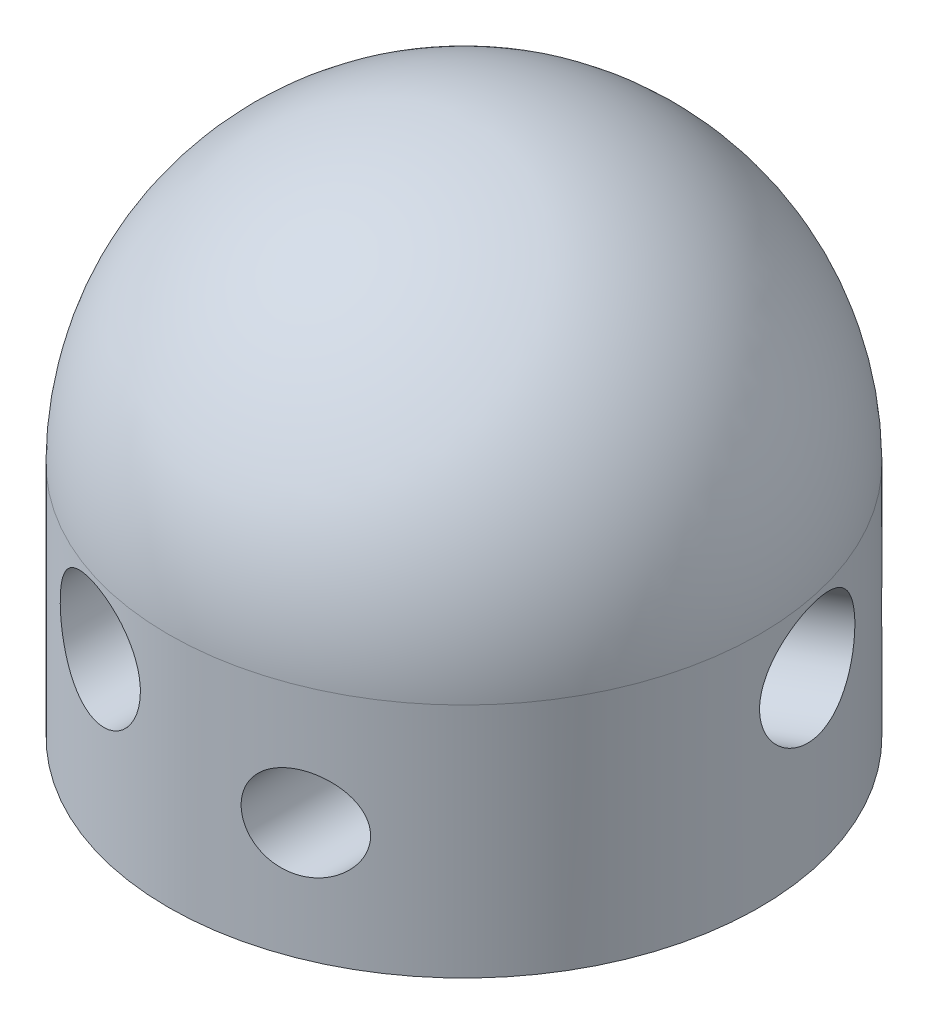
ISO-10303-21;
HEADER;
FILE_DESCRIPTION(('STEP AP214'),'2;1');
FILE_NAME('part.step','',(''),(''),'','','');
FILE_SCHEMA(('AUTOMOTIVE_DESIGN { 1 0 10303 214 1 1 1 1 }'));
ENDSEC;
DATA;
#1=APPLICATION_CONTEXT('core data for automotive mechanical design processes');
#2=APPLICATION_PROTOCOL_DEFINITION('international standard','automotive_design',2000,#1);
#3=PRODUCT_CONTEXT('',#1,'mechanical');
#4=PRODUCT('Part','Part','',(#3));
#5=PRODUCT_RELATED_PRODUCT_CATEGORY('part','',(#4));
#6=PRODUCT_DEFINITION_FORMATION('','',#4);
#7=PRODUCT_DEFINITION_CONTEXT('part definition',#1,'design');
#8=PRODUCT_DEFINITION('design','',#6,#7);
#9=PRODUCT_DEFINITION_SHAPE('','',#8);
#10=(LENGTH_UNIT() NAMED_UNIT(*) SI_UNIT(.MILLI.,.METRE.));
#11=(NAMED_UNIT(*) PLANE_ANGLE_UNIT() SI_UNIT($,.RADIAN.));
#12=(NAMED_UNIT(*) SI_UNIT($,.STERADIAN.) SOLID_ANGLE_UNIT());
#13=UNCERTAINTY_MEASURE_WITH_UNIT(LENGTH_MEASURE(1.E-05),#10,'distance_accuracy_value','');
#14=(GEOMETRIC_REPRESENTATION_CONTEXT(3) GLOBAL_UNCERTAINTY_ASSIGNED_CONTEXT((#13)) GLOBAL_UNIT_ASSIGNED_CONTEXT((#10,
#11,#12)) REPRESENTATION_CONTEXT('',''));
#15=CARTESIAN_POINT('',(0.,0.,0.));
#16=DIRECTION('',(0.,0.,1.));
#17=DIRECTION('',(1.,0.,0.));
#18=AXIS2_PLACEMENT_3D('',#15,#16,#17);
#19=CARTESIAN_POINT('',(0.,40.,0.));
#20=DIRECTION('',(0.,1.,0.));
#21=DIRECTION('',(1.,0.,0.));
#22=AXIS2_PLACEMENT_3D('',#19,#20,#21);
#23=SPHERICAL_SURFACE('',#22,50.);
#24=CARTESIAN_POINT('',(0.,40.,0.));
#25=DIRECTION('',(0.,1.,0.));
#26=DIRECTION('',(0.,0.,1.));
#27=AXIS2_PLACEMENT_3D('',#24,#25,#26);
#28=CIRCLE('',#27,50.);
#29=CARTESIAN_POINT('',(0.,40.,50.));
#30=VERTEX_POINT('',#29);
#31=EDGE_CURVE('E219',#30,#30,#28,.T.);
#32=ORIENTED_EDGE('',*,*,#31,.T.);
#33=EDGE_LOOP('',(#32));
#34=FACE_BOUND('',#33,.T.);
#35=ADVANCED_FACE('F48',(#34),#23,.T.);
#36=CARTESIAN_POINT('',(0.,0.,0.));
#37=DIRECTION('',(0.,1.,0.));
#38=DIRECTION('',(0.,0.,1.));
#39=AXIS2_PLACEMENT_3D('',#36,#37,#38);
#40=PLANE('',#39);
#41=CARTESIAN_POINT('',(36.7905388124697,0.,-3.93144424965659));
#42=DIRECTION('',(0.,-1.,0.));
#43=DIRECTION('',(0.,0.,-1.));
#44=AXIS2_PLACEMENT_3D('',#41,#42,#43);
#45=CIRCLE('',#44,3.39999999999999);
#46=CARTESIAN_POINT('',(36.7905388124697,0.,-7.33144424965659));
#47=VERTEX_POINT('',#46);
#48=EDGE_CURVE('E204',#47,#47,#45,.T.);
#49=ORIENTED_EDGE('',*,*,#48,.F.);
#50=EDGE_LOOP('',(#49));
#51=FACE_BOUND('',#50,.T.);
#52=CARTESIAN_POINT('',(-21.7999999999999,0.,-29.8958191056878));
#53=DIRECTION('',(0.,-1.,0.));
#54=DIRECTION('',(0.,0.,-1.));
#55=AXIS2_PLACEMENT_3D('',#52,#53,#54);
#56=CIRCLE('',#55,3.39999999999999);
#57=CARTESIAN_POINT('',(-21.7999999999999,0.,-33.2958191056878));
#58=VERTEX_POINT('',#57);
#59=EDGE_CURVE('E210',#58,#58,#56,.T.);
#60=ORIENTED_EDGE('',*,*,#59,.F.);
#61=EDGE_LOOP('',(#60));
#62=FACE_BOUND('',#61,.T.);
#63=CARTESIAN_POINT('',(-14.9905388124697,0.,33.8272633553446));
#64=DIRECTION('',(0.,-1.,0.));
#65=DIRECTION('',(0.,0.,-1.));
#66=AXIS2_PLACEMENT_3D('',#63,#64,#65);
#67=CIRCLE('',#66,3.39999999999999);
#68=CARTESIAN_POINT('',(-14.9905388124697,0.,30.4272633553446));
#69=VERTEX_POINT('',#68);
#70=EDGE_CURVE('E216',#69,#69,#67,.T.);
#71=ORIENTED_EDGE('',*,*,#70,.F.);
#72=EDGE_LOOP('',(#71));
#73=FACE_BOUND('',#72,.T.);
#74=CARTESIAN_POINT('',(0.,0.,0.));
#75=DIRECTION('',(0.,1.,0.));
#76=DIRECTION('',(0.,0.,1.));
#77=AXIS2_PLACEMENT_3D('',#74,#75,#76);
#78=CIRCLE('',#77,50.);
#79=CARTESIAN_POINT('',(0.,0.,50.));
#80=VERTEX_POINT('',#79);
#81=EDGE_CURVE('E61',#80,#80,#78,.T.);
#82=ORIENTED_EDGE('',*,*,#81,.F.);
#83=EDGE_LOOP('',(#82));
#84=FACE_BOUND('',#83,.T.);
#85=ADVANCED_FACE('F226',(#51,#62,#73,#84),#40,.F.);
#86=CARTESIAN_POINT('',(0.,166.45875235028,0.));
#87=DIRECTION('',(0.,1.,0.));
#88=DIRECTION('',(0.,0.,1.));
#89=AXIS2_PLACEMENT_3D('',#86,#87,#88);
#90=CYLINDRICAL_SURFACE('',#89,50.);
#91=CARTESIAN_POINT('',(-49.9665520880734,19.941333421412,1.82857114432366));
#92=CARTESIAN_POINT('',(-49.9665513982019,19.7456796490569,1.82857525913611));
#93=CARTESIAN_POINT('',(-49.9668744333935,19.5500598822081,1.81982184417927));
#94=CARTESIAN_POINT('',(-49.9681322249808,19.160310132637,1.78495889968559));
#95=CARTESIAN_POINT('',(-49.9690671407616,18.9661805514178,1.75884484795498));
#96=CARTESIAN_POINT('',(-49.9714547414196,18.5808206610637,1.689645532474));
#97=CARTESIAN_POINT('',(-49.9729078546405,18.3895928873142,1.64654622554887));
#98=CARTESIAN_POINT('',(-49.9761805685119,18.0114946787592,1.54402165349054));
#99=CARTESIAN_POINT('',(-49.978000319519,17.8246260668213,1.48458968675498));
#100=CARTESIAN_POINT('',(-49.9818006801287,17.4574284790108,1.35057949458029));
#101=CARTESIAN_POINT('',(-49.9837804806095,17.2770725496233,1.27607490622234));
#102=CARTESIAN_POINT('',(-49.9876846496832,16.9229324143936,1.11268203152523));
#103=CARTESIAN_POINT('',(-49.9896089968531,16.749150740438,1.02378827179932));
#104=CARTESIAN_POINT('',(-49.9931568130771,16.4091476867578,0.832697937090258));
#105=CARTESIAN_POINT('',(-49.9947803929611,16.2429235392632,0.730506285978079));
#106=CARTESIAN_POINT('',(-49.9974772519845,15.9186450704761,0.513845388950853));
#107=CARTESIAN_POINT('',(-49.9985503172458,15.7605939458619,0.399371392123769));
#108=CARTESIAN_POINT('',(-50.0006538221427,15.2779968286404,0.0221706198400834));
#109=CARTESIAN_POINT('',(-50.0002419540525,14.9689844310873,-0.260832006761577));
#110=CARTESIAN_POINT('',(-49.9933806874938,14.3955567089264,-0.868517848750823));
#111=CARTESIAN_POINT('',(-49.9869285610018,14.131161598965,-1.19321984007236));
#112=CARTESIAN_POINT('',(-49.964483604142,13.615670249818,-1.92406716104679));
#113=CARTESIAN_POINT('',(-49.9472712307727,13.3717349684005,-2.33523718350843));
#114=CARTESIAN_POINT('',(-49.8999966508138,12.9492100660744,-3.18953397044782));
#115=CARTESIAN_POINT('',(-49.8699275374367,12.7706556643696,-3.63267780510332));
#116=CARTESIAN_POINT('',(-49.8126099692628,12.548593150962,-4.33188422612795));
#117=CARTESIAN_POINT('',(-49.7903556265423,12.4806635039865,-4.58086408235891));
#118=CARTESIAN_POINT('',(-49.7415814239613,12.3657048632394,-5.08316753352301));
#119=CARTESIAN_POINT('',(-49.7150629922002,12.3186688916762,-5.33648964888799));
#120=CARTESIAN_POINT('',(-49.6577493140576,12.2460289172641,-5.84582560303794));
#121=CARTESIAN_POINT('',(-49.6269520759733,12.2204349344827,-6.10184064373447));
#122=CARTESIAN_POINT('',(-49.5612269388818,12.1912306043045,-6.61449309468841));
#123=CARTESIAN_POINT('',(-49.5263008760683,12.1876105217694,-6.87113017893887));
#124=CARTESIAN_POINT('',(-49.452849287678,12.2027087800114,-7.38116216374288));
#125=CARTESIAN_POINT('',(-49.4143544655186,12.221250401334,-7.63456664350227));
#126=CARTESIAN_POINT('',(-49.3339277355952,12.280681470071,-8.13809205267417));
#127=CARTESIAN_POINT('',(-49.2919973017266,12.3215613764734,-8.38821433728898));
#128=CARTESIAN_POINT('',(-49.2052034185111,12.4258160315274,-8.88319123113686));
#129=CARTESIAN_POINT('',(-49.1603402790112,12.4891884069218,-9.12804639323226));
#130=CARTESIAN_POINT('',(-49.0683291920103,12.6383875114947,-9.61037653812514));
#131=CARTESIAN_POINT('',(-49.0211814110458,12.7242126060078,-9.84785205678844));
#132=CARTESIAN_POINT('',(-48.9285824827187,12.9115574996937,-10.2977182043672));
#133=CARTESIAN_POINT('',(-48.8832282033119,13.0116469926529,-10.5107250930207));
#134=CARTESIAN_POINT('',(-48.7919370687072,13.2306894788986,-10.9266742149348));
#135=CARTESIAN_POINT('',(-48.746000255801,13.3496411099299,-11.129617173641));
#136=CARTESIAN_POINT('',(-48.654351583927,13.6057137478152,-11.523670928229));
#137=CARTESIAN_POINT('',(-48.6086396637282,13.7428294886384,-11.7147851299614));
#138=CARTESIAN_POINT('',(-48.5182736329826,14.0343702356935,-12.0835911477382));
#139=CARTESIAN_POINT('',(-48.4736194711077,14.1887943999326,-12.2612836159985));
#140=CARTESIAN_POINT('',(-48.3890629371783,14.5033339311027,-12.5906958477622));
#141=CARTESIAN_POINT('',(-48.3490399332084,14.6624375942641,-12.7433518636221));
#142=CARTESIAN_POINT('',(-48.2713913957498,14.993738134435,-13.0343953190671));
#143=CARTESIAN_POINT('',(-48.2337657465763,15.1659343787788,-13.1727834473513));
#144=CARTESIAN_POINT('',(-48.1616054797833,15.5221695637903,-13.4342157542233));
#145=CARTESIAN_POINT('',(-48.127070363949,15.7062065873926,-13.5572624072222));
#146=CARTESIAN_POINT('',(-48.0617313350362,16.0847922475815,-13.7871049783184));
#147=CARTESIAN_POINT('',(-48.0309273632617,16.2793407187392,-13.8939011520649));
#148=CARTESIAN_POINT('',(-47.9746520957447,16.6704264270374,-14.0869624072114));
#149=CARTESIAN_POINT('',(-47.9490306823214,16.8666497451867,-14.1738202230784));
#150=CARTESIAN_POINT('',(-47.9022663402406,17.2660997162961,-14.3310716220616));
#151=CARTESIAN_POINT('',(-47.8811232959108,17.4693261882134,-14.4014656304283));
#152=CARTESIAN_POINT('',(-47.8437001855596,17.8813000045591,-14.5253069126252));
#153=CARTESIAN_POINT('',(-47.8274197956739,18.0900469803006,-14.5787553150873));
#154=CARTESIAN_POINT('',(-47.8000172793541,18.5115546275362,-14.6683518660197));
#155=CARTESIAN_POINT('',(-47.7888951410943,18.7243152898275,-14.7045000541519));
#156=CARTESIAN_POINT('',(-47.7721242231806,19.1494697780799,-14.7588938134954));
#157=CARTESIAN_POINT('',(-47.7664052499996,19.3618314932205,-14.7773690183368));
#158=CARTESIAN_POINT('',(-47.760290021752,19.7875036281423,-14.7971215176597));
#159=CARTESIAN_POINT('',(-47.7598955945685,20.0008143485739,-14.7983929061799));
#160=CARTESIAN_POINT('',(-47.764440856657,20.4267416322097,-14.7837156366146));
#161=CARTESIAN_POINT('',(-47.7693794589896,20.6393583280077,-14.7677704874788));
#162=CARTESIAN_POINT('',(-47.7845006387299,21.0624226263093,-14.7187687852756));
#163=CARTESIAN_POINT('',(-47.7946832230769,21.272870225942,-14.6857122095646));
#164=CARTESIAN_POINT('',(-47.8200762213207,21.6895343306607,-14.6028141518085));
#165=CARTESIAN_POINT('',(-47.8352730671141,21.8957606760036,-14.5530179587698));
#166=CARTESIAN_POINT('',(-47.8704329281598,22.3031099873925,-14.4369430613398));
#167=CARTESIAN_POINT('',(-47.8903960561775,22.5042328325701,-14.3706639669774));
#168=CARTESIAN_POINT('',(-47.9347363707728,22.8999527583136,-14.2220623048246));
#169=CARTESIAN_POINT('',(-47.9591134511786,23.0945499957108,-14.1397401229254));
#170=CARTESIAN_POINT('',(-48.0118558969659,23.4758664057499,-13.9596022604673));
#171=CARTESIAN_POINT('',(-48.0402211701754,23.6625857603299,-13.8617869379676));
#172=CARTESIAN_POINT('',(-48.1005572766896,24.0275142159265,-13.6509504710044));
#173=CARTESIAN_POINT('',(-48.1325404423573,24.2056910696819,-13.5378770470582));
#174=CARTESIAN_POINT('',(-48.1994845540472,24.5516290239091,-13.2975651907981));
#175=CARTESIAN_POINT('',(-48.2344455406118,24.7193899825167,-13.1703265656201));
#176=CARTESIAN_POINT('',(-48.3067651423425,25.04342258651,-12.9025451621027));
#177=CARTESIAN_POINT('',(-48.3441241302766,25.1996924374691,-12.7620003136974));
#178=CARTESIAN_POINT('',(-48.4206129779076,25.4996866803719,-12.4686487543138));
#179=CARTESIAN_POINT('',(-48.4597422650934,25.6434150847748,-12.3158459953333));
#180=CARTESIAN_POINT('',(-48.5397402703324,25.9195161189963,-11.9967102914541));
#181=CARTESIAN_POINT('',(-48.5806259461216,26.0516948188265,-11.8302138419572));
#182=CARTESIAN_POINT('',(-48.6629610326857,26.3015873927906,-11.4868355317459));
#183=CARTESIAN_POINT('',(-48.7044104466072,26.4193011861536,-11.309953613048));
#184=CARTESIAN_POINT('',(-48.7872573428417,26.6396638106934,-10.9470612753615));
#185=CARTESIAN_POINT('',(-48.8286548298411,26.7423141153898,-10.7610517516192));
#186=CARTESIAN_POINT('',(-48.9108431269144,26.9321578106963,-10.3810990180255));
#187=CARTESIAN_POINT('',(-48.9516337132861,27.0193456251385,-10.18715297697));
#188=CARTESIAN_POINT('',(-49.0334679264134,27.1806813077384,-9.78582639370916));
#189=CARTESIAN_POINT('',(-49.0744711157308,27.2542709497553,-9.57821320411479));
#190=CARTESIAN_POINT('',(-49.1547522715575,27.3843847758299,-9.15730581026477));
#191=CARTESIAN_POINT('',(-49.1940295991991,27.4409026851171,-8.94400954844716));
#192=CARTESIAN_POINT('',(-49.2703998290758,27.5367945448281,-8.51325648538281));
#193=CARTESIAN_POINT('',(-49.3074930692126,27.576171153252,-8.29580033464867));
#194=CARTESIAN_POINT('',(-49.3791564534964,27.6378875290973,-7.85799816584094));
#195=CARTESIAN_POINT('',(-49.4137256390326,27.6602208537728,-7.63765108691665));
#196=CARTESIAN_POINT('',(-49.482038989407,27.6888392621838,-7.1821976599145));
#197=CARTESIAN_POINT('',(-49.5156090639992,27.6940805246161,-6.94699933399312));
#198=CARTESIAN_POINT('',(-49.5793581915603,27.6858964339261,-6.47639310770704));
#199=CARTESIAN_POINT('',(-49.609535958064,27.6724640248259,-6.24098516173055));
#200=CARTESIAN_POINT('',(-49.6663420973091,27.6272885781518,-5.77150984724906));
#201=CARTESIAN_POINT('',(-49.6929707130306,27.595546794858,-5.53744238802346));
#202=CARTESIAN_POINT('',(-49.7426324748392,27.5141739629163,-5.07202596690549));
#203=CARTESIAN_POINT('',(-49.765664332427,27.4645365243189,-4.84067800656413));
#204=CARTESIAN_POINT('',(-49.8322343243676,27.2815008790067,-4.12178951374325));
#205=CARTESIAN_POINT('',(-49.8694096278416,27.1169486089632,-3.64122138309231));
#206=CARTESIAN_POINT('',(-49.9285856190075,26.7122548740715,-2.71174209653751));
#207=CARTESIAN_POINT('',(-49.9505796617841,26.4720803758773,-2.26284488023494));
#208=CARTESIAN_POINT('',(-49.9742885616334,26.0551139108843,-1.61825887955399));
#209=CARTESIAN_POINT('',(-49.9806638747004,25.9042960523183,-1.40559212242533));
#210=CARTESIAN_POINT('',(-49.9905353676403,25.5846004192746,-0.994266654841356));
#211=CARTESIAN_POINT('',(-49.9940327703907,25.4157303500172,-0.795602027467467));
#212=CARTESIAN_POINT('',(-49.9986474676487,25.0605903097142,-0.414314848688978));
#213=CARTESIAN_POINT('',(-49.9997639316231,24.8743142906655,-0.231697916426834));
#214=CARTESIAN_POINT('',(-50.0001681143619,24.485326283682,0.115118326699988));
#215=CARTESIAN_POINT('',(-49.9994560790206,24.2826165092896,0.279320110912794));
#216=CARTESIAN_POINT('',(-49.9968892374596,23.8772361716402,0.575691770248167));
#217=CARTESIAN_POINT('',(-49.9951212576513,23.6756337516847,0.709322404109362));
#218=CARTESIAN_POINT('',(-49.9910007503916,23.2605647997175,0.956632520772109));
#219=CARTESIAN_POINT('',(-49.9886483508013,23.0471008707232,1.0703163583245));
#220=CARTESIAN_POINT('',(-49.9838330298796,22.6103902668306,1.27552390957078));
#221=CARTESIAN_POINT('',(-49.9813703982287,22.387169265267,1.36710207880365));
#222=CARTESIAN_POINT('',(-49.9767532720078,21.9325423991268,1.52660011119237));
#223=CARTESIAN_POINT('',(-49.9745986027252,21.7011412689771,1.59453342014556));
#224=CARTESIAN_POINT('',(-49.9708225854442,21.217092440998,1.7089193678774));
#225=CARTESIAN_POINT('',(-49.9692451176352,20.9640425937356,1.75368461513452));
#226=CARTESIAN_POINT('',(-49.9671103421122,20.4544200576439,1.81350719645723));
#227=CARTESIAN_POINT('',(-49.9665529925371,20.1978475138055,1.82856574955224));
#228=CARTESIAN_POINT('',(-49.9665520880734,19.941333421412,1.82857114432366));
#229=B_SPLINE_CURVE_WITH_KNOTS('',3,(#91,#92,#93,#94,#95,#96,#97,#98,#99,#100,#101,#102,#103,
#104,#105,#106,#107,#108,#109,#110,#111,#112,#113,#114,#115,#116,#117,#118,#119,#120,#121,#122,
#123,#124,#125,#126,#127,#128,#129,#130,#131,#132,#133,#134,#135,#136,#137,#138,#139,#140,#141,
#142,#143,#144,#145,#146,#147,#148,#149,#150,#151,#152,#153,#154,#155,#156,#157,#158,#159,#160,
#161,#162,#163,#164,#165,#166,#167,#168,#169,#170,#171,#172,#173,#174,#175,#176,#177,#178,#179,
#180,#181,#182,#183,#184,#185,#186,#187,#188,#189,#190,#191,#192,#193,#194,#195,#196,#197,#198,
#199,#200,#201,#202,#203,#204,#205,#206,#207,#208,#209,#210,#211,#212,#213,#214,#215,#216,#217,
#218,#219,#220,#221,#222,#223,#224,#225,#226,#227,#228),.UNSPECIFIED.,.T.,.F.,(4,2,2,2,2,2,2,2,
2,2,2,2,2,2,2,2,2,2,2,2,2,2,2,2,2,2,2,2,2,2,2,2,2,2,2,2,2,2,2,2,2,2,2,2,2,2,2,2,2,2,2,2,2,2,2,2,
2,2,2,2,2,2,2,2,2,2,2,2,4),(0.,0.58670812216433,1.17356913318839,1.76091637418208,
2.3485049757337,2.93328938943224,3.51829676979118,4.10308814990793,4.68810655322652,
5.93984823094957,7.19215551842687,8.62145645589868,10.051526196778,10.8278657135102,
11.6039457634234,12.3803882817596,13.1564867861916,13.926437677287,14.6960599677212,
15.465601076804,16.2350861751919,16.9532000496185,17.6712620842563,18.3891163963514,
19.1069358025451,19.7783948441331,20.4498214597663,21.1211396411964,21.7924472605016,
22.4400026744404,23.0875413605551,23.7350369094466,24.382530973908,25.0214927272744,
25.6606738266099,26.2997246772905,26.9387763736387,27.5761128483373,28.2134644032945,
28.8508006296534,29.4881221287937,30.1276855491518,30.767257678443,31.406929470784,
32.046395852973,32.6950954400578,33.3437986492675,33.9924383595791,34.6413115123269,
35.3127263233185,35.984387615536,36.6559447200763,37.3277555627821,38.0398939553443,
38.7523015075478,39.4646602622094,40.1772736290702,41.6979679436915,43.2193274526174,
44.0008612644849,44.7820628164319,45.5635368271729,46.3449057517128,47.0694794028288,
47.7938946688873,48.5165067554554,49.2387072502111,50.0079491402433,50.7771594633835),.UNSPECIFIED.);
#230=CARTESIAN_POINT('',(-49.9665520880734,19.941333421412,1.82857114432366));
#231=VERTEX_POINT('',#230);
#232=EDGE_CURVE('E51',#231,#231,#229,.T.);
#233=ORIENTED_EDGE('',*,*,#232,.T.);
#234=EDGE_LOOP('',(#233));
#235=FACE_BOUND('',#234,.T.);
#236=CARTESIAN_POINT('',(23.3996869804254,19.941333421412,-44.1865890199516));
#237=CARTESIAN_POINT('',(23.3996830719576,19.7456796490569,-44.1865904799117));
#238=CARTESIAN_POINT('',(23.4074252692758,19.5500598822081,-44.1824935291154));
#239=CARTESIAN_POINT('',(23.4382463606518,19.160310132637,-44.1661513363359));
#240=CARTESIAN_POINT('',(23.4613292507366,18.9661805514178,-44.1539039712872));
#241=CARTESIAN_POINT('',(23.5224514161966,18.5808206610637,-44.1213720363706));
#242=CARTESIAN_POINT('',(23.5605030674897,18.3895928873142,-44.1010808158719));
#243=CARTESIAN_POINT('',(23.6509283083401,18.0114946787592,-44.0526527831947));
#244=CARTESIAN_POINT('',(23.7033077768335,17.8246260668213,-44.0245127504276));
#245=CARTESIAN_POINT('',(23.8212641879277,17.4574284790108,-43.9607988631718));
#246=CARTESIAN_POINT('',(23.8867769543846,17.2770725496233,-43.9252611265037));
#247=CARTESIAN_POINT('',(24.0302314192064,16.9229324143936,-43.8469457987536));
#248=CARTESIAN_POINT('',(24.1081778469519,16.749150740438,-43.8041654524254));
#249=CARTESIAN_POINT('',(24.2754408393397,16.4091476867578,-43.7116927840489));
#250=CARTESIAN_POINT('',(24.3647531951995,16.2429235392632,-43.6620030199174));
#251=CARTESIAN_POINT('',(24.5537354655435,15.9186450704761,-43.5560081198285));
#252=CARTESIAN_POINT('',(24.6534093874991,15.7605939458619,-43.4997004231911));
#253=CARTESIAN_POINT('',(24.9811265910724,15.2779968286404,-43.312921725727));
#254=CARTESIAN_POINT('',(25.226008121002,14.9689844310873,-43.171063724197));
#255=CARTESIAN_POINT('',(25.7488488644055,14.3955567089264,-42.8612787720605));
#256=CARTESIAN_POINT('',(26.0268229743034,14.131161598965,-42.6933400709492));
#257=CARTESIAN_POINT('',(26.6485328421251,13.615670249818,-42.3084785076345));
#258=CARTESIAN_POINT('',(26.9960103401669,13.3717349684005,-42.0879871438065));
#259=CARTESIAN_POINT('',(27.7122157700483,12.9492100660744,-41.6198977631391));
#260=CARTESIAN_POINT('',(28.0809550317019,12.7706556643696,-41.3722852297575));
#261=CARTESIAN_POINT('',(28.6578267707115,12.548593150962,-40.9730435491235));
#262=CARTESIAN_POINT('',(28.8623224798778,12.4806635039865,-40.8292807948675));
#263=CARTESIAN_POINT('',(29.272942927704,12.3657048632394,-40.535889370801));
#264=CARTESIAN_POINT('',(29.47906709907,12.3186688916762,-40.3862626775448));
#265=CARTESIAN_POINT('',(29.8915081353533,12.2460289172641,-40.0819595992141));
#266=CARTESIAN_POINT('',(30.0978250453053,12.2204349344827,-39.9272808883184));
#267=CARTESIAN_POINT('',(30.508932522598,12.1912306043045,-39.6140350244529));
#268=CARTESIAN_POINT('',(30.7137237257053,12.1876105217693,-39.4554696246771));
#269=CARTESIAN_POINT('',(31.118698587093,12.2027087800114,-39.1368426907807));
#270=CARTESIAN_POINT('',(31.3189058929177,12.221250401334,-38.9768029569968));
#271=CARTESIAN_POINT('',(31.7147583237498,12.280681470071,-38.6553886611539));
#272=CARTESIAN_POINT('',(31.9104053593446,12.3215613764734,-38.4940146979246));
#273=CARTESIAN_POINT('',(32.2956709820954,12.4258160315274,-38.1713605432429));
#274=CARTESIAN_POINT('',(32.4852902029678,12.4891884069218,-38.0100803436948));
#275=CARTESIAN_POINT('',(32.8569948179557,12.6383875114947,-37.6892313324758));
#276=CARTESIAN_POINT('',(33.0390807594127,12.7242126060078,-37.5296623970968));
#277=CARTESIAN_POINT('',(33.382376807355,12.9115574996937,-37.2245362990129));
#278=CARTESIAN_POINT('',(33.5441690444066,13.0116469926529,-37.0787548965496));
#279=CARTESIAN_POINT('',(33.8587459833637,13.2306894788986,-36.7917198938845));
#280=CARTESIAN_POINT('',(34.0115313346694,13.3496411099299,-36.6504659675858));
#281=CARTESIAN_POINT('',(34.3069675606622,13.6057137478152,-36.3740690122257));
#282=CARTESIAN_POINT('',(34.4496213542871,13.7428294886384,-36.2389242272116));
#283=CARTESIAN_POINT('',(34.7238337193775,14.0343702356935,-35.9762619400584));
#284=CARTESIAN_POINT('',(34.8553928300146,14.1887943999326,-35.8487440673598));
#285=CARTESIAN_POINT('',(35.0983939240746,14.5033339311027,-35.6108098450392));
#286=CARTESIAN_POINT('',(35.2105864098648,14.6624375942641,-35.4998208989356));
#287=CARTESIAN_POINT('',(35.4238131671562,14.993738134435,-35.2870535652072));
#288=CARTESIAN_POINT('',(35.5248479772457,15.1659343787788,-35.185274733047));
#289=CARTESIAN_POINT('',(35.7151748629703,15.5221695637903,-34.9920659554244));
#290=CARTESIAN_POINT('',(35.8044688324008,15.7062065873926,-34.9006343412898));
#291=CARTESIAN_POINT('',(35.9708488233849,16.0847922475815,-34.7291277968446));
#292=CARTESIAN_POINT('',(36.0479350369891,16.2793407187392,-34.6490526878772));
#293=CARTESIAN_POINT('',(36.186993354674,16.6704264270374,-34.5037862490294));
#294=CARTESIAN_POINT('',(36.2494037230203,16.8666497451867,-34.4381685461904));
#295=CARTESIAN_POINT('',(36.36220525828,17.2660997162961,-34.3190437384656));
#296=CARTESIAN_POINT('',(36.4125967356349,17.4693261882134,-34.2655363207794));
#297=CARTESIAN_POINT('',(36.5011348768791,17.8813000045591,-34.1712063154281));
#298=CARTESIAN_POINT('',(36.5392823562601,18.0900469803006,-34.1303828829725));
#299=CARTESIAN_POINT('',(36.6031739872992,18.5115546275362,-34.0618533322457));
#300=CARTESIAN_POINT('',(36.6289181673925,18.7243152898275,-34.0341471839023));
#301=CARTESIAN_POINT('',(36.6676390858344,19.1494697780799,-33.9924262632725));
#302=CARTESIAN_POINT('',(36.6807795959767,19.3618314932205,-33.9782358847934));
#303=CARTESIAN_POINT('',(36.6948281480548,19.7875036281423,-33.9630636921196));
#304=CARTESIAN_POINT('',(36.6957319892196,20.0008143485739,-33.9620864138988));
#305=CARTESIAN_POINT('',(36.6852937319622,20.4267416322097,-33.9733613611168));
#306=CARTESIAN_POINT('',(36.6739541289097,20.6393583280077,-33.985610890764));
#307=CARTESIAN_POINT('',(36.6390779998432,21.0624226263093,-34.0232070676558));
#308=CARTESIAN_POINT('',(36.6155414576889,21.272870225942,-34.048553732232));
#309=CARTESIAN_POINT('',(36.5564461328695,21.6895343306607,-34.1119937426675));
#310=CARTESIAN_POINT('',(36.520919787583,21.8957606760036,-34.1500526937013));
#311=CARTESIAN_POINT('',(36.4379759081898,22.3031099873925,-34.2385394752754));
#312=CARTESIAN_POINT('',(36.390558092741,22.5042328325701,-34.288967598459));
#313=CARTESIAN_POINT('',(36.2840354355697,22.8999527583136,-34.4016682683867));
#314=CARTESIAN_POINT('',(36.224930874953,23.0945499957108,-34.4639405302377));
#315=CARTESIAN_POINT('',(36.0952981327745,23.4758664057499,-34.5996857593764));
#316=CARTESIAN_POINT('',(36.0247702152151,23.6625857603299,-34.6731584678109));
#317=CARTESIAN_POINT('',(35.8723485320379,24.0275142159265,-34.8308293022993));
#318=CARTESIAN_POINT('',(35.7904156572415,24.2056910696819,-34.915064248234));
#319=CARTESIAN_POINT('',(35.6157715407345,24.5516290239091,-35.0931954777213));
#320=CARTESIAN_POINT('',(35.5230601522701,24.7193899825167,-35.1870918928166));
#321=CARTESIAN_POINT('',(35.3273144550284,25.04342258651,-35.3836132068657));
#322=CARTESIAN_POINT('',(35.2242785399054,25.1996924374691,-35.4862394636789));
#323=CARTESIAN_POINT('',(35.0084730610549,25.4996866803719,-35.6991565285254));
#324=CARTESIAN_POINT('',(34.8957066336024,25.6434150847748,-35.8094448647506));
#325=CARTESIAN_POINT('',(34.6593260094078,25.9195161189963,-36.0382930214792));
#326=CARTESIAN_POINT('',(34.5355786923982,26.0516948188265,-36.156949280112));
#327=CARTESIAN_POINT('',(34.2793718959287,26.3015873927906,-36.399942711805));
#328=CARTESIAN_POINT('',(34.1469123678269,26.4193011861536,-36.5242799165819));
#329=CARTESIAN_POINT('',(33.8740618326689,26.6396638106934,-36.7774736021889));
#330=CARTESIAN_POINT('',(33.7336716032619,26.7423141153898,-36.9063296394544));
#331=CARTESIAN_POINT('',(33.4457170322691,26.9321578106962,-37.1674831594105));
#332=CARTESIAN_POINT('',(33.2981501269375,27.0193456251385,-37.2997818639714));
#333=CARTESIAN_POINT('',(32.9915082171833,27.1806813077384,-37.5713156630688));
#334=CARTESIAN_POINT('',(32.8322115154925,27.2542709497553,-37.710632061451));
#335=CARTESIAN_POINT('',(32.5078355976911,27.3843847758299,-37.9906112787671));
#336=CARTESIAN_POINT('',(32.3427542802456,27.4409026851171,-38.1312745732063));
#337=CARTESIAN_POINT('',(32.0078962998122,27.5367945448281,-38.4127896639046));
#338=CARTESIAN_POINT('',(31.8381203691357,27.576171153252,-38.5536414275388));
#339=CARTESIAN_POINT('',(31.4948042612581,27.6378875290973,-38.8346048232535));
#340=CARTESIAN_POINT('',(31.3212626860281,27.6602208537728,-38.9747161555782));
#341=CARTESIAN_POINT('',(30.9609851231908,27.6888392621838,-39.2616039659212));
#342=CARTESIAN_POINT('',(30.7740824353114,27.6940805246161,-39.4082756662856));
#343=CARTESIAN_POINT('',(30.3984000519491,27.6858964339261,-39.6987871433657));
#344=CARTESIAN_POINT('',(30.2096196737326,27.6724640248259,-39.8426258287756));
#345=CARTESIAN_POINT('',(29.8314451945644,27.6272885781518,-40.1265590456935));
#346=CARTESIAN_POINT('',(29.6420511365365,27.595546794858,-40.2666538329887));
#347=CARTESIAN_POINT('',(29.2638195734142,27.5141739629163,-40.5423703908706));
#348=CARTESIAN_POINT('',(29.0749822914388,27.4645365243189,-40.6779905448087));
#349=CARTESIAN_POINT('',(28.4856915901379,27.2815008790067,-41.0950860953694));
#350=CARTESIAN_POINT('',(28.088095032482,27.1169486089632,-41.3675649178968));
#351=CARTESIAN_POINT('',(27.3127303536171,26.7122548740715,-41.883552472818));
#352=CARTESIAN_POINT('',(26.9349709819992,26.4720803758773,-42.1270484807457));
#353=CARTESIAN_POINT('',(26.3885975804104,26.0551139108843,-42.4698739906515));
#354=CARTESIAN_POINT('',(26.20761042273,25.9042960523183,-42.5817285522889));
#355=CARTESIAN_POINT('',(25.8563278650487,25.5846004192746,-42.7959402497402));
#356=CARTESIAN_POINT('',(25.6860279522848,25.4157303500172,-42.8983014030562));
#357=CARTESIAN_POINT('',(25.3581309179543,25.0605903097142,-43.0929414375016));
#358=CARTESIAN_POINT('',(25.2005382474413,24.8743142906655,-43.185216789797));
#359=CARTESIAN_POINT('',(24.9003886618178,24.485326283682,-43.35897494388));
#360=CARTESIAN_POINT('',(24.7578297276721,24.2826165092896,-43.4404591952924));
#361=CARTESIAN_POINT('',(24.4998809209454,23.8772361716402,-43.5864220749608));
#362=CARTESIAN_POINT('',(24.3832694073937,23.6756337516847,-43.651706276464));
#363=CARTESIAN_POINT('',(24.167032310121,23.2605647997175,-43.771792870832));
#364=CARTESIAN_POINT('',(24.0674030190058,23.0471008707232,-43.8265975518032));
#365=CARTESIAN_POINT('',(23.8872804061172,22.6103902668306,-43.9250311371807));
#366=CARTESIAN_POINT('',(23.8067400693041,22.387169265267,-43.9686875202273));
#367=CARTESIAN_POINT('',(23.6663021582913,21.9325423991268,-44.0444379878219));
#368=CARTESIAN_POINT('',(23.6063928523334,21.7011412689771,-44.076538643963));
#369=CARTESIAN_POINT('',(23.5054437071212,21.217092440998,-44.1304614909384));
#370=CARTESIAN_POINT('',(23.4658871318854,20.9640425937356,-44.1514779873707));
#371=CARTESIAN_POINT('',(23.4130118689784,20.4544200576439,-44.1795405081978));
#372=CARTESIAN_POINT('',(23.3996921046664,20.1978475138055,-44.1865871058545));
#373=CARTESIAN_POINT('',(23.3996869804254,19.941333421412,-44.1865890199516));
#374=B_SPLINE_CURVE_WITH_KNOTS('',3,(#236,#237,#238,#239,#240,#241,#242,#243,#244,#245,#246,
#247,#248,#249,#250,#251,#252,#253,#254,#255,#256,#257,#258,#259,#260,#261,#262,#263,#264,#265,
#266,#267,#268,#269,#270,#271,#272,#273,#274,#275,#276,#277,#278,#279,#280,#281,#282,#283,#284,
#285,#286,#287,#288,#289,#290,#291,#292,#293,#294,#295,#296,#297,#298,#299,#300,#301,#302,#303,
#304,#305,#306,#307,#308,#309,#310,#311,#312,#313,#314,#315,#316,#317,#318,#319,#320,#321,#322,
#323,#324,#325,#326,#327,#328,#329,#330,#331,#332,#333,#334,#335,#336,#337,#338,#339,#340,#341,
#342,#343,#344,#345,#346,#347,#348,#349,#350,#351,#352,#353,#354,#355,#356,#357,#358,#359,#360,
#361,#362,#363,#364,#365,#366,#367,#368,#369,#370,#371,#372,#373),.UNSPECIFIED.,.T.,.F.,(4,2,2,
2,2,2,2,2,2,2,2,2,2,2,2,2,2,2,2,2,2,2,2,2,2,2,2,2,2,2,2,2,2,2,2,2,2,2,2,2,2,2,2,2,2,2,2,2,2,2,2,
2,2,2,2,2,2,2,2,2,2,2,2,2,2,2,2,2,4),(0.,0.586708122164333,1.17356913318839,1.76091637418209,
2.3485049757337,2.93328938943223,3.51829676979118,4.10308814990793,4.68810655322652,
5.93984823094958,7.19215551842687,8.62145645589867,10.051526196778,10.8278657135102,
11.6039457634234,12.3803882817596,13.1564867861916,13.926437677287,14.6960599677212,
15.465601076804,16.2350861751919,16.9532000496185,17.6712620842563,18.3891163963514,
19.1069358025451,19.7783948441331,20.4498214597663,21.1211396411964,21.7924472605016,
22.4400026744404,23.0875413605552,23.7350369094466,24.382530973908,25.0214927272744,
25.6606738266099,26.2997246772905,26.9387763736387,27.5761128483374,28.2134644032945,
28.8508006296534,29.4881221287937,30.1276855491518,30.767257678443,31.406929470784,
32.046395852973,32.6950954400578,33.3437986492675,33.9924383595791,34.6413115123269,
35.3127263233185,35.9843876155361,36.6559447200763,37.3277555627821,38.0398939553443,
38.7523015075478,39.4646602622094,40.1772736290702,41.6979679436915,43.2193274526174,
44.0008612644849,44.7820628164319,45.5635368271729,46.3449057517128,47.0694794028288,
47.7938946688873,48.5165067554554,49.2387072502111,50.0079491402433,50.7771594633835),.UNSPECIFIED.);
#375=CARTESIAN_POINT('',(23.3996869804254,19.941333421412,-44.1865890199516));
#376=VERTEX_POINT('',#375);
#377=EDGE_CURVE('E105',#376,#376,#374,.T.);
#378=ORIENTED_EDGE('',*,*,#377,.T.);
#379=EDGE_LOOP('',(#378));
#380=FACE_BOUND('',#379,.T.);
#381=CARTESIAN_POINT('',(-40.5897731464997,29.,-29.1970943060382));
#382=CARTESIAN_POINT('',(-40.5897744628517,28.7206859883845,-29.1970895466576));
#383=CARTESIAN_POINT('',(-40.5829069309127,28.4414369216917,-29.206646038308));
#384=CARTESIAN_POINT('',(-40.5554443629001,27.8848342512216,-29.2447692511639));
#385=CARTESIAN_POINT('',(-40.5348469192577,27.6074809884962,-29.2733393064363));
#386=CARTESIAN_POINT('',(-40.479922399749,27.0565295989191,-29.3492429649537));
#387=CARTESIAN_POINT('',(-40.4455852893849,26.7829343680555,-29.3965902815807));
#388=CARTESIAN_POINT('',(-40.363223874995,26.2416441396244,-29.5095754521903));
#389=CARTESIAN_POINT('',(-40.3151996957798,25.973949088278,-29.5752131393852));
#390=CARTESIAN_POINT('',(-40.2055440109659,25.4464240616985,-29.7241109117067));
#391=CARTESIAN_POINT('',(-40.1439153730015,25.1865924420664,-29.8073672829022));
#392=CARTESIAN_POINT('',(-40.0071495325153,24.6765872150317,-29.9906828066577));
#393=CARTESIAN_POINT('',(-39.9320121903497,24.4264137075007,-30.0907421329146));
#394=CARTESIAN_POINT('',(-39.7683995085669,23.9375638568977,-30.3066450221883));
#395=CARTESIAN_POINT('',(-39.6799267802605,23.6988852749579,-30.4224854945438));
#396=CARTESIAN_POINT('',(-39.489849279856,23.2346772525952,-30.6688114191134));
#397=CARTESIAN_POINT('',(-39.3882445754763,23.0091477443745,-30.7992967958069));
#398=CARTESIAN_POINT('',(-39.1724213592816,22.5732936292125,-31.0733285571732));
#399=CARTESIAN_POINT('',(-39.0582296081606,22.3629382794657,-31.2168471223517));
#400=CARTESIAN_POINT('',(-38.817440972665,21.9583862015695,-31.5157594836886));
#401=CARTESIAN_POINT('',(-38.6908441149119,21.7641894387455,-31.6711532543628));
#402=CARTESIAN_POINT('',(-38.4257311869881,21.3932901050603,-31.9922884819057));
#403=CARTESIAN_POINT('',(-38.287215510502,21.2165869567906,-32.158029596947));
#404=CARTESIAN_POINT('',(-37.9988525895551,20.8818365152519,-32.4982602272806));
#405=CARTESIAN_POINT('',(-37.8490053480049,20.7237892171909,-32.6727497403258));
#406=CARTESIAN_POINT('',(-37.5387852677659,20.4274373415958,-33.0287040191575));
#407=CARTESIAN_POINT('',(-37.3784193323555,20.2891200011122,-33.21016417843));
#408=CARTESIAN_POINT('',(-37.0478915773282,20.0329030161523,-33.5784893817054));
#409=CARTESIAN_POINT('',(-36.877729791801,19.9150033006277,-33.765354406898));
#410=CARTESIAN_POINT('',(-36.5285294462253,19.7002157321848,-34.1428270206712));
#411=CARTESIAN_POINT('',(-36.3494907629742,19.6033281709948,-34.3334346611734));
#412=CARTESIAN_POINT('',(-35.9835545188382,19.4309607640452,-34.7167685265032));
#413=CARTESIAN_POINT('',(-35.7966568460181,19.355481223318,-34.9094947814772));
#414=CARTESIAN_POINT('',(-35.4128311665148,19.225020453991,-35.2988297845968));
#415=CARTESIAN_POINT('',(-35.2157860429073,19.1704134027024,-35.4954483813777));
#416=CARTESIAN_POINT('',(-34.8159219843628,19.0835763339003,-35.8877420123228));
#417=CARTESIAN_POINT('',(-34.613103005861,19.0513464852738,-36.0834170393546));
#418=CARTESIAN_POINT('',(-34.2029659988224,19.00911150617,-36.4724141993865));
#419=CARTESIAN_POINT('',(-33.9956480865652,18.9991058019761,-36.6657363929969));
#420=CARTESIAN_POINT('',(-33.5777332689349,19.0010199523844,-37.0488356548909));
#421=CARTESIAN_POINT('',(-33.3671351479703,19.0129481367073,-37.2386113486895));
#422=CARTESIAN_POINT('',(-32.9341841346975,19.0593942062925,-37.6221609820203));
#423=CARTESIAN_POINT('',(-32.7117409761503,19.0949393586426,-37.8157088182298));
#424=CARTESIAN_POINT('',(-32.2662424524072,19.1890596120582,-38.1965380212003));
#425=CARTESIAN_POINT('',(-32.0431869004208,19.2476427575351,-38.3838171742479));
#426=CARTESIAN_POINT('',(-31.5980490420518,19.3872053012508,-38.751084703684));
#427=CARTESIAN_POINT('',(-31.3759668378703,19.4681869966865,-38.931072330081));
#428=CARTESIAN_POINT('',(-30.9343412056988,19.651864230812,-39.2829002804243));
#429=CARTESIAN_POINT('',(-30.7147978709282,19.7545605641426,-39.4547403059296));
#430=CARTESIAN_POINT('',(-30.2669337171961,19.9876753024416,-39.7994625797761));
#431=CARTESIAN_POINT('',(-30.038862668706,20.1193749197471,-39.9718043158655));
#432=CARTESIAN_POINT('',(-29.5893053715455,20.4054643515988,-40.3057241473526));
#433=CARTESIAN_POINT('',(-29.3678171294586,20.5598472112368,-40.4673055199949));
#434=CARTESIAN_POINT('',(-28.9332008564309,20.8905727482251,-40.7791793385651));
#435=CARTESIAN_POINT('',(-28.7200772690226,21.0669268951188,-40.9294658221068));
#436=CARTESIAN_POINT('',(-28.3043525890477,21.4406764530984,-41.2180502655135));
#437=CARTESIAN_POINT('',(-28.1017527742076,21.6380744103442,-41.3563467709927));
#438=CARTESIAN_POINT('',(-27.7061891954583,22.0562279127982,-41.6224072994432));
#439=CARTESIAN_POINT('',(-27.5134271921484,22.2773020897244,-41.7499713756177));
#440=CARTESIAN_POINT('',(-27.1435338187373,22.7389772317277,-41.9913960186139));
#441=CARTESIAN_POINT('',(-26.9663955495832,22.9795694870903,-42.1052626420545));
#442=CARTESIAN_POINT('',(-26.6302290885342,23.4790219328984,-42.3186784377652));
#443=CARTESIAN_POINT('',(-26.4711974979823,23.7378786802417,-42.4182302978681));
#444=CARTESIAN_POINT('',(-26.1738528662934,24.272294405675,-42.6023476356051));
#445=CARTESIAN_POINT('',(-26.0355373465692,24.5478513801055,-42.6869149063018));
#446=CARTESIAN_POINT('',(-25.7925073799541,25.0907660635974,-42.8341580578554));
#447=CARTESIAN_POINT('',(-25.6859792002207,25.3569814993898,-42.8980519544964));
#448=CARTESIAN_POINT('',(-25.4945918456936,25.8999250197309,-43.0120705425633));
#449=CARTESIAN_POINT('',(-25.409728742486,26.1766511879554,-43.062197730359));
#450=CARTESIAN_POINT('',(-25.2634460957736,26.7381287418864,-43.1481807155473));
#451=CARTESIAN_POINT('',(-25.2020045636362,27.0228723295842,-43.1840498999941));
#452=CARTESIAN_POINT('',(-25.1038189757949,27.5980202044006,-43.2412017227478));
#453=CARTESIAN_POINT('',(-25.0670716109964,27.8884237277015,-43.2624863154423));
#454=CARTESIAN_POINT('',(-25.0221582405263,28.4350215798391,-43.2884759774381));
#455=CARTESIAN_POINT('',(-25.0109609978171,28.6908886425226,-43.294939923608));
#456=CARTESIAN_POINT('',(-25.0082417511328,29.2027477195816,-43.2965109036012));
#457=CARTESIAN_POINT('',(-25.0167177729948,29.4587397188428,-43.291619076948));
#458=CARTESIAN_POINT('',(-25.0531849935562,29.9688165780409,-43.2705252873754));
#459=CARTESIAN_POINT('',(-25.0811734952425,30.2229016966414,-43.2543248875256));
#460=CARTESIAN_POINT('',(-25.1561583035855,30.7272769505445,-43.2107576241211));
#461=CARTESIAN_POINT('',(-25.203154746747,30.9775670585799,-43.1833906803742));
#462=CARTESIAN_POINT('',(-25.3129523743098,31.462006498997,-43.1191175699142));
#463=CARTESIAN_POINT('',(-25.3749952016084,31.6963892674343,-43.0826673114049));
#464=CARTESIAN_POINT('',(-25.5148655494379,32.1587068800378,-42.9999794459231));
#465=CARTESIAN_POINT('',(-25.5926984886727,32.3866394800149,-42.9537384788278));
#466=CARTESIAN_POINT('',(-25.7630551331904,32.8346885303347,-42.8517774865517));
#467=CARTESIAN_POINT('',(-25.8555756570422,33.0548066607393,-42.7960595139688));
#468=CARTESIAN_POINT('',(-26.0542057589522,33.4863035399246,-42.6754245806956));
#469=CARTESIAN_POINT('',(-26.1603205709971,33.6976788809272,-42.610504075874));
#470=CARTESIAN_POINT('',(-26.3934777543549,34.1264394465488,-42.4665103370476));
#471=CARTESIAN_POINT('',(-26.5214982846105,34.3430573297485,-42.3867359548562));
#472=CARTESIAN_POINT('',(-26.7904352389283,34.7641835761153,-42.2172695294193));
#473=CARTESIAN_POINT('',(-26.9313572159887,34.9686866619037,-42.127573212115));
#474=CARTESIAN_POINT('',(-27.2246197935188,35.3647327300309,-41.9386515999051));
#475=CARTESIAN_POINT('',(-27.3769621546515,35.5562737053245,-41.8394248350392));
#476=CARTESIAN_POINT('',(-27.6916511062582,35.9256958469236,-41.6318147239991));
#477=CARTESIAN_POINT('',(-27.8539985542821,36.1035758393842,-41.5234305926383));
#478=CARTESIAN_POINT('',(-28.2076599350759,36.465870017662,-41.2841236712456));
#479=CARTESIAN_POINT('',(-28.4000939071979,36.6484425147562,-41.1520634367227));
#480=CARTESIAN_POINT('',(-28.7940010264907,36.9948089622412,-40.8774160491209));
#481=CARTESIAN_POINT('',(-28.9954719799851,37.1586074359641,-40.7348314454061));
#482=CARTESIAN_POINT('',(-29.4058970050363,37.4668349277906,-40.4395493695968));
#483=CARTESIAN_POINT('',(-29.6148547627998,37.6112542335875,-40.286846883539));
#484=CARTESIAN_POINT('',(-30.0385367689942,37.8799299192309,-39.9719400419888));
#485=CARTESIAN_POINT('',(-30.2532617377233,38.0041837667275,-39.8097344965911));
#486=CARTESIAN_POINT('',(-30.7034549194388,38.2405126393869,-39.4637107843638));
#487=CARTESIAN_POINT('',(-30.9392540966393,38.3509307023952,-39.2791883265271));
#488=CARTESIAN_POINT('',(-31.4136428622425,38.5466608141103,-38.9008362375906));
#489=CARTESIAN_POINT('',(-31.6522314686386,38.6319814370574,-38.707009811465));
#490=CARTESIAN_POINT('',(-32.13042464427,38.7767461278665,-38.3109931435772));
#491=CARTESIAN_POINT('',(-32.3700294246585,38.8361845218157,-38.1088010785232));
#492=CARTESIAN_POINT('',(-32.8482946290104,38.9283702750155,-37.6973346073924));
#493=CARTESIAN_POINT('',(-33.0869550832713,38.9611184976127,-37.4880604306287));
#494=CARTESIAN_POINT('',(-33.5587114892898,38.9990213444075,-37.0663166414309));
#495=CARTESIAN_POINT('',(-33.7918398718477,39.0044896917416,-36.8539116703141));
#496=CARTESIAN_POINT('',(-34.2535291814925,38.9881596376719,-36.4251968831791));
#497=CARTESIAN_POINT('',(-34.4820900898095,38.9663611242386,-36.2088870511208));
#498=CARTESIAN_POINT('',(-34.9327982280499,38.8951806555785,-35.7742587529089));
#499=CARTESIAN_POINT('',(-35.1549474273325,38.8458072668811,-35.5559409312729));
#500=CARTESIAN_POINT('',(-35.5911873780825,38.7193970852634,-35.1192627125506));
#501=CARTESIAN_POINT('',(-35.8052786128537,38.64236195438,-34.9009023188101));
#502=CARTESIAN_POINT('',(-36.211243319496,38.4662735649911,-34.4793606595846));
#503=CARTESIAN_POINT('',(-36.4036794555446,38.368815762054,-34.2760537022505));
#504=CARTESIAN_POINT('',(-36.7787594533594,38.1500508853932,-33.8732723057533));
#505=CARTESIAN_POINT('',(-36.9614036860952,38.0287447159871,-33.6737977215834));
#506=CARTESIAN_POINT('',(-37.3157316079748,37.7629858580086,-33.2807179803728));
#507=CARTESIAN_POINT('',(-37.48741785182,37.6185385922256,-33.0871114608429));
#508=CARTESIAN_POINT('',(-37.8188809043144,37.3074049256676,-32.7077315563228));
#509=CARTESIAN_POINT('',(-37.9786580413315,37.1407191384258,-32.5219579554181));
#510=CARTESIAN_POINT('',(-38.2783756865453,36.7944615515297,-32.1685739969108));
#511=CARTESIAN_POINT('',(-38.4188910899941,36.615837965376,-32.0005211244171));
#512=CARTESIAN_POINT('',(-38.6876960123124,36.2406401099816,-31.6750175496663));
#513=CARTESIAN_POINT('',(-38.8159859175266,36.0440664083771,-31.5175665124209));
#514=CARTESIAN_POINT('',(-39.0598534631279,35.6343255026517,-31.2148305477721));
#515=CARTESIAN_POINT('',(-39.1754297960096,35.4211565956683,-31.069546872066));
#516=CARTESIAN_POINT('',(-39.3934603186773,34.9797725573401,-30.7926346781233));
#517=CARTESIAN_POINT('',(-39.495914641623,34.7515575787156,-30.6610060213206));
#518=CARTESIAN_POINT('',(-39.6861187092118,34.2848829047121,-30.4144030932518));
#519=CARTESIAN_POINT('',(-39.7740469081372,34.0466012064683,-30.2992294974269));
#520=CARTESIAN_POINT('',(-39.9366261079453,33.5586942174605,-30.0846144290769));
#521=CARTESIAN_POINT('',(-40.0112770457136,33.3090688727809,-29.985173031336));
#522=CARTESIAN_POINT('',(-40.1471009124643,32.8004233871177,-29.8030736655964));
#523=CARTESIAN_POINT('',(-40.208283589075,32.541410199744,-29.7204035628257));
#524=CARTESIAN_POINT('',(-40.3171226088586,32.0157420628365,-29.572588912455));
#525=CARTESIAN_POINT('',(-40.3647812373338,31.7490884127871,-29.5074414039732));
#526=CARTESIAN_POINT('',(-40.4669621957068,31.0750851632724,-29.3672612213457));
#527=CARTESIAN_POINT('',(-40.5130144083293,30.6640118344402,-29.3035556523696));
#528=CARTESIAN_POINT('',(-40.5744190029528,29.835243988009,-29.2184756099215));
#529=CARTESIAN_POINT('',(-40.5897711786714,29.417549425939,-29.1971014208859));
#530=CARTESIAN_POINT('',(-40.5897731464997,29.,-29.1970943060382));
#531=B_SPLINE_CURVE_WITH_KNOTS('',3,(#381,#382,#383,#384,#385,#386,#387,#388,#389,#390,#391,
#392,#393,#394,#395,#396,#397,#398,#399,#400,#401,#402,#403,#404,#405,#406,#407,#408,#409,#410,
#411,#412,#413,#414,#415,#416,#417,#418,#419,#420,#421,#422,#423,#424,#425,#426,#427,#428,#429,
#430,#431,#432,#433,#434,#435,#436,#437,#438,#439,#440,#441,#442,#443,#444,#445,#446,#447,#448,
#449,#450,#451,#452,#453,#454,#455,#456,#457,#458,#459,#460,#461,#462,#463,#464,#465,#466,#467,
#468,#469,#470,#471,#472,#473,#474,#475,#476,#477,#478,#479,#480,#481,#482,#483,#484,#485,#486,
#487,#488,#489,#490,#491,#492,#493,#494,#495,#496,#497,#498,#499,#500,#501,#502,#503,#504,#505,
#506,#507,#508,#509,#510,#511,#512,#513,#514,#515,#516,#517,#518,#519,#520,#521,#522,#523,#524,
#525,#526,#527,#528,#529,#530),.UNSPECIFIED.,.T.,.F.,(4,2,2,2,2,2,2,2,2,2,2,2,2,2,2,2,2,2,2,2,2,
2,2,2,2,2,2,2,2,2,2,2,2,2,2,2,2,2,2,2,2,2,2,2,2,2,2,2,2,2,2,2,2,2,2,2,2,2,2,2,2,2,2,2,2,2,2,2,2,
2,2,2,2,2,4),(0.,0.83758225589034,1.6753114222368,2.5136535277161,3.35198798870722,
4.19014590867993,5.02831249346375,5.86631516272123,6.70431351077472,7.54056339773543,
8.37681149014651,9.21303197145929,10.0492522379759,10.8849290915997,11.720603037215,
12.5562885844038,13.3919860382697,14.2420313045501,15.0920829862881,15.942112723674,
16.7924653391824,17.6824637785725,18.5727732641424,19.463174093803,20.3536075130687,
21.2967534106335,22.2396107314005,23.1829623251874,24.1264281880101,25.084738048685,
26.0426226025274,27.0003270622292,27.9579168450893,28.8379816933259,29.7178868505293,
30.5969638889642,31.475923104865,32.2435236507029,33.0110471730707,33.7784646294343,
34.5458875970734,35.2806265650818,36.015618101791,36.750450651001,37.4855669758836,
38.2766417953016,39.0680587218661,39.8595979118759,40.6512050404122,41.539201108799,
42.4269827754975,43.3152077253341,44.2035441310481,45.1597846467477,46.1156980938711,
47.0718209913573,48.0279129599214,48.9729839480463,49.9180588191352,50.8628402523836,
51.8075649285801,52.6956955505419,53.5837925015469,54.4716816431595,55.3595462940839,
56.2064827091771,57.0533923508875,57.9003890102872,58.7473770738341,59.5830289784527,
60.4186848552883,61.2537339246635,62.0886418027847,63.3407438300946,64.5928542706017),.UNSPECIFIED.);
#532=CARTESIAN_POINT('',(-40.5897731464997,29.,-29.1970943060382));
#533=VERTEX_POINT('',#532);
#534=EDGE_CURVE('E110',#533,#533,#531,.T.);
#535=ORIENTED_EDGE('',*,*,#534,.T.);
#536=EDGE_LOOP('',(#535));
#537=FACE_BOUND('',#536,.T.);
#538=CARTESIAN_POINT('',(45.5803119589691,29.,-20.5532275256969));
#539=CARTESIAN_POINT('',(45.5803084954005,28.7206859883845,-20.5532310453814));
#540=CARTESIAN_POINT('',(45.5851508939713,28.4414369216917,-20.5425053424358));
#541=CARTESIAN_POINT('',(45.6044352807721,27.8848342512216,-20.4996604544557));
#542=CARTESIAN_POINT('',(45.6188789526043,27.6074809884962,-20.4675375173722));
#543=CARTESIAN_POINT('',(45.6571511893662,27.0565295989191,-20.3820196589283));
#544=CARTESIAN_POINT('',(45.6809866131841,26.7829343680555,-20.3286091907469));
#545=CARTESIAN_POINT('',(45.737653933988,26.2416441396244,-20.2007895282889));
#546=CARTESIAN_POINT('',(45.7704857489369,25.973949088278,-20.1263805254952));
#547=CARTESIAN_POINT('',(45.8446071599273,25.4464240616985,-19.9569670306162));
#548=CARTESIAN_POINT('',(45.8858949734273,25.1865924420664,-19.8619668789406));
#549=CARTESIAN_POINT('',(45.9762679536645,24.6765872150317,-19.6518664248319));
#550=CARTESIAN_POINT('',(46.0253532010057,24.4264137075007,-19.5367659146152));
#551=CARTESIAN_POINT('',(46.1305242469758,23.9375638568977,-19.2871217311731));
#552=CARTESIAN_POINT('',(46.1866086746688,23.6988852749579,-19.1525818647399));
#553=CARTESIAN_POINT('',(46.3048944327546,23.2346772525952,-18.8648069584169));
#554=CARTESIAN_POINT('',(46.3670957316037,23.0091477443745,-18.7115720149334));
#555=CARTESIAN_POINT('',(46.4965025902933,22.5732936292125,-18.3876477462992));
#556=CARTESIAN_POINT('',(46.5636974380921,22.3629382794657,-18.2169955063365));
#557=CARTESIAN_POINT('',(46.7021688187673,21.9583862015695,-17.8590102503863));
#558=CARTESIAN_POINT('',(46.7734453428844,21.7641894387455,-17.6716772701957));
#559=CARTESIAN_POINT('',(46.9190001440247,21.3932901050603,-17.2815151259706));
#560=CARTESIAN_POINT('',(46.993278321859,21.2165869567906,-17.0786864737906));
#561=CARTESIAN_POINT('',(47.1437452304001,20.8818365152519,-16.6588415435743));
#562=CARTESIAN_POINT('',(47.219933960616,20.7237892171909,-16.4418252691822));
#563=CARTESIAN_POINT('',(47.3730893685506,20.4274373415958,-15.9951896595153));
#564=CARTESIAN_POINT('',(47.4500555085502,20.2891200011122,-15.765578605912));
#565=CARTESIAN_POINT('',(47.6037706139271,20.0329030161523,-15.2951705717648));
#566=CARTESIAN_POINT('',(47.6805195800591,19.9150033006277,-15.0543736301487));
#567=CARTESIAN_POINT('',(47.8328202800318,19.7002157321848,-14.5632209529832));
#568=CARTESIAN_POINT('',(47.9083719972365,19.6033281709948,-14.3128650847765));
#569=CARTESIAN_POINT('',(48.057380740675,19.4309607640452,-13.8042880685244));
#570=CARTESIAN_POINT('',(48.1308377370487,19.355481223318,-13.5460668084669));
#571=CARTESIAN_POINT('',(48.2760989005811,19.225020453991,-13.0189965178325));
#572=CARTESIAN_POINT('',(48.347853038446,19.1704134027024,-12.7500411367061));
#573=CARTESIAN_POINT('',(48.4876572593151,19.0835763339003,-12.2076018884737));
#574=CARTESIAN_POINT('',(48.5557073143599,19.0513464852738,-11.9341179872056));
#575=CARTESIAN_POINT('',(48.6875202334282,19.00911150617,-11.3844303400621));
#576=CARTESIAN_POINT('',(48.7512832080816,18.9991058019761,-11.1082266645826));
#577=CARTESIAN_POINT('',(48.8740994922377,19.0010199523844,-10.5547521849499));
#578=CARTESIAN_POINT('',(48.9331510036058,19.0129481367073,-10.2774810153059));
#579=CARTESIAN_POINT('',(49.0488392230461,19.0593942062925,-9.71075962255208));
#580=CARTESIAN_POINT('',(49.1052349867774,19.0949393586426,-9.42134427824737));
#581=CARTESIAN_POINT('',(49.2122934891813,19.1890596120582,-8.8451166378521));
#582=CARTESIAN_POINT('',(49.2629542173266,19.2476427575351,-8.55830528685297));
#583=CARTESIAN_POINT('',(49.3584482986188,19.3872053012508,-7.98917082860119));
#584=CARTESIAN_POINT('',(49.4032810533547,19.4681869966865,-7.70684818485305));
#585=CARTESIAN_POINT('',(49.4871601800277,19.651864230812,-7.14847519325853));
#586=CARTESIAN_POINT('',(49.526206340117,19.7545605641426,-6.87242507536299));
#587=CARTESIAN_POINT('',(49.6008125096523,19.9876753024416,-6.31220220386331));
#588=CARTESIAN_POINT('',(49.636029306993,20.1193749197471,-6.02851601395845));
#589=CARTESIAN_POINT('',(49.700433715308,20.4054643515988,-5.4722280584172));
#590=CARTESIAN_POINT('',(49.7296231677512,20.5598472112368,-5.19962292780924));
#591=CARTESIAN_POINT('',(49.7824056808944,20.8905727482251,-4.66729728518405));
#592=CARTESIAN_POINT('',(49.8059957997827,21.0669268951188,-4.40758360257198));
#593=CARTESIAN_POINT('',(49.8480549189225,21.4406764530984,-3.90326324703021));
#594=CARTESIAN_POINT('',(49.866523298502,21.6380744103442,-3.65865840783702));
#595=CARTESIAN_POINT('',(49.8991566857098,22.0562279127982,-3.18306003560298));
#596=CARTESIAN_POINT('',(49.9132494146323,22.2773020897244,-2.95234120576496));
#597=CARTESIAN_POINT('',(49.937382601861,22.7389772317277,-2.51129182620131));
#598=CARTESIAN_POINT('',(49.9474248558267,22.9795694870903,-2.3009522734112));
#599=CARTESIAN_POINT('',(49.9641651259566,23.4790219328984,-1.90311568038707));
#600=CARTESIAN_POINT('',(49.9708637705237,23.7378786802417,-1.71561435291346));
#601=CARTESIAN_POINT('',(49.9816417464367,24.272294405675,-1.36604767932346));
#602=CARTESIAN_POINT('',(49.9857213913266,24.5478513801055,-1.20397929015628));
#603=CARTESIAN_POINT('',(49.9917227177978,25.0907660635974,-0.919887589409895));
#604=CARTESIAN_POINT('',(49.9937923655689,25.3569814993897,-0.795684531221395));
#605=CARTESIAN_POINT('',(49.9968416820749,25.8999250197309,-0.572928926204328));
#606=CARTESIAN_POINT('',(49.9978215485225,26.1766511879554,-0.474371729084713));
#607=CARTESIAN_POINT('',(49.9991436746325,26.7381287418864,-0.304695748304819));
#608=CARTESIAN_POINT('',(49.9994865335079,27.0228723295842,-0.233551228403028));
#609=CARTESIAN_POINT('',(49.9998886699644,27.5980202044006,-0.11994410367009));
#610=CARTESIAN_POINT('',(49.9999479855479,27.8884237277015,-0.0774776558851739));
#611=CARTESIAN_POINT('',(49.999999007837,28.4350215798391,-0.0255867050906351));
#612=CARTESIAN_POINT('',(49.9999983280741,28.6908886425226,-0.012657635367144));
#613=CARTESIAN_POINT('',(49.999999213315,29.2027477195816,-0.0095172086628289));
#614=CARTESIAN_POINT('',(50.0000007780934,29.4587397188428,-0.0193035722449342));
#615=CARTESIAN_POINT('',(49.9999666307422,29.9688165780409,-0.061432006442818));
#616=CARTESIAN_POINT('',(49.9999309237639,30.2229016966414,-0.0937709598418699));
#617=CARTESIAN_POINT('',(49.9996929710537,30.7272769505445,-0.180493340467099));
#618=CARTESIAN_POINT('',(49.9994907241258,30.9775670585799,-0.234876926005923));
#619=CARTESIAN_POINT('',(49.9987273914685,31.462006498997,-0.362101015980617));
#620=CARTESIAN_POINT('',(49.9981819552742,31.6963892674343,-0.434056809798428));
#621=CARTESIAN_POINT('',(49.9965073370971,32.1587068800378,-0.596532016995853));
#622=CARTESIAN_POINT('',(49.9953779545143,32.3866394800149,-0.687057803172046));
#623=CARTESIAN_POINT('',(49.9922554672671,32.8346885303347,-0.885571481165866));
#624=CARTESIAN_POINT('',(49.9902625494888,33.0548066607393,-0.993555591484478));
#625=CARTESIAN_POINT('',(49.9851046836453,33.4863035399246,-1.22589177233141));
#626=CARTESIAN_POINT('',(49.9819392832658,33.6976788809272,-1.35025014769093));
#627=CARTESIAN_POINT('',(49.9738156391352,34.1264394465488,-1.62416706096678));
#628=CARTESIAN_POINT('',(49.968739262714,34.3430573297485,-1.77492328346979));
#629=CARTESIAN_POINT('',(49.956445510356,34.7641835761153,-2.09256273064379));
#630=CARTESIAN_POINT('',(49.9492272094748,34.9686866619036,-2.25945290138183));
#631=CARTESIAN_POINT('',(49.9322475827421,35.3647327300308,-2.60788654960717));
#632=CARTESIAN_POINT('',(49.9224858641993,35.5562737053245,-2.78943228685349));
#633=CARTESIAN_POINT('',(49.9000347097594,35.9256958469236,-3.16576596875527));
#634=CARTESIAN_POINT('',(49.8873450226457,36.1035758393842,-3.36055504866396));
#635=CARTESIAN_POINT('',(49.8569298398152,36.465870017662,-3.7864882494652));
#636=CARTESIAN_POINT('',(49.8387793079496,36.6484425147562,-4.01917107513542));
#637=CARTESIAN_POINT('',(49.7978812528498,36.9948089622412,-4.49762834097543));
#638=CARTESIAN_POINT('',(49.7751348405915,37.1586074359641,-4.74339960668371));
#639=CARTESIAN_POINT('',(49.724625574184,37.4668349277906,-5.24647914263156));
#640=CARTESIAN_POINT('',(49.6968602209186,37.6112542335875,-5.5037931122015));
#641=CARTESIAN_POINT('',(49.6359838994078,37.8799299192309,-6.02816591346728));
#642=CARTESIAN_POINT('',(49.6028722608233,38.0041837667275,-6.29522596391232));
#643=CARTESIAN_POINT('',(49.5283035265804,38.2405126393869,-6.85811655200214));
#644=CARTESIAN_POINT('',(49.4864019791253,38.3509307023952,-7.15458585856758));
#645=CARTESIAN_POINT('',(49.395933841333,38.5466608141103,-7.75459462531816));
#646=CARTESIAN_POINT('',(49.3473695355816,38.6319814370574,-8.0581316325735));
#647=CARTESIAN_POINT('',(49.2435056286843,38.7767461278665,-8.67026740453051));
#648=CARTESIAN_POINT('',(49.1882045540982,38.8361845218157,-8.97886726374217));
#649=CARTESIAN_POINT('',(49.0709967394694,38.9283702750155,-9.59879031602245));
#650=CARTESIAN_POINT('',(49.0090902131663,38.9611184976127,-9.91011342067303));
#651=CARTESIAN_POINT('',(48.879727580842,38.9990213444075,-10.529538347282));
#652=CARTESIAN_POINT('',(48.8123436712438,39.0044896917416,-10.8376359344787));
#653=CARTESIAN_POINT('',(48.6719104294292,38.9881596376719,-11.4518279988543));
#654=CARTESIAN_POINT('',(48.5988610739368,38.9663611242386,-11.757922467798));
#655=CARTESIAN_POINT('',(48.447815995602,38.8951806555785,-12.3655613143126));
#656=CARTESIAN_POINT('',(48.3698218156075,38.8458072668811,-12.6671070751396));
#657=CARTESIAN_POINT('',(48.2097673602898,38.7193970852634,-13.263241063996));
#658=CARTESIAN_POINT('',(48.1277073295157,38.64236195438,-13.5578297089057));
#659=CARTESIAN_POINT('',(47.9656238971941,38.4662735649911,-14.1201762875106));
#660=CARTESIAN_POINT('',(47.8857729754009,38.368815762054,-14.3884843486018));
#661=CARTESIAN_POINT('',(47.72449405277,38.1500508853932,-14.9147038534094));
#662=CARTESIAN_POINT('',(47.6430661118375,38.0287447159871,-15.1726156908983));
#663=CARTESIAN_POINT('',(47.4798130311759,37.7629858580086,-15.6760125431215));
#664=CARTESIAN_POINT('',(47.3979879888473,37.6185385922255,-15.9215004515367));
#665=CARTESIAN_POINT('',(47.2351668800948,37.3074049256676,-16.3982458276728));
#666=CARTESIAN_POINT('',(47.1541707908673,37.1407191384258,-16.6295036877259));
#667=CARTESIAN_POINT('',(46.997990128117,36.7944615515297,-17.0657587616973));
#668=CARTESIAN_POINT('',(46.9227097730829,36.615837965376,-17.2714751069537));
#669=CARTESIAN_POINT('',(46.7752178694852,36.2406401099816,-17.6670187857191));
#670=CARTESIAN_POINT('',(46.7030062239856,36.0440664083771,-17.8568466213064));
#671=CARTESIAN_POINT('',(46.5627629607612,35.6343255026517,-18.2194100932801));
#672=CARTESIAN_POINT('',(46.4947317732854,35.4211565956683,-18.392143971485));
#673=CARTESIAN_POINT('',(46.3639340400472,34.97977255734,-18.7194200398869));
#674=CARTESIAN_POINT('',(46.3011674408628,34.7515575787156,-18.8739624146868));
#675=CARTESIAN_POINT('',(46.1827050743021,34.2848829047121,-19.1619854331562));
#676=CARTESIAN_POINT('',(46.1269259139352,34.0466012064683,-19.2957202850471));
#677=CARTESIAN_POINT('',(46.0223534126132,33.5586942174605,-19.5438255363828));
#678=CARTESIAN_POINT('',(45.9735601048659,33.3090688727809,-19.6581958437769));
#679=CARTESIAN_POINT('',(45.8837693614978,32.8004233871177,-19.8668724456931));
#680=CARTESIAN_POINT('',(45.8427662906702,32.541410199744,-19.9611932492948));
#681=CARTESIAN_POINT('',(45.7691745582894,32.0157420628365,-20.1293579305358));
#682=CARTESIAN_POINT('',(45.7365844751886,31.7490884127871,-20.2032052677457));
#683=CARTESIAN_POINT('',(45.6662753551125,31.0750851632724,-20.3617866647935));
#684=CARTESIAN_POINT('',(45.6341308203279,30.6640118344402,-20.4335218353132));
#685=CARTESIAN_POINT('',(45.5911516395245,29.835243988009,-20.5292397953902));
#686=CARTESIAN_POINT('',(45.5803171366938,29.417549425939,-20.5532222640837));
#687=CARTESIAN_POINT('',(45.5803119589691,29.,-20.5532275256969));
#688=B_SPLINE_CURVE_WITH_KNOTS('',3,(#538,#539,#540,#541,#542,#543,#544,#545,#546,#547,#548,
#549,#550,#551,#552,#553,#554,#555,#556,#557,#558,#559,#560,#561,#562,#563,#564,#565,#566,#567,
#568,#569,#570,#571,#572,#573,#574,#575,#576,#577,#578,#579,#580,#581,#582,#583,#584,#585,#586,
#587,#588,#589,#590,#591,#592,#593,#594,#595,#596,#597,#598,#599,#600,#601,#602,#603,#604,#605,
#606,#607,#608,#609,#610,#611,#612,#613,#614,#615,#616,#617,#618,#619,#620,#621,#622,#623,#624,
#625,#626,#627,#628,#629,#630,#631,#632,#633,#634,#635,#636,#637,#638,#639,#640,#641,#642,#643,
#644,#645,#646,#647,#648,#649,#650,#651,#652,#653,#654,#655,#656,#657,#658,#659,#660,#661,#662,
#663,#664,#665,#666,#667,#668,#669,#670,#671,#672,#673,#674,#675,#676,#677,#678,#679,#680,#681,
#682,#683,#684,#685,#686,#687),.UNSPECIFIED.,.T.,.F.,(4,2,2,2,2,2,2,2,2,2,2,2,2,2,2,2,2,2,2,2,2,
2,2,2,2,2,2,2,2,2,2,2,2,2,2,2,2,2,2,2,2,2,2,2,2,2,2,2,2,2,2,2,2,2,2,2,2,2,2,2,2,2,2,2,2,2,2,2,2,
2,2,2,2,2,4),(0.,0.83758225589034,1.6753114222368,2.51365352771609,3.35198798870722,
4.19014590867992,5.02831249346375,5.86631516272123,6.70431351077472,7.54056339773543,
8.37681149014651,9.21303197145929,10.0492522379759,10.8849290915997,11.720603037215,
12.5562885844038,13.3919860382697,14.2420313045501,15.0920829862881,15.942112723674,
16.7924653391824,17.6824637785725,18.5727732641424,19.463174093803,20.3536075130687,
21.2967534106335,22.2396107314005,23.1829623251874,24.1264281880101,25.084738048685,
26.0426226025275,27.0003270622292,27.9579168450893,28.8379816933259,29.7178868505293,
30.5969638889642,31.475923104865,32.2435236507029,33.0110471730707,33.7784646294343,
34.5458875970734,35.2806265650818,36.015618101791,36.750450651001,37.4855669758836,
38.2766417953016,39.0680587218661,39.8595979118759,40.6512050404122,41.539201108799,
42.4269827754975,43.3152077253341,44.2035441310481,45.1597846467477,46.1156980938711,
47.0718209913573,48.0279129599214,48.9729839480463,49.9180588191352,50.8628402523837,
51.8075649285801,52.695695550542,53.5837925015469,54.4716816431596,55.359546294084,
56.2064827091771,57.0533923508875,57.9003890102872,58.7473770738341,59.5830289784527,
60.4186848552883,61.2537339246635,62.0886418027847,63.3407438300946,64.5928542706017),.UNSPECIFIED.);
#689=CARTESIAN_POINT('',(45.5803119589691,29.,-20.5532275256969));
#690=VERTEX_POINT('',#689);
#691=EDGE_CURVE('E442',#690,#690,#688,.T.);
#692=ORIENTED_EDGE('',*,*,#691,.T.);
#693=EDGE_LOOP('',(#692));
#694=FACE_BOUND('',#693,.T.);
#695=CARTESIAN_POINT('',(26.5668651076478,19.941333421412,42.3580178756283));
#696=CARTESIAN_POINT('',(26.5668683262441,19.7456796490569,42.3580152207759));
#697=CARTESIAN_POINT('',(26.5594491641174,19.5500598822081,42.3626716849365));
#698=CARTESIAN_POINT('',(26.5298858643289,19.160310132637,42.3811924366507));
#699=CARTESIAN_POINT('',(26.5077378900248,18.9661805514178,42.3950591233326));
#700=CARTESIAN_POINT('',(26.4490033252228,18.5808206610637,42.431726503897));
#701=CARTESIAN_POINT('',(26.4124047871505,18.3895928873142,42.4545345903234));
#702=CARTESIAN_POINT('',(26.3252522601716,18.0114946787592,42.5086311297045));
#703=CARTESIAN_POINT('',(26.2746925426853,17.8246260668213,42.539923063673));
#704=CARTESIAN_POINT('',(26.1605364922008,17.4574284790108,42.6102193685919));
#705=CARTESIAN_POINT('',(26.0970035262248,17.2770725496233,42.6491862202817));
#706=CARTESIAN_POINT('',(25.9574532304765,16.9229324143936,42.7342637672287));
#707=CARTESIAN_POINT('',(25.8814311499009,16.749150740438,42.7803771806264));
#708=CARTESIAN_POINT('',(25.7177159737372,16.4091476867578,42.878994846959));
#709=CARTESIAN_POINT('',(25.6300271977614,16.2429235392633,42.9314967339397));
#710=CARTESIAN_POINT('',(25.4437417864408,15.9186450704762,43.042162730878));
#711=CARTESIAN_POINT('',(25.3451409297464,15.7605939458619,43.1003290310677));
#712=CARTESIAN_POINT('',(25.0195272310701,15.2779968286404,43.2907511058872));
#713=CARTESIAN_POINT('',(24.7742338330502,14.9689844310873,43.4318957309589));
#714=CARTESIAN_POINT('',(24.2445318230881,14.3955567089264,43.7297966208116));
#715=CARTESIAN_POINT('',(23.9601055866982,14.131161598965,43.8865599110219));
#716=CARTESIAN_POINT('',(23.3159507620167,13.615670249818,44.2325456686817));
#717=CARTESIAN_POINT('',(22.9512608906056,13.3717349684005,44.4232243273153));
#718=CARTESIAN_POINT('',(22.1877808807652,12.9492100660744,44.8094317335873));
#719=CARTESIAN_POINT('',(21.7889725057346,12.7706556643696,45.0049630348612));
#720=CARTESIAN_POINT('',(21.1547831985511,12.548593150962,45.3049277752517));
#721=CARTESIAN_POINT('',(20.9280331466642,12.4806635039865,45.4101448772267));
#722=CARTESIAN_POINT('',(20.468638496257,12.3657048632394,45.6190569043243));
#723=CARTESIAN_POINT('',(20.23599589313,12.3186688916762,45.7227523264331));
#724=CARTESIAN_POINT('',(19.7662411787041,12.2460289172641,45.9277852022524));
#725=CARTESIAN_POINT('',(19.5291270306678,12.2204349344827,46.0291215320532));
#726=CARTESIAN_POINT('',(19.0522944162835,12.1912306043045,46.2285281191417));
#727=CARTESIAN_POINT('',(18.8125771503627,12.1876105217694,46.3265998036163));
#728=CARTESIAN_POINT('',(18.3341507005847,12.2027087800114,46.5180048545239));
#729=CARTESIAN_POINT('',(18.0954485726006,12.221250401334,46.6113696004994));
#730=CARTESIAN_POINT('',(17.6191694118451,12.280681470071,46.7934807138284));
#731=CARTESIAN_POINT('',(17.3815919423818,12.3215613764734,46.8822290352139));
#732=CARTESIAN_POINT('',(16.9095324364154,12.4258160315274,47.0545517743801));
#733=CARTESIAN_POINT('',(16.6750500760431,12.4891884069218,47.1381267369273));
#734=CARTESIAN_POINT('',(16.2113343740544,12.6383875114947,47.2996078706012));
#735=CARTESIAN_POINT('',(15.9821006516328,12.7242126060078,47.3775144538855));
#736=CARTESIAN_POINT('',(15.5462056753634,12.9115574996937,47.5222545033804));
#737=CARTESIAN_POINT('',(15.3390591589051,13.0116469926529,47.5894799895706));
#738=CARTESIAN_POINT('',(14.9331910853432,13.2306894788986,47.7183941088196));
#739=CARTESIAN_POINT('',(14.7344689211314,13.3496411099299,47.7800831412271));
#740=CARTESIAN_POINT('',(14.3473840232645,13.6057137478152,47.8977399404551));
#741=CARTESIAN_POINT('',(14.1590183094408,13.7428294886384,47.9537093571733));
#742=CARTESIAN_POINT('',(13.7944399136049,14.0343702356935,48.0598530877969));
#743=CARTESIAN_POINT('',(13.6182266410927,14.1887943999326,48.1100276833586));
#744=CARTESIAN_POINT('',(13.2906690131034,14.5033339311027,48.2015056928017));
#745=CARTESIAN_POINT('',(13.1384535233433,14.6624375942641,48.2431727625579));
#746=CARTESIAN_POINT('',(12.8475782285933,14.993738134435,48.3214488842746));
#747=CARTESIAN_POINT('',(12.7089177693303,15.1659343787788,48.3580581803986));
#748=CARTESIAN_POINT('',(12.4464306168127,15.5221695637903,48.4262817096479));
#749=CARTESIAN_POINT('',(12.3226015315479,15.7062065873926,48.4578967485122));
#750=CARTESIAN_POINT('',(12.090882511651,16.0847922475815,48.5162327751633));
#751=CARTESIAN_POINT('',(11.9829923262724,16.2793407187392,48.5429538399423));
#752=CARTESIAN_POINT('',(11.7876587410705,16.6704264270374,48.5907486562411));
#753=CARTESIAN_POINT('',(11.6996269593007,16.8666497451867,48.6119887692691));
#754=CARTESIAN_POINT('',(11.5400610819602,17.2660997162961,48.6501153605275));
#755=CARTESIAN_POINT('',(11.4685265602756,17.4693261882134,48.6670019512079));
#756=CARTESIAN_POINT('',(11.3425653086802,17.8813000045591,48.6965132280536));
#757=CARTESIAN_POINT('',(11.2881374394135,18.0900469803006,48.7091381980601));
#758=CARTESIAN_POINT('',(11.1968432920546,18.5115546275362,48.7302051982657));
#759=CARTESIAN_POINT('',(11.1599769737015,18.7243152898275,48.7386472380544));
#760=CARTESIAN_POINT('',(11.1044851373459,19.1494697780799,48.7513200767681));
#761=CARTESIAN_POINT('',(11.0856256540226,19.3618314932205,48.7556049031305));
#762=CARTESIAN_POINT('',(11.0654618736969,19.7875036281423,48.7601852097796));
#763=CARTESIAN_POINT('',(11.0641636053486,20.0008143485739,48.7604793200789));
#764=CARTESIAN_POINT('',(11.0791471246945,20.4267416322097,48.7570769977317));
#765=CARTESIAN_POINT('',(11.0954253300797,20.6393583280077,48.7533813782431));
#766=CARTESIAN_POINT('',(11.1454226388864,21.0624226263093,48.7419758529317));
#767=CARTESIAN_POINT('',(11.1791417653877,21.272870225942,48.7342659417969));
#768=CARTESIAN_POINT('',(11.2636300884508,21.6895343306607,48.7148078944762));
#769=CARTESIAN_POINT('',(11.3143532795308,21.8957606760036,48.7030706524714));
#770=CARTESIAN_POINT('',(11.4324570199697,22.3031099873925,48.6754825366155));
#771=CARTESIAN_POINT('',(11.4998379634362,22.5042328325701,48.6596315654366));
#772=CARTESIAN_POINT('',(11.6507009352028,22.8999527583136,48.6237305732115));
#773=CARTESIAN_POINT('',(11.7341825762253,23.0945499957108,48.6036806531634));
#774=CARTESIAN_POINT('',(11.9165577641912,23.4758664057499,48.559288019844));
#775=CARTESIAN_POINT('',(12.01545095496,23.6625857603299,48.5349454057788));
#776=CARTESIAN_POINT('',(12.2282087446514,24.0275142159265,48.4817797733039));
#777=CARTESIAN_POINT('',(12.3421247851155,24.2056910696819,48.4529412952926));
#778=CARTESIAN_POINT('',(12.5837130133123,24.5516290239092,48.3907606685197));
#779=CARTESIAN_POINT('',(12.7113853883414,24.7193899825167,48.357418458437));
#780=CARTESIAN_POINT('',(12.9794506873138,25.04342258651,48.2861583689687));
#781=CARTESIAN_POINT('',(13.1198455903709,25.1996924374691,48.2482397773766));
#782=CARTESIAN_POINT('',(13.4121399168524,25.4996866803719,48.1678052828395));
#783=CARTESIAN_POINT('',(13.5640356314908,25.6434150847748,48.1252908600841));
#784=CARTESIAN_POINT('',(13.8804142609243,25.9195161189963,48.0350033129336));
#785=CARTESIAN_POINT('',(14.0450472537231,26.0516948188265,47.9871631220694));
#786=CARTESIAN_POINT('',(14.3835891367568,26.3015873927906,47.8867782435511));
#787=CARTESIAN_POINT('',(14.55749807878,26.4193011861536,47.8342335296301));
#788=CARTESIAN_POINT('',(14.9131955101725,26.6396638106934,47.7245348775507));
#789=CARTESIAN_POINT('',(15.0949832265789,26.7423141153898,47.6673813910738));
#790=CARTESIAN_POINT('',(15.465126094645,26.9321578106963,47.5485821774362));
#791=CARTESIAN_POINT('',(15.6534835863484,27.0193456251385,47.4869348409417));
#792=CARTESIAN_POINT('',(16.0419597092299,27.1806813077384,47.3571420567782));
#793=CARTESIAN_POINT('',(16.242259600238,27.2542709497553,47.2888452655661));
#794=CARTESIAN_POINT('',(16.6469166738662,27.3843847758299,47.1479170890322));
#795=CARTESIAN_POINT('',(16.8512753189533,27.4409026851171,47.0752841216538));
#796=CARTESIAN_POINT('',(17.2625035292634,27.5367945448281,46.9260461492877));
#797=CARTESIAN_POINT('',(17.4693727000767,27.576171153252,46.8494417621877));
#798=CARTESIAN_POINT('',(17.884352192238,27.6378875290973,46.6926029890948));
#799=CARTESIAN_POINT('',(18.0924629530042,27.6602208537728,46.6123672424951));
#800=CARTESIAN_POINT('',(18.521053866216,27.6888392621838,46.443801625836));
#801=CARTESIAN_POINT('',(18.7415266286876,27.6940805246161,46.3552750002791));
#802=CARTESIAN_POINT('',(19.180958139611,27.6858964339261,46.1751802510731));
#803=CARTESIAN_POINT('',(19.3999162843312,27.6724640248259,46.0836109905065));
#804=CARTESIAN_POINT('',(19.8348969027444,27.6272885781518,45.8980688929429));
#805=CARTESIAN_POINT('',(20.0509195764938,27.595546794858,45.8040962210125));
#806=CARTESIAN_POINT('',(20.4788129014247,27.5141739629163,45.6143963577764));
#807=CARTESIAN_POINT('',(20.6906820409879,27.4645365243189,45.5186685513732));
#808=CARTESIAN_POINT('',(21.3465427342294,27.2815008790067,45.216875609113));
#809=CARTESIAN_POINT('',(21.7813145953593,27.1169486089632,45.0087863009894));
#810=CARTESIAN_POINT('',(22.6158552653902,26.7122548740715,44.5952945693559));
#811=CARTESIAN_POINT('',(23.0156086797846,26.4720803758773,44.389893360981));
#812=CARTESIAN_POINT('',(23.5856909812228,26.0551139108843,44.0881328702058));
#813=CARTESIAN_POINT('',(23.7730534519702,25.9042960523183,43.9873206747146));
#814=CARTESIAN_POINT('',(24.1342075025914,25.5846004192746,43.7902069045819));
#815=CARTESIAN_POINT('',(24.3080048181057,25.4157303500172,43.693903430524));
#816=CARTESIAN_POINT('',(24.6405165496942,25.0605903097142,43.507256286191));
#817=CARTESIAN_POINT('',(24.7992256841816,24.8743142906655,43.4169147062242));
#818=CARTESIAN_POINT('',(25.0997794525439,24.485326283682,43.2438566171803));
#819=CARTESIAN_POINT('',(25.2416263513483,24.2826165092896,43.1611390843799));
#820=CARTESIAN_POINT('',(25.4970083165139,23.8772361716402,43.0107303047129));
#821=CARTESIAN_POINT('',(25.6118518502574,23.6756337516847,42.942383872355));
#822=CARTESIAN_POINT('',(25.8239684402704,23.2605647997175,42.8151603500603));
#823=CARTESIAN_POINT('',(25.9212453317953,23.0471008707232,42.756281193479));
#824=CARTESIAN_POINT('',(26.0965526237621,22.6103902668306,42.6495072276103));
#825=CARTESIAN_POINT('',(26.1746303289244,22.387169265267,42.601585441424));
#826=CARTESIAN_POINT('',(26.3104511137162,21.9325423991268,42.5178378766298));
#827=CARTESIAN_POINT('',(26.3682057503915,21.7011412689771,42.4820052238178));
#828=CARTESIAN_POINT('',(26.4653788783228,21.217092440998,42.4215421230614));
#829=CARTESIAN_POINT('',(26.5033579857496,20.9640425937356,42.3977933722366));
#830=CARTESIAN_POINT('',(26.5540984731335,20.4544200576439,42.3660333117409));
#831=CARTESIAN_POINT('',(26.5668608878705,20.1978475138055,42.3580213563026));
#832=CARTESIAN_POINT('',(26.5668651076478,19.941333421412,42.3580178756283));
#833=B_SPLINE_CURVE_WITH_KNOTS('',3,(#695,#696,#697,#698,#699,#700,#701,#702,#703,#704,#705,
#706,#707,#708,#709,#710,#711,#712,#713,#714,#715,#716,#717,#718,#719,#720,#721,#722,#723,#724,
#725,#726,#727,#728,#729,#730,#731,#732,#733,#734,#735,#736,#737,#738,#739,#740,#741,#742,#743,
#744,#745,#746,#747,#748,#749,#750,#751,#752,#753,#754,#755,#756,#757,#758,#759,#760,#761,#762,
#763,#764,#765,#766,#767,#768,#769,#770,#771,#772,#773,#774,#775,#776,#777,#778,#779,#780,#781,
#782,#783,#784,#785,#786,#787,#788,#789,#790,#791,#792,#793,#794,#795,#796,#797,#798,#799,#800,
#801,#802,#803,#804,#805,#806,#807,#808,#809,#810,#811,#812,#813,#814,#815,#816,#817,#818,#819,
#820,#821,#822,#823,#824,#825,#826,#827,#828,#829,#830,#831,#832),.UNSPECIFIED.,.T.,.F.,(4,2,2,
2,2,2,2,2,2,2,2,2,2,2,2,2,2,2,2,2,2,2,2,2,2,2,2,2,2,2,2,2,2,2,2,2,2,2,2,2,2,2,2,2,2,2,2,2,2,2,2,
2,2,2,2,2,2,2,2,2,2,2,2,2,2,2,2,2,4),(0.,0.58670812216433,1.17356913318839,1.76091637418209,
2.3485049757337,2.93328938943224,3.51829676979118,4.10308814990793,4.68810655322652,
5.93984823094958,7.19215551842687,8.62145645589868,10.051526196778,10.8278657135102,
11.6039457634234,12.3803882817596,13.1564867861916,13.926437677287,14.6960599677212,
15.465601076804,16.2350861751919,16.9532000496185,17.6712620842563,18.3891163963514,
19.1069358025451,19.7783948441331,20.4498214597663,21.1211396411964,21.7924472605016,
22.4400026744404,23.0875413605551,23.7350369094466,24.382530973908,25.0214927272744,
25.6606738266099,26.2997246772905,26.9387763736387,27.5761128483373,28.2134644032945,
28.8508006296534,29.4881221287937,30.1276855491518,30.767257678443,31.406929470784,
32.046395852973,32.6950954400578,33.3437986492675,33.9924383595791,34.6413115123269,
35.3127263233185,35.9843876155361,36.6559447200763,37.3277555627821,38.0398939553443,
38.7523015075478,39.4646602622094,40.1772736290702,41.6979679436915,43.2193274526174,
44.0008612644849,44.7820628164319,45.5635368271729,46.3449057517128,47.0694794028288,
47.7938946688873,48.5165067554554,49.2387072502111,50.0079491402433,50.7771594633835),.UNSPECIFIED.);
#834=CARTESIAN_POINT('',(26.5668651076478,19.941333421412,42.3580178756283));
#835=VERTEX_POINT('',#834);
#836=EDGE_CURVE('E179',#835,#835,#833,.T.);
#837=ORIENTED_EDGE('',*,*,#836,.T.);
#838=EDGE_LOOP('',(#837));
#839=FACE_BOUND('',#838,.T.);
#840=CARTESIAN_POINT('',(-4.9905388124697,29.,49.7503218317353));
#841=CARTESIAN_POINT('',(-4.99053403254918,28.7206859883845,49.7503205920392));
#842=CARTESIAN_POINT('',(-5.00224396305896,28.4414369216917,49.749151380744));
#843=CARTESIAN_POINT('',(-5.04899091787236,27.8848342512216,49.7444297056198));
#844=CARTESIAN_POINT('',(-5.084032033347,27.6074809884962,49.7408768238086));
#845=CARTESIAN_POINT('',(-5.17722878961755,27.0565295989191,49.7312626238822));
#846=CARTESIAN_POINT('',(-5.23540132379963,26.7829343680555,49.7251994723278));
#847=CARTESIAN_POINT('',(-5.37443005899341,26.2416441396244,49.7103649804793));
#848=CARTESIAN_POINT('',(-5.45528605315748,25.973949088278,49.7015936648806));
#849=CARTESIAN_POINT('',(-5.63906314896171,25.4464240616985,49.6810779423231));
#850=CARTESIAN_POINT('',(-5.74197960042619,25.1865924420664,49.669334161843));
#851=CARTESIAN_POINT('',(-5.96911842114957,24.6765872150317,49.6425492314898));
#852=CARTESIAN_POINT('',(-6.0933410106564,24.4264137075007,49.62750804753));
#853=CARTESIAN_POINT('',(-6.36212473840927,23.9375638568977,49.5937667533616));
#854=CARTESIAN_POINT('',(-6.50668189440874,23.6988852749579,49.5750673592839));
#855=CARTESIAN_POINT('',(-6.81504515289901,23.2346772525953,49.5336183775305));
#856=CARTESIAN_POINT('',(-6.97885115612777,23.0091477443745,49.5108688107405));
#857=CARTESIAN_POINT('',(-7.32408123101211,22.5732936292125,49.4609763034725));
#858=CARTESIAN_POINT('',(-7.50546782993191,22.3629382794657,49.4338426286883));
#859=CARTESIAN_POINT('',(-7.88472784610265,21.9583862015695,49.3747697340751));
#860=CARTESIAN_POINT('',(-8.08260122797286,21.7641894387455,49.3428305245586));
#861=CARTESIAN_POINT('',(-8.49326895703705,21.3932901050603,49.2738036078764));
#862=CARTESIAN_POINT('',(-8.70606281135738,21.2165869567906,49.2367160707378));
#863=CARTESIAN_POINT('',(-9.14489264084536,20.8818365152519,49.157101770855));
#864=CARTESIAN_POINT('',(-9.37092861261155,20.7237892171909,49.1145750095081));
#865=CARTESIAN_POINT('',(-9.83430410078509,20.4274373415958,49.023893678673));
#866=CARTESIAN_POINT('',(-10.0716361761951,20.2891200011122,48.9757427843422));
#867=CARTESIAN_POINT('',(-10.5558790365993,20.0329030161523,48.8736599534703));
#868=CARTESIAN_POINT('',(-10.8027897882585,19.9150033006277,48.8197280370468));
#869=CARTESIAN_POINT('',(-11.3042908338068,19.7002157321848,48.7060479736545));
#870=CARTESIAN_POINT('',(-11.5588812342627,19.6033281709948,48.64629974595));
#871=CARTESIAN_POINT('',(-12.0738262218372,19.4309607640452,48.5210565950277));
#872=CARTESIAN_POINT('',(-12.334180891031,19.355481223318,48.4555615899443));
#873=CARTESIAN_POINT('',(-12.8632677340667,19.225020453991,48.3178263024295));
#874=CARTESIAN_POINT('',(-13.1320669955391,19.1704134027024,48.2454895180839));
#875=CARTESIAN_POINT('',(-13.6717352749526,19.0835763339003,48.0953439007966));
#876=CARTESIAN_POINT('',(-13.9426043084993,19.0513464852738,48.0175350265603));
#877=CARTESIAN_POINT('',(-14.4845542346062,19.00911150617,47.8568445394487));
#878=CARTESIAN_POINT('',(-14.7556351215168,18.9991058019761,47.7739630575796));
#879=CARTESIAN_POINT('',(-15.2963662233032,19.0010199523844,47.6035878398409));
#880=CARTESIAN_POINT('',(-15.5660158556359,19.0129481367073,47.5160923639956));
#881=CARTESIAN_POINT('',(-16.114655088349,19.0593942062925,47.3329206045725));
#882=CARTESIAN_POINT('',(-16.3934940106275,19.0949393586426,47.2370530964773));
#883=CARTESIAN_POINT('',(-16.9460510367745,19.1890596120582,47.0416546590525));
#884=CARTESIAN_POINT('',(-17.2197673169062,19.2476427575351,46.942122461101));
#885=CARTESIAN_POINT('',(-17.7603992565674,19.3872053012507,46.7402555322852));
#886=CARTESIAN_POINT('',(-18.0273142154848,19.4681869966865,46.6379205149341));
#887=CARTESIAN_POINT('',(-18.5528189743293,19.651864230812,46.4313754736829));
#888=CARTESIAN_POINT('',(-18.8114084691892,19.7545605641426,46.3271653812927));
#889=CARTESIAN_POINT('',(-19.3338787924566,19.9876753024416,46.1116647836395));
#890=CARTESIAN_POINT('',(-19.5971666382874,20.1193749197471,46.000320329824));
#891=CARTESIAN_POINT('',(-20.1111283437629,20.4054643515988,45.7779522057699));
#892=CARTESIAN_POINT('',(-20.361806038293,20.5598472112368,45.6669284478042));
#893=CARTESIAN_POINT('',(-20.8492048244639,20.8905727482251,45.4464766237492));
#894=CARTESIAN_POINT('',(-21.0859185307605,21.0669268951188,45.3370494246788));
#895=CARTESIAN_POINT('',(-21.5437023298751,21.4406764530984,45.1213135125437));
#896=CARTESIAN_POINT('',(-21.7647705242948,21.6380744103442,45.0150051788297));
#897=CARTESIAN_POINT('',(-22.1929674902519,22.0562279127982,44.8054673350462));
#898=CARTESIAN_POINT('',(-22.3998222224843,22.2773020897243,44.7023125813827));
#899=CARTESIAN_POINT('',(-22.7938487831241,22.7389772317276,44.5026878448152));
#900=CARTESIAN_POINT('',(-22.9810293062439,22.9795694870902,44.4062149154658));
#901=CARTESIAN_POINT('',(-23.3339360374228,23.4790219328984,44.2217941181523));
#902=CARTESIAN_POINT('',(-23.4996662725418,23.7378786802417,44.1338446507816));
#903=CARTESIAN_POINT('',(-23.8077888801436,24.272294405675,43.9683953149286));
#904=CARTESIAN_POINT('',(-23.9501840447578,24.5478513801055,43.8908941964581));
#905=CARTESIAN_POINT('',(-24.1992153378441,25.0907660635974,43.7540456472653));
#906=CARTESIAN_POINT('',(-24.3078131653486,25.3569814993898,43.6937364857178));
#907=CARTESIAN_POINT('',(-24.5022498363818,25.899925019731,43.5849994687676));
#908=CARTESIAN_POINT('',(-24.5880928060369,26.1766511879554,43.5365694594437));
#909=CARTESIAN_POINT('',(-24.7356975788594,26.7381287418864,43.4528764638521));
#910=CARTESIAN_POINT('',(-24.7974819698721,27.0228723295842,43.4176011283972));
#911=CARTESIAN_POINT('',(-24.89606969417,27.5980202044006,43.3611458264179));
#912=CARTESIAN_POINT('',(-24.9328763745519,27.8884237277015,43.3399639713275));
#913=CARTESIAN_POINT('',(-24.977840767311,28.4350215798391,43.3140626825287));
#914=CARTESIAN_POINT('',(-24.9890373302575,28.6908886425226,43.3075975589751));
#915=CARTESIAN_POINT('',(-24.9917574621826,29.2027477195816,43.306028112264));
#916=CARTESIAN_POINT('',(-24.983283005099,29.4587397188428,43.310922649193));
#917=CARTESIAN_POINT('',(-24.9467816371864,29.9688165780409,43.3319572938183));
#918=CARTESIAN_POINT('',(-24.9187574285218,30.2229016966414,43.3480958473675));
#919=CARTESIAN_POINT('',(-24.8435346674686,30.7272769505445,43.3912509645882));
#920=CARTESIAN_POINT('',(-24.7963359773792,30.9775670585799,43.4182676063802));
#921=CARTESIAN_POINT('',(-24.6857750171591,31.462006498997,43.4812185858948));
#922=CARTESIAN_POINT('',(-24.6231867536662,31.6963892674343,43.5167241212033));
#923=CARTESIAN_POINT('',(-24.4816417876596,32.1587068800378,43.596511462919));
#924=CARTESIAN_POINT('',(-24.402679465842,32.3866394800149,43.6407962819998));
#925=CARTESIAN_POINT('',(-24.2292003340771,32.8346885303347,43.7373489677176));
#926=CARTESIAN_POINT('',(-24.134686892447,33.0548066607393,43.7896151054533));
#927=CARTESIAN_POINT('',(-23.9308989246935,33.4863035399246,43.901316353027));
#928=CARTESIAN_POINT('',(-23.8216187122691,33.6976788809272,43.9607542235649));
#929=CARTESIAN_POINT('',(-23.5803378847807,34.1264394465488,44.0906773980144));
#930=CARTESIAN_POINT('',(-23.4472409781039,34.3430573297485,44.161659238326));
#931=CARTESIAN_POINT('',(-23.1660102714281,34.7641835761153,44.3098322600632));
#932=CARTESIAN_POINT('',(-23.0178699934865,34.9686866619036,44.3870261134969));
#933=CARTESIAN_POINT('',(-22.7076277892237,35.3647327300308,44.5465381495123));
#934=CARTESIAN_POINT('',(-22.5455237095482,35.5562737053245,44.6288571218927));
#935=CARTESIAN_POINT('',(-22.2083836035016,35.9256958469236,44.7975806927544));
#936=CARTESIAN_POINT('',(-22.033346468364,36.1035758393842,44.8839856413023));
#937=CARTESIAN_POINT('',(-21.6492699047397,36.465870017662,45.0706119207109));
#938=CARTESIAN_POINT('',(-21.4386854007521,36.6484425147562,45.1712345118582));
#939=CARTESIAN_POINT('',(-21.0038802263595,36.9948089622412,45.3750443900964));
#940=CARTESIAN_POINT('',(-20.7796628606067,37.1586074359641,45.4782310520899));
#941=CARTESIAN_POINT('',(-20.3187285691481,37.4668349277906,45.6860285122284));
#942=CARTESIAN_POINT('',(-20.0820054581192,37.6112542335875,45.7906399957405));
#943=CARTESIAN_POINT('',(-19.597447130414,37.8799299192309,46.0001059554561));
#944=CARTESIAN_POINT('',(-19.3496105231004,38.0041837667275,46.1049604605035));
#945=CARTESIAN_POINT('',(-18.824848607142,38.2405126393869,46.321827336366));
#946=CARTESIAN_POINT('',(-18.5471478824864,38.3509307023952,46.4337741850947));
#947=CARTESIAN_POINT('',(-17.9822909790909,38.5466608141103,46.6554308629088));
#948=CARTESIAN_POINT('',(-17.6951380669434,38.6319814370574,46.7651414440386));
#949=CARTESIAN_POINT('',(-17.1130809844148,38.7767461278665,46.9812605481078));
#950=CARTESIAN_POINT('',(-16.8181751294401,38.8361845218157,47.0876683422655));
#951=CARTESIAN_POINT('',(-16.2227021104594,38.9283702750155,47.296124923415));
#952=CARTESIAN_POINT('',(-15.9221351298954,38.9611184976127,47.3981738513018));
#953=CARTESIAN_POINT('',(-15.3210160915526,38.9990213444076,47.595854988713));
#954=CARTESIAN_POINT('',(-15.0205037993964,39.0044896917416,47.691547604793));
#955=CARTESIAN_POINT('',(-14.418381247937,38.9881596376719,47.8770248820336));
#956=CARTESIAN_POINT('',(-14.1167709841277,38.9663611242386,47.9668095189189));
#957=CARTESIAN_POINT('',(-13.5150177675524,38.8951806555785,48.1398200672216));
#958=CARTESIAN_POINT('',(-13.2148743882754,38.8458072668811,48.2230480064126));
#959=CARTESIAN_POINT('',(-12.6185799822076,38.7193970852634,48.3825037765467));
#960=CARTESIAN_POINT('',(-12.3224287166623,38.64236195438,48.4587320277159));
#961=CARTESIAN_POINT('',(-11.7543805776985,38.4662735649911,48.5995369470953));
#962=CARTESIAN_POINT('',(-11.4820935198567,38.368815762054,48.6645380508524));
#963=CARTESIAN_POINT('',(-10.945734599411,38.1500508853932,48.7879761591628));
#964=CARTESIAN_POINT('',(-10.6816624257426,38.0287447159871,48.8464134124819));
#965=CARTESIAN_POINT('',(-10.1640814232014,37.7629858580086,48.9567305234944));
#966=CARTESIAN_POINT('',(-9.9105701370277,37.6185385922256,49.0086119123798));
#967=CARTESIAN_POINT('',(-9.41628597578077,37.3074049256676,49.1059773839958));
#968=CARTESIAN_POINT('',(-9.17551274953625,37.1407191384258,49.1514616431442));
#969=CARTESIAN_POINT('',(-8.71961444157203,36.7944615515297,49.2343327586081));
#970=CARTESIAN_POINT('',(-8.50381868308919,36.615837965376,49.271996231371));
#971=CARTESIAN_POINT('',(-8.0875218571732,36.2406401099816,49.3420363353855));
#972=CARTESIAN_POINT('',(-7.88702030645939,36.0440664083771,49.3744131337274));
#973=CARTESIAN_POINT('',(-7.50290949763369,35.6343255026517,49.4342406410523));
#974=CARTESIAN_POINT('',(-7.31930197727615,35.4211565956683,49.4616908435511));
#975=CARTESIAN_POINT('',(-6.97047372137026,34.97977255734,49.5120547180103));
#976=CARTESIAN_POINT('',(-6.80525279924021,34.7515575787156,49.5349684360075));
#977=CARTESIAN_POINT('',(-6.49658636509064,34.2848829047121,49.5763885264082));
#978=CARTESIAN_POINT('',(-6.35287900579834,34.0466012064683,49.5949497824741));
#979=CARTESIAN_POINT('',(-6.08572730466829,33.5586942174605,49.6284399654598));
#980=CARTESIAN_POINT('',(-5.96228305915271,33.3090688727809,49.6433688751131));
#981=CARTESIAN_POINT('',(-5.73666844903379,32.8004233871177,49.6699461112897));
#982=CARTESIAN_POINT('',(-5.63448270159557,32.541410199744,49.6815968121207));
#983=CARTESIAN_POINT('',(-5.45205194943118,32.0157420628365,49.701946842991));
#984=CARTESIAN_POINT('',(-5.37180323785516,31.7490884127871,49.7106466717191));
#985=CARTESIAN_POINT('',(-5.19931315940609,31.0750851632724,49.7290478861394));
#986=CARTESIAN_POINT('',(-5.12111641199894,30.6640118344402,49.7370774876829));
#987=CARTESIAN_POINT('',(-5.0167326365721,29.835243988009,49.7477154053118));
#988=CARTESIAN_POINT('',(-4.99054595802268,29.417549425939,49.7503236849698));
#989=CARTESIAN_POINT('',(-4.9905388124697,29.,49.7503218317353));
#990=B_SPLINE_CURVE_WITH_KNOTS('',3,(#840,#841,#842,#843,#844,#845,#846,#847,#848,#849,#850,
#851,#852,#853,#854,#855,#856,#857,#858,#859,#860,#861,#862,#863,#864,#865,#866,#867,#868,#869,
#870,#871,#872,#873,#874,#875,#876,#877,#878,#879,#880,#881,#882,#883,#884,#885,#886,#887,#888,
#889,#890,#891,#892,#893,#894,#895,#896,#897,#898,#899,#900,#901,#902,#903,#904,#905,#906,#907,
#908,#909,#910,#911,#912,#913,#914,#915,#916,#917,#918,#919,#920,#921,#922,#923,#924,#925,#926,
#927,#928,#929,#930,#931,#932,#933,#934,#935,#936,#937,#938,#939,#940,#941,#942,#943,#944,#945,
#946,#947,#948,#949,#950,#951,#952,#953,#954,#955,#956,#957,#958,#959,#960,#961,#962,#963,#964,
#965,#966,#967,#968,#969,#970,#971,#972,#973,#974,#975,#976,#977,#978,#979,#980,#981,#982,#983,
#984,#985,#986,#987,#988,#989),.UNSPECIFIED.,.T.,.F.,(4,2,2,2,2,2,2,2,2,2,2,2,2,2,2,2,2,2,2,2,2,
2,2,2,2,2,2,2,2,2,2,2,2,2,2,2,2,2,2,2,2,2,2,2,2,2,2,2,2,2,2,2,2,2,2,2,2,2,2,2,2,2,2,2,2,2,2,2,2,
2,2,2,2,2,4),(0.,0.83758225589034,1.6753114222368,2.5136535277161,3.35198798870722,
4.19014590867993,5.02831249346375,5.86631516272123,6.70431351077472,7.54056339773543,
8.3768114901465,9.21303197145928,10.0492522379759,10.8849290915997,11.720603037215,
12.5562885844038,13.3919860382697,14.2420313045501,15.0920829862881,15.942112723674,
16.7924653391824,17.6824637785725,18.5727732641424,19.463174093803,20.3536075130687,
21.2967534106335,22.2396107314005,23.1829623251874,24.1264281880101,25.084738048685,
26.0426226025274,27.0003270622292,27.9579168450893,28.8379816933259,29.7178868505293,
30.5969638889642,31.475923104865,32.2435236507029,33.0110471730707,33.7784646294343,
34.5458875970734,35.2806265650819,36.015618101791,36.750450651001,37.4855669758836,
38.2766417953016,39.0680587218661,39.8595979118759,40.6512050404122,41.539201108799,
42.4269827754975,43.3152077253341,44.2035441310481,45.1597846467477,46.1156980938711,
47.0718209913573,48.0279129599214,48.9729839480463,49.9180588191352,50.8628402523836,
51.8075649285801,52.6956955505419,53.5837925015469,54.4716816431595,55.359546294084,
56.2064827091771,57.0533923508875,57.9003890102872,58.7473770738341,59.5830289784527,
60.4186848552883,61.2537339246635,62.0886418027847,63.3407438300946,64.5928542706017),.UNSPECIFIED.);
#991=CARTESIAN_POINT('',(-4.9905388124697,29.,49.7503218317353));
#992=VERTEX_POINT('',#991);
#993=EDGE_CURVE('E178',#992,#992,#990,.T.);
#994=ORIENTED_EDGE('',*,*,#993,.T.);
#995=EDGE_LOOP('',(#994));
#996=FACE_BOUND('',#995,.T.);
#997=ORIENTED_EDGE('',*,*,#31,.F.);
#998=EDGE_LOOP('',(#997));
#999=FACE_BOUND('',#998,.T.);
#1000=ORIENTED_EDGE('',*,*,#81,.T.);
#1001=EDGE_LOOP('',(#1000));
#1002=FACE_BOUND('',#1001,.T.);
#1003=ADVANCED_FACE('F119',(#235,#380,#537,#694,#839,#996,#999,#1002),#90,.T.);
#1004=CARTESIAN_POINT('',(-14.9905388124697,0.,33.8272633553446));
#1005=DIRECTION('',(0.,-1.,0.));
#1006=DIRECTION('',(0.,0.,-1.));
#1007=AXIS2_PLACEMENT_3D('',#1004,#1005,#1006);
#1008=CYLINDRICAL_SURFACE('',#1007,3.39999999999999);
#1009=CARTESIAN_POINT('',(-14.9905388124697,19.,30.4272633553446));
#1010=CARTESIAN_POINT('',(-15.1758422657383,18.9999989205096,30.4272617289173));
#1011=CARTESIAN_POINT('',(-15.3611344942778,19.0051977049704,30.4424612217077));
#1012=CARTESIAN_POINT('',(-15.7262485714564,19.0254235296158,30.5026625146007));
#1013=CARTESIAN_POINT('',(-15.906070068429,19.0404512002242,30.5476662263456));
#1014=CARTESIAN_POINT('',(-16.2549263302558,19.0787049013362,30.6657461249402));
#1015=CARTESIAN_POINT('',(-16.4239789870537,19.1019168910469,30.738774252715));
#1016=CARTESIAN_POINT('',(-16.7474351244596,19.154178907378,30.9106085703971));
#1017=CARTESIAN_POINT('',(-16.9018355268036,19.1832301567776,31.0094201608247));
#1018=CARTESIAN_POINT('',(-17.1971409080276,19.2452871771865,31.2337348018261));
#1019=CARTESIAN_POINT('',(-17.3374483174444,19.2783904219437,31.3599974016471));
#1020=CARTESIAN_POINT('',(-17.5953574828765,19.3442932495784,31.6340155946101));
#1021=CARTESIAN_POINT('',(-17.7129539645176,19.377092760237,31.7817761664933));
#1022=CARTESIAN_POINT('',(-17.9255723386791,19.4397561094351,32.1000451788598));
#1023=CARTESIAN_POINT('',(-18.0198072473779,19.4695017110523,32.2711048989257));
#1024=CARTESIAN_POINT('',(-18.1779136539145,19.5212019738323,32.6278190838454));
#1025=CARTESIAN_POINT('',(-18.2417948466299,19.543159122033,32.8134688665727));
#1026=CARTESIAN_POINT('',(-18.3351205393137,19.5757676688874,33.1872829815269));
#1027=CARTESIAN_POINT('',(-18.3656882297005,19.5867866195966,33.3751338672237));
#1028=CARTESIAN_POINT('',(-18.3950308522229,19.5973567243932,33.7535965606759));
#1029=CARTESIAN_POINT('',(-18.3938160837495,19.59691159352,33.9442074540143));
#1030=CARTESIAN_POINT('',(-18.3604982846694,19.5849251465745,34.3130993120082));
#1031=CARTESIAN_POINT('',(-18.329874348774,19.5739151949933,34.4915341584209));
#1032=CARTESIAN_POINT('',(-18.2410253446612,19.5429112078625,34.8405637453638));
#1033=CARTESIAN_POINT('',(-18.1827968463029,19.5229160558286,35.0111575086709));
#1034=CARTESIAN_POINT('',(-18.0394480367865,19.4758252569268,35.3429692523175));
#1035=CARTESIAN_POINT('',(-17.9538980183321,19.4486174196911,35.5039849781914));
#1036=CARTESIAN_POINT('',(-17.7586330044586,19.3902124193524,35.8098370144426));
#1037=CARTESIAN_POINT('',(-17.6489108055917,19.3590140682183,35.9546684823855));
#1038=CARTESIAN_POINT('',(-17.4013638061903,19.2940666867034,36.2323341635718));
#1039=CARTESIAN_POINT('',(-17.2623339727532,19.2602712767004,36.3640854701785));
#1040=CARTESIAN_POINT('',(-16.9637402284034,19.1954199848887,36.6026916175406));
#1041=CARTESIAN_POINT('',(-16.8041741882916,19.164364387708,36.709543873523));
#1042=CARTESIAN_POINT('',(-16.4666703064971,19.1080550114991,36.8962379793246));
#1043=CARTESIAN_POINT('',(-16.2885543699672,19.0828667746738,36.9757790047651));
#1044=CARTESIAN_POINT('',(-15.9204072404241,19.0416072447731,37.1034292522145));
#1045=CARTESIAN_POINT('',(-15.7303803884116,19.0255326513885,37.1515498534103));
#1046=CARTESIAN_POINT('',(-15.3529650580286,19.0048634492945,37.2130500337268));
#1047=CARTESIAN_POINT('',(-15.1658410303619,18.999785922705,37.2278920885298));
#1048=CARTESIAN_POINT('',(-14.7917322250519,19.000227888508,37.2265940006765));
#1049=CARTESIAN_POINT('',(-14.6047474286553,19.0057455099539,37.210459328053));
#1050=CARTESIAN_POINT('',(-14.2421491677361,19.0264388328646,37.1488167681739));
#1051=CARTESIAN_POINT('',(-14.0663628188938,19.0413161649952,37.1042157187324));
#1052=CARTESIAN_POINT('',(-13.72484624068,19.0789334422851,36.9880493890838));
#1053=CARTESIAN_POINT('',(-13.5591173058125,19.1016743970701,36.9164806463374));
#1054=CARTESIAN_POINT('',(-13.2374519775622,19.1534800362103,36.7462845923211));
#1055=CARTESIAN_POINT('',(-13.0818984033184,19.1826982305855,36.6469818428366));
#1056=CARTESIAN_POINT('',(-12.7891923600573,19.2441566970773,36.4249250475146));
#1057=CARTESIAN_POINT('',(-12.6520457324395,19.2763979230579,36.3021635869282));
#1058=CARTESIAN_POINT('',(-12.3932800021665,19.3422091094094,36.0298013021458));
#1059=CARTESIAN_POINT('',(-12.2727041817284,19.3757696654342,35.8792045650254));
#1060=CARTESIAN_POINT('',(-12.0583946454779,19.4388781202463,35.5592010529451));
#1061=CARTESIAN_POINT('',(-11.9646614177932,19.4684259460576,35.3897939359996));
#1062=CARTESIAN_POINT('',(-11.8070694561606,19.5198930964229,35.0367380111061));
#1063=CARTESIAN_POINT('',(-11.7431727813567,19.541822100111,34.8531076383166));
#1064=CARTESIAN_POINT('',(-11.6475177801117,19.5752014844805,34.4767693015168));
#1065=CARTESIAN_POINT('',(-11.6157441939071,19.5866568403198,34.2840656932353));
#1066=CARTESIAN_POINT('',(-11.5864564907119,19.5972109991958,33.9061231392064));
#1067=CARTESIAN_POINT('',(-11.5872037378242,19.596936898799,33.7210349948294));
#1068=CARTESIAN_POINT('',(-11.6186305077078,19.5856223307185,33.3537701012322));
#1069=CARTESIAN_POINT('',(-11.6493081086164,19.5745825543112,33.1715931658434));
#1070=CARTESIAN_POINT('',(-11.7384734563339,19.5434564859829,32.8190644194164));
#1071=CARTESIAN_POINT('',(-11.7963761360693,19.5235609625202,32.6485464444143));
#1072=CARTESIAN_POINT('',(-11.9378684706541,19.4770422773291,32.3195184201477));
#1073=CARTESIAN_POINT('',(-12.0214639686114,19.450417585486,32.1610111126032));
#1074=CARTESIAN_POINT('',(-12.2163622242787,19.3919447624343,31.8527563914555));
#1075=CARTESIAN_POINT('',(-12.3287440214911,19.3599152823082,31.7037258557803));
#1076=CARTESIAN_POINT('',(-12.5762247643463,19.2949789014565,31.4260777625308));
#1077=CARTESIAN_POINT('',(-12.7113302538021,19.2620717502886,31.2974661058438));
#1078=CARTESIAN_POINT('',(-13.0070975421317,19.1974612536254,31.0589596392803));
#1079=CARTESIAN_POINT('',(-13.1685824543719,19.1658632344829,30.950053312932));
#1080=CARTESIAN_POINT('',(-13.5086206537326,19.1089139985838,30.7610389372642));
#1081=CARTESIAN_POINT('',(-13.687170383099,19.083561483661,30.6809249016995));
#1082=CARTESIAN_POINT('',(-14.0505503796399,19.0426521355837,30.5543037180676));
#1083=CARTESIAN_POINT('',(-14.2350081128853,19.0268130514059,30.5068214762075));
#1084=CARTESIAN_POINT('',(-14.6098286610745,19.0054891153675,30.4433069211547));
#1085=CARTESIAN_POINT('',(-14.8001896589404,19.0000011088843,30.4272650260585));
#1086=CARTESIAN_POINT('',(-14.9905388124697,19.,30.4272633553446));
#1087=B_SPLINE_CURVE_WITH_KNOTS('',3,(#1009,#1010,#1011,#1012,#1013,#1014,#1015,#1016,#1017,
#1018,#1019,#1020,#1021,#1022,#1023,#1024,#1025,#1026,#1027,#1028,#1029,#1030,#1031,#1032,#1033,
#1034,#1035,#1036,#1037,#1038,#1039,#1040,#1041,#1042,#1043,#1044,#1045,#1046,#1047,#1048,#1049,
#1050,#1051,#1052,#1053,#1054,#1055,#1056,#1057,#1058,#1059,#1060,#1061,#1062,#1063,#1064,#1065,
#1066,#1067,#1068,#1069,#1070,#1071,#1072,#1073,#1074,#1075,#1076,#1077,#1078,#1079,#1080,#1081,
#1082,#1083,#1084,#1085,#1086),.UNSPECIFIED.,.T.,.F.,(4,2,2,2,2,2,2,2,2,2,2,2,2,2,2,2,2,2,2,2,2,
2,2,2,2,2,2,2,2,2,2,2,2,2,2,2,2,2,4),(0.,0.555209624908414,1.11045486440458,1.66475213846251,
2.2191656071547,2.79150039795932,3.36396794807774,3.9536850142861,4.54321359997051,
5.11218419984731,5.68097042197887,6.22257122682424,6.76423934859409,7.31488502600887,
7.86569502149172,8.44650176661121,9.02736877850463,9.6144427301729,10.2013039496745,
10.7618225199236,11.3222421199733,11.865643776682,12.4091152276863,12.9671908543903,
13.5254431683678,14.1101398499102,14.6948471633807,15.2788089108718,15.8624931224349,
16.4150126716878,16.967496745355,17.5086156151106,18.0498576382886,18.6154956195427,
19.1812967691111,19.7703903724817,20.3593614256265,20.9298629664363,21.5001906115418),.UNSPECIFIED.);
#1088=CARTESIAN_POINT('',(-14.9905388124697,19.,30.4272633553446));
#1089=VERTEX_POINT('',#1088);
#1090=EDGE_CURVE('E168',#1089,#1089,#1087,.T.);
#1091=ORIENTED_EDGE('',*,*,#1090,.T.);
#1092=EDGE_LOOP('',(#1091));
#1093=FACE_BOUND('',#1092,.T.);
#1094=ORIENTED_EDGE('',*,*,#70,.T.);
#1095=EDGE_LOOP('',(#1094));
#1096=FACE_BOUND('',#1095,.T.);
#1097=ADVANCED_FACE('F153',(#1093,#1096),#1008,.F.);
#1098=CARTESIAN_POINT('',(-21.7999999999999,0.,-29.8958191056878));
#1099=DIRECTION('',(0.,-1.,0.));
#1100=DIRECTION('',(0.,0.,-1.));
#1101=AXIS2_PLACEMENT_3D('',#1098,#1099,#1100);
#1102=CYLINDRICAL_SURFACE('',#1101,3.39999999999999);
#1103=CARTESIAN_POINT('',(-21.7999999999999,19.4433269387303,-33.2958191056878));
#1104=CARTESIAN_POINT('',(-21.9936204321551,19.4135000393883,-33.2958177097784));
#1105=CARTESIAN_POINT('',(-22.1868349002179,19.3809164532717,-33.279250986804));
#1106=CARTESIAN_POINT('',(-22.567424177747,19.3140346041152,-33.2137069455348));
#1107=CARTESIAN_POINT('',(-22.7547964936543,19.2797356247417,-33.1647159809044));
#1108=CARTESIAN_POINT('',(-23.1189416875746,19.2132346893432,-33.0355191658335));
#1109=CARTESIAN_POINT('',(-23.2957113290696,19.1810333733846,-32.9553038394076));
#1110=CARTESIAN_POINT('',(-23.6337284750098,19.1223025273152,-32.7654852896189));
#1111=CARTESIAN_POINT('',(-23.7949804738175,19.0957713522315,-32.6558906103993));
#1112=CARTESIAN_POINT('',(-24.0947611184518,19.0517199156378,-32.4119324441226));
#1113=CARTESIAN_POINT('',(-24.23360346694,19.0340662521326,-32.2779795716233));
#1114=CARTESIAN_POINT('',(-24.4869981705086,19.0091824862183,-31.9879674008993));
#1115=CARTESIAN_POINT('',(-24.6015583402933,19.0019490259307,-31.831915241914));
#1116=CARTESIAN_POINT('',(-24.7977120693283,18.9988188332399,-31.510574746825));
#1117=CARTESIAN_POINT('',(-24.880634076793,19.0023897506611,-31.3461003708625));
#1118=CARTESIAN_POINT('',(-25.0187359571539,19.019334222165,-31.0063848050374));
#1119=CARTESIAN_POINT('',(-25.0739168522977,19.0327074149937,-30.8311440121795));
#1120=CARTESIAN_POINT('',(-25.1549978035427,19.067722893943,-30.4762422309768));
#1121=CARTESIAN_POINT('',(-25.1811120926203,19.0893030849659,-30.2966236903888));
#1122=CARTESIAN_POINT('',(-25.204550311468,19.1385903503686,-29.9363599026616));
#1123=CARTESIAN_POINT('',(-25.2018679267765,19.1662987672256,-29.755714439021));
#1124=CARTESIAN_POINT('',(-25.167381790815,19.2264504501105,-29.3899216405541));
#1125=CARTESIAN_POINT('',(-25.1343227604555,19.2590467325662,-29.2049178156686));
#1126=CARTESIAN_POINT('',(-25.0382741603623,19.3246320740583,-28.8428827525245));
#1127=CARTESIAN_POINT('',(-24.9752757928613,19.3576212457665,-28.66585387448));
#1128=CARTESIAN_POINT('',(-24.8180475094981,19.4215651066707,-28.318154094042));
#1129=CARTESIAN_POINT('',(-24.7228117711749,19.4524098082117,-28.1479155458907));
#1130=CARTESIAN_POINT('',(-24.5039887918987,19.5069956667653,-27.8254618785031));
#1131=CARTESIAN_POINT('',(-24.3804091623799,19.5307387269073,-27.6732419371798));
#1132=CARTESIAN_POINT('',(-24.1120988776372,19.5674553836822,-27.3957489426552));
#1133=CARTESIAN_POINT('',(-23.9680856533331,19.5807213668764,-27.2698223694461));
#1134=CARTESIAN_POINT('',(-23.6606015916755,19.5958268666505,-27.0437067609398));
#1135=CARTESIAN_POINT('',(-23.4971379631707,19.5976706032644,-26.9435082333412));
#1136=CARTESIAN_POINT('',(-23.1646810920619,19.5898988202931,-26.7764451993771));
#1137=CARTESIAN_POINT('',(-22.9963934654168,19.5808621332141,-26.7081429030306));
#1138=CARTESIAN_POINT('',(-22.651814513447,19.5534042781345,-26.5992957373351));
#1139=CARTESIAN_POINT('',(-22.4755224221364,19.5349822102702,-26.5587535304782));
#1140=CARTESIAN_POINT('',(-22.1179911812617,19.490678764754,-26.5058545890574));
#1141=CARTESIAN_POINT('',(-21.9367210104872,19.4647284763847,-26.4937680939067));
#1142=CARTESIAN_POINT('',(-21.5752611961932,19.4082705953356,-26.4984397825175));
#1143=CARTESIAN_POINT('',(-21.3950718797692,19.3777616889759,-26.5152062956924));
#1144=CARTESIAN_POINT('',(-21.0301559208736,19.3135822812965,-26.5786706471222));
#1145=CARTESIAN_POINT('',(-20.8457173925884,19.2798300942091,-26.6269502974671));
#1146=CARTESIAN_POINT('',(-20.4871309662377,19.2143431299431,-26.7537579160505));
#1147=CARTESIAN_POINT('',(-20.3129846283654,19.1826086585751,-26.8322904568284));
#1148=CARTESIAN_POINT('',(-19.9766732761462,19.1240487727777,-27.0195122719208));
#1149=CARTESIAN_POINT('',(-19.8147688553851,19.0973181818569,-27.1287015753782));
#1150=CARTESIAN_POINT('',(-19.5113524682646,19.0525109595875,-27.3738950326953));
#1151=CARTESIAN_POINT('',(-19.3698335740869,19.0344313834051,-27.5098900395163));
#1152=CARTESIAN_POINT('',(-19.1173049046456,19.0095788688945,-27.7985892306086));
#1153=CARTESIAN_POINT('',(-19.0052650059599,19.0023637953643,-27.9503541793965));
#1154=CARTESIAN_POINT('',(-18.8077854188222,18.9986262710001,-28.2703997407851));
#1155=CARTESIAN_POINT('',(-18.7223400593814,19.0021015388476,-28.4386768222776));
#1156=CARTESIAN_POINT('',(-18.5830422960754,19.0190431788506,-28.7804469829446));
#1157=CARTESIAN_POINT('',(-18.5281898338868,19.032156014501,-28.9535520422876));
#1158=CARTESIAN_POINT('',(-18.4467726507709,19.066617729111,-29.3054812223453));
#1159=CARTESIAN_POINT('',(-18.4202109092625,19.087967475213,-29.4843059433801));
#1160=CARTESIAN_POINT('',(-18.3953910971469,19.1373255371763,-29.8469417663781));
#1161=CARTESIAN_POINT('',(-18.3977599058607,19.1654683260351,-30.0307768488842));
#1162=CARTESIAN_POINT('',(-18.4318842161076,19.2253495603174,-30.3951178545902));
#1163=CARTESIAN_POINT('',(-18.463648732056,19.2570891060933,-30.5756227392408));
#1164=CARTESIAN_POINT('',(-18.5579205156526,19.3225849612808,-30.9377374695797));
#1165=CARTESIAN_POINT('',(-18.6218450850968,19.3563643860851,-31.1189757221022));
#1166=CARTESIAN_POINT('',(-18.7795572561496,19.4206754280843,-31.4686215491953));
#1167=CARTESIAN_POINT('',(-18.8733472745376,19.4512067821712,-31.6370280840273));
#1168=CARTESIAN_POINT('',(-19.0892861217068,19.5055515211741,-31.9572537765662));
#1169=CARTESIAN_POINT('',(-19.2115896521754,19.5293266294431,-32.1089755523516));
#1170=CARTESIAN_POINT('',(-19.4810656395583,19.5668153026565,-32.3898877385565));
#1171=CARTESIAN_POINT('',(-19.6282268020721,19.5805334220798,-32.519088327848));
#1172=CARTESIAN_POINT('',(-19.9348483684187,19.5956097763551,-32.7446004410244));
#1173=CARTESIAN_POINT('',(-20.0932886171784,19.5975667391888,-32.8422605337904));
#1174=CARTESIAN_POINT('',(-20.4237477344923,19.5904689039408,-33.0103458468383));
#1175=CARTESIAN_POINT('',(-20.5957637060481,19.5814164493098,-33.080776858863));
#1176=CARTESIAN_POINT('',(-20.9386035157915,19.5542332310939,-33.1895385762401));
#1177=CARTESIAN_POINT('',(-21.1089868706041,19.5366209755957,-33.2294019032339));
#1178=CARTESIAN_POINT('',(-21.4530212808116,19.494519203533,-33.2825467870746));
#1179=CARTESIAN_POINT('',(-21.6266733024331,19.4700276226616,-33.2958203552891));
#1180=CARTESIAN_POINT('',(-21.7999999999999,19.4433269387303,-33.2958191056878));
#1181=B_SPLINE_CURVE_WITH_KNOTS('',3,(#1103,#1104,#1105,#1106,#1107,#1108,#1109,#1110,#1111,
#1112,#1113,#1114,#1115,#1116,#1117,#1118,#1119,#1120,#1121,#1122,#1123,#1124,#1125,#1126,#1127,
#1128,#1129,#1130,#1131,#1132,#1133,#1134,#1135,#1136,#1137,#1138,#1139,#1140,#1141,#1142,#1143,
#1144,#1145,#1146,#1147,#1148,#1149,#1150,#1151,#1152,#1153,#1154,#1155,#1156,#1157,#1158,#1159,
#1160,#1161,#1162,#1163,#1164,#1165,#1166,#1167,#1168,#1169,#1170,#1171,#1172,#1173,#1174,#1175,
#1176,#1177,#1178,#1179,#1180),.UNSPECIFIED.,.T.,.F.,(4,2,2,2,2,2,2,2,2,2,2,2,2,2,2,2,2,2,2,2,2,
2,2,2,2,2,2,2,2,2,2,2,2,2,2,2,2,2,4),(0.,0.587070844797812,1.17438892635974,1.76188538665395,
2.3492111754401,2.92742574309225,3.50545394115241,4.05547311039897,4.6054720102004,
5.15138977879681,5.69742725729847,6.26709593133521,6.83693210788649,7.42649797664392,
8.01590570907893,8.58821810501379,9.16031904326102,9.7032831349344,10.2462992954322,
10.7944519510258,11.3427628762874,11.9209636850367,12.4992519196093,13.0875829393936,
13.6757135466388,14.2391938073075,14.8025538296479,15.3462187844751,15.8899409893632,
16.4454653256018,17.0011600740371,17.5838260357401,18.1665391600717,18.7524905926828,
19.3381765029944,19.8937756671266,20.4492565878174,20.9746375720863,21.5001763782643),.UNSPECIFIED.);
#1182=CARTESIAN_POINT('',(-21.7999999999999,19.4433269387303,-33.2958191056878));
#1183=VERTEX_POINT('',#1182);
#1184=EDGE_CURVE('E109',#1183,#1183,#1181,.T.);
#1185=ORIENTED_EDGE('',*,*,#1184,.T.);
#1186=EDGE_LOOP('',(#1185));
#1187=FACE_BOUND('',#1186,.T.);
#1188=ORIENTED_EDGE('',*,*,#59,.T.);
#1189=EDGE_LOOP('',(#1188));
#1190=FACE_BOUND('',#1189,.T.);
#1191=ADVANCED_FACE('F147',(#1187,#1190),#1102,.F.);
#1192=CARTESIAN_POINT('',(36.7905388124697,0.,-3.93144424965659));
#1193=DIRECTION('',(0.,-1.,0.));
#1194=DIRECTION('',(0.,0.,-1.));
#1195=AXIS2_PLACEMENT_3D('',#1192,#1193,#1194);
#1196=CYLINDRICAL_SURFACE('',#1195,3.39999999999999);
#1197=CARTESIAN_POINT('',(36.7905388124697,19.44332693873,-7.33144424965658));
#1198=CARTESIAN_POINT('',(36.6075857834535,19.4715106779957,-7.33144577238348));
#1199=CARTESIAN_POINT('',(36.4242730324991,19.4972311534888,-7.3166562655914));
#1200=CARTESIAN_POINT('',(36.0615851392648,19.5408533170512,-7.25745376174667));
#1201=CARTESIAN_POINT('',(35.8822075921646,19.5587599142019,-7.21305940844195));
#1202=CARTESIAN_POINT('',(35.5319996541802,19.5846169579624,-7.09534480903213));
#1203=CARTESIAN_POINT('',(35.361187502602,19.5925469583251,-7.02196556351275));
#1204=CARTESIAN_POINT('',(35.0336832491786,19.5973573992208,-6.84825893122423));
#1205=CARTESIAN_POINT('',(34.8769907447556,19.594238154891,-6.74793231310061));
#1206=CARTESIAN_POINT('',(34.586406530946,19.5775913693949,-6.52649317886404));
#1207=CARTESIAN_POINT('',(34.4520132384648,19.5643472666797,-6.40601536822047));
#1208=CARTESIAN_POINT('',(34.2044438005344,19.529372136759,-6.14602146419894));
#1209=CARTESIAN_POINT('',(34.0912711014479,19.507639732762,-6.00650228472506));
#1210=CARTESIAN_POINT('',(33.8861575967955,19.4574904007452,-5.70854645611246));
#1211=CARTESIAN_POINT('',(33.7948104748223,19.4289215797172,-5.54972757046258));
#1212=CARTESIAN_POINT('',(33.6388948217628,19.3684841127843,-5.22001721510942));
#1213=CARTESIAN_POINT('',(33.5743343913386,19.3366144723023,-5.04912211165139));
#1214=CARTESIAN_POINT('',(33.4706652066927,19.2711035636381,-4.68987319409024));
#1215=CARTESIAN_POINT('',(33.43309407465,19.2374582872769,-4.5010742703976));
#1216=CARTESIAN_POINT('',(33.3902963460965,19.1737546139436,-4.11922009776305));
#1217=CARTESIAN_POINT('',(33.3850711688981,19.1436963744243,-3.92616466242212));
#1218=CARTESIAN_POINT('',(33.4075631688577,19.0903936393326,-3.54044373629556));
#1219=CARTESIAN_POINT('',(33.4353691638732,19.0671677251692,-3.34778069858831));
#1220=CARTESIAN_POINT('',(33.5237659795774,19.0303054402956,-2.96918484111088));
#1221=CARTESIAN_POINT('',(33.5843444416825,19.0166654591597,-2.78324951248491));
#1222=CARTESIAN_POINT('',(33.733075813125,19.0009570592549,-2.43262546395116));
#1223=CARTESIAN_POINT('',(33.8197871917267,18.9983712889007,-2.26734758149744));
#1224=CARTESIAN_POINT('',(34.01896710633,19.0036322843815,-1.95332691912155));
#1225=CARTESIAN_POINT('',(34.131432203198,19.0114776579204,-1.8045819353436));
#1226=CARTESIAN_POINT('',(34.3755861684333,19.0364302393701,-1.53128301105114));
#1227=CARTESIAN_POINT('',(34.5067389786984,19.0533067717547,-1.40622733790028));
#1228=CARTESIAN_POINT('',(34.7864829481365,19.0944620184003,-1.17894446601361));
#1229=CARTESIAN_POINT('',(34.9350768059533,19.1187418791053,-1.07672080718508));
#1230=CARTESIAN_POINT('',(35.2508591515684,19.1732149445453,-0.894389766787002));
#1231=CARTESIAN_POINT('',(35.4184942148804,19.2035743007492,-0.815106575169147));
#1232=CARTESIAN_POINT('',(35.7640382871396,19.2666123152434,-0.684843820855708));
#1233=CARTESIAN_POINT('',(35.9419505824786,19.2992917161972,-0.633873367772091));
#1234=CARTESIAN_POINT('',(36.3120455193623,19.3651080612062,-0.559763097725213));
#1235=CARTESIAN_POINT('',(36.5045099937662,19.3981993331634,-0.53797999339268));
#1236=CARTESIAN_POINT('',(36.8911470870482,19.4594726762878,-0.527436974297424));
#1237=CARTESIAN_POINT('',(37.0853195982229,19.4876550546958,-0.538674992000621));
#1238=CARTESIAN_POINT('',(37.4681597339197,19.5353803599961,-0.594099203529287));
#1239=CARTESIAN_POINT('',(37.6568619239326,19.5550019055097,-0.637975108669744));
#1240=CARTESIAN_POINT('',(38.0247665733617,19.5833689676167,-0.757480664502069));
#1241=CARTESIAN_POINT('',(38.2039734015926,19.5921195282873,-0.833095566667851));
#1242=CARTESIAN_POINT('',(38.5376487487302,19.5973886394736,-1.00890697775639));
#1243=CARTESIAN_POINT('',(38.6929329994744,19.5945473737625,-1.10754055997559));
#1244=CARTESIAN_POINT('',(38.9852378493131,19.5784351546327,-1.32820991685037));
#1245=CARTESIAN_POINT('',(39.1222586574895,19.5651643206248,-1.45024542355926));
#1246=CARTESIAN_POINT('',(39.3728363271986,19.5300464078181,-1.71238372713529));
#1247=CARTESIAN_POINT('',(39.4866608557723,19.5083067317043,-1.85224605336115));
#1248=CARTESIAN_POINT('',(39.6904373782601,19.4586860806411,-2.14741149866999));
#1249=CARTESIAN_POINT('',(39.780383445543,19.4308035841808,-2.3027184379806));
#1250=CARTESIAN_POINT('',(39.9384085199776,19.3703315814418,-2.63296321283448));
#1251=CARTESIAN_POINT('',(40.0051916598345,19.3375778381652,-2.80849126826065));
#1252=CARTESIAN_POINT('',(40.1090370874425,19.2719897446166,-3.16814793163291));
#1253=CARTESIAN_POINT('',(40.1460917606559,19.2391553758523,-3.3522787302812));
#1254=CARTESIAN_POINT('',(40.1901865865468,19.1757142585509,-3.73131151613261));
#1255=CARTESIAN_POINT('',(40.1961211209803,19.1452270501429,-3.92636428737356));
#1256=CARTESIAN_POINT('',(40.1743835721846,19.0912481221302,-4.31557578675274));
#1257=CARTESIAN_POINT('',(40.1467191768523,19.0677548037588,-4.50973470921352));
#1258=CARTESIAN_POINT('',(40.0593886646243,19.031014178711,-4.88580079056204));
#1259=CARTESIAN_POINT('',(40.000668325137,19.0174909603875,-5.06789979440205));
#1260=CARTESIAN_POINT('',(39.853292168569,19.0011400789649,-5.42004880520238));
#1261=CARTESIAN_POINT('',(39.7646454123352,18.998309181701,-5.59010244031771));
#1262=CARTESIAN_POINT('',(39.5647927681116,19.0035362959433,-5.90547423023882));
#1263=CARTESIAN_POINT('',(39.4547849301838,19.0111088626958,-6.05156216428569));
#1264=CARTESIAN_POINT('',(39.2132854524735,19.0354870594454,-6.32380954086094));
#1265=CARTESIAN_POINT('',(39.0817947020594,19.0522923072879,-6.44996980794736));
#1266=CARTESIAN_POINT('',(38.8004897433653,19.0935158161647,-6.67976031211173));
#1267=CARTESIAN_POINT('',(38.65059446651,19.1179685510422,-6.78328484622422));
#1268=CARTESIAN_POINT('',(38.3368962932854,19.1720442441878,-6.96486911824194));
#1269=CARTESIAN_POINT('',(38.1730849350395,19.2016703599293,-7.04291322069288));
#1270=CARTESIAN_POINT('',(37.811094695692,19.267684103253,-7.18124694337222));
#1271=CARTESIAN_POINT('',(37.6113686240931,19.3044303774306,-7.23734614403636));
#1272=CARTESIAN_POINT('',(37.2047618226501,19.376281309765,-7.31244332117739));
#1273=CARTESIAN_POINT('',(36.9978813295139,19.4113860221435,-7.3314425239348));
#1274=CARTESIAN_POINT('',(36.7905388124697,19.44332693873,-7.33144424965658));
#1275=B_SPLINE_CURVE_WITH_KNOTS('',3,(#1197,#1198,#1199,#1200,#1201,#1202,#1203,#1204,#1205,
#1206,#1207,#1208,#1209,#1210,#1211,#1212,#1213,#1214,#1215,#1216,#1217,#1218,#1219,#1220,#1221,
#1222,#1223,#1224,#1225,#1226,#1227,#1228,#1229,#1230,#1231,#1232,#1233,#1234,#1235,#1236,#1237,
#1238,#1239,#1240,#1241,#1242,#1243,#1244,#1245,#1246,#1247,#1248,#1249,#1250,#1251,#1252,#1253,
#1254,#1255,#1256,#1257,#1258,#1259,#1260,#1261,#1262,#1263,#1264,#1265,#1266,#1267,#1268,#1269,
#1270,#1271,#1272,#1273,#1274),.UNSPECIFIED.,.T.,.F.,(4,2,2,2,2,2,2,2,2,2,2,2,2,2,2,2,2,2,2,2,2,
2,2,2,2,2,2,2,2,2,2,2,2,2,2,2,2,2,4),(0.,0.554656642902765,1.10896431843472,1.66440616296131,
2.21983216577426,2.76025428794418,3.30076410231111,3.85462874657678,4.40866076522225,
4.9921822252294,5.57572928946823,6.16084901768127,6.7457482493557,7.30295140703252,
7.86008019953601,8.40361412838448,8.9472322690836,9.50846954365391,10.0698872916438,
10.6565882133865,11.243252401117,11.8244093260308,12.4052964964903,12.9545494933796,
13.5037962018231,14.0462929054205,14.5889241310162,15.1582930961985,15.7278078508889,
16.3174252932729,16.9069078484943,17.4793925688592,18.0517041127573,18.5981983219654,
19.1446699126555,19.6936413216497,20.2429489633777,20.8715677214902,21.500165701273),.UNSPECIFIED.);
#1276=CARTESIAN_POINT('',(36.7905388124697,19.44332693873,-7.33144424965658));
#1277=VERTEX_POINT('',#1276);
#1278=EDGE_CURVE('E462',#1277,#1277,#1275,.T.);
#1279=ORIENTED_EDGE('',*,*,#1278,.T.);
#1280=EDGE_LOOP('',(#1279));
#1281=FACE_BOUND('',#1280,.T.);
#1282=ORIENTED_EDGE('',*,*,#48,.T.);
#1283=EDGE_LOOP('',(#1282));
#1284=FACE_BOUND('',#1283,.T.);
#1285=ADVANCED_FACE('F152',(#1281,#1284),#1196,.F.);
#1286=CARTESIAN_POINT('',(-14.9905388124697,29.,50.));
#1287=DIRECTION('',(0.,0.,1.));
#1288=DIRECTION('',(1.,0.,0.));
#1289=AXIS2_PLACEMENT_3D('',#1286,#1287,#1288);
#1290=CYLINDRICAL_SURFACE('',#1289,9.99999999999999);
#1291=CARTESIAN_POINT('',(-14.9905388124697,39.,30.4272633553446));
#1292=CARTESIAN_POINT('',(-14.8052353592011,39.0000010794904,30.4272617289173));
#1293=CARTESIAN_POINT('',(-14.6199431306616,38.9948022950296,30.4424612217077));
#1294=CARTESIAN_POINT('',(-14.254829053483,38.9745764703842,30.5026625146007));
#1295=CARTESIAN_POINT('',(-14.0750075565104,38.9595487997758,30.5476662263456));
#1296=CARTESIAN_POINT('',(-13.7261512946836,38.9212950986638,30.6657461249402));
#1297=CARTESIAN_POINT('',(-13.5570986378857,38.8980831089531,30.738774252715));
#1298=CARTESIAN_POINT('',(-13.2336425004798,38.845821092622,30.9106085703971));
#1299=CARTESIAN_POINT('',(-13.0792420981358,38.8167698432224,31.0094201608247));
#1300=CARTESIAN_POINT('',(-12.7839367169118,38.7547128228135,31.2337348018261));
#1301=CARTESIAN_POINT('',(-12.643629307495,38.7216095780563,31.3599974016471));
#1302=CARTESIAN_POINT('',(-12.3857201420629,38.6557067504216,31.6340155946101));
#1303=CARTESIAN_POINT('',(-12.2681236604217,38.622907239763,31.7817761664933));
#1304=CARTESIAN_POINT('',(-12.0555052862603,38.5602438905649,32.1000451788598));
#1305=CARTESIAN_POINT('',(-11.9612703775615,38.5304982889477,32.2711048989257));
#1306=CARTESIAN_POINT('',(-11.8031639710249,38.4787980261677,32.6278190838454));
#1307=CARTESIAN_POINT('',(-11.7392827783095,38.456840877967,32.8134688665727));
#1308=CARTESIAN_POINT('',(-11.6459570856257,38.4242323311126,33.1872829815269));
#1309=CARTESIAN_POINT('',(-11.6153893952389,38.4132133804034,33.3751338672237));
#1310=CARTESIAN_POINT('',(-11.5860467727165,38.4026432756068,33.7535965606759));
#1311=CARTESIAN_POINT('',(-11.5872615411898,38.40308840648,33.9442074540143));
#1312=CARTESIAN_POINT('',(-11.62057934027,38.4150748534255,34.3130993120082));
#1313=CARTESIAN_POINT('',(-11.6512032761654,38.4260848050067,34.4915341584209));
#1314=CARTESIAN_POINT('',(-11.7400522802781,38.4570887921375,34.8405637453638));
#1315=CARTESIAN_POINT('',(-11.7982807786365,38.4770839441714,35.0111575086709));
#1316=CARTESIAN_POINT('',(-11.9416295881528,38.5241747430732,35.3429692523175));
#1317=CARTESIAN_POINT('',(-12.0271796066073,38.5513825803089,35.5039849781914));
#1318=CARTESIAN_POINT('',(-12.2224446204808,38.6097875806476,35.8098370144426));
#1319=CARTESIAN_POINT('',(-12.3321668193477,38.6409859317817,35.9546684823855));
#1320=CARTESIAN_POINT('',(-12.579713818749,38.7059333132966,36.2323341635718));
#1321=CARTESIAN_POINT('',(-12.7187436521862,38.7397287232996,36.3640854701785));
#1322=CARTESIAN_POINT('',(-13.017337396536,38.8045800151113,36.6026916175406));
#1323=CARTESIAN_POINT('',(-13.1769034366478,38.835635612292,36.709543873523));
#1324=CARTESIAN_POINT('',(-13.5144073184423,38.8919449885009,36.8962379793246));
#1325=CARTESIAN_POINT('',(-13.6925232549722,38.9171332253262,36.9757790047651));
#1326=CARTESIAN_POINT('',(-14.0606703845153,38.9583927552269,37.1034292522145));
#1327=CARTESIAN_POINT('',(-14.2506972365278,38.9744673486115,37.1515498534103));
#1328=CARTESIAN_POINT('',(-14.6281125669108,38.9951365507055,37.2130500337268));
#1329=CARTESIAN_POINT('',(-14.8152365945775,39.000214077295,37.2278920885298));
#1330=CARTESIAN_POINT('',(-15.1893453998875,38.999772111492,37.2265940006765));
#1331=CARTESIAN_POINT('',(-15.3763301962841,38.9942544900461,37.210459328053));
#1332=CARTESIAN_POINT('',(-15.7389284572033,38.9735611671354,37.1488167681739));
#1333=CARTESIAN_POINT('',(-15.9147148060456,38.9586838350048,37.1042157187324));
#1334=CARTESIAN_POINT('',(-16.2562313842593,38.9210665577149,36.9880493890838));
#1335=CARTESIAN_POINT('',(-16.4219603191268,38.8983256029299,36.9164806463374));
#1336=CARTESIAN_POINT('',(-16.7436256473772,38.8465199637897,36.7462845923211));
#1337=CARTESIAN_POINT('',(-16.899179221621,38.8173017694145,36.6469818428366));
#1338=CARTESIAN_POINT('',(-17.1918852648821,38.7558433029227,36.4249250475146));
#1339=CARTESIAN_POINT('',(-17.3290318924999,38.7236020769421,36.3021635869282));
#1340=CARTESIAN_POINT('',(-17.5877976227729,38.6577908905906,36.0298013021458));
#1341=CARTESIAN_POINT('',(-17.708373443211,38.6242303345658,35.8792045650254));
#1342=CARTESIAN_POINT('',(-17.9226829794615,38.5611218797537,35.5592010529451));
#1343=CARTESIAN_POINT('',(-18.0164162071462,38.5315740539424,35.3897939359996));
#1344=CARTESIAN_POINT('',(-18.1740081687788,38.4801069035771,35.0367380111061));
#1345=CARTESIAN_POINT('',(-18.2379048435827,38.458177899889,34.8531076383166));
#1346=CARTESIAN_POINT('',(-18.3335598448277,38.4247985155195,34.4767693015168));
#1347=CARTESIAN_POINT('',(-18.3653334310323,38.4133431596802,34.2840656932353));
#1348=CARTESIAN_POINT('',(-18.3946211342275,38.4027890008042,33.9061231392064));
#1349=CARTESIAN_POINT('',(-18.3938738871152,38.4030631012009,33.7210349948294));
#1350=CARTESIAN_POINT('',(-18.3624471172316,38.4143776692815,33.3537701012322));
#1351=CARTESIAN_POINT('',(-18.3317695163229,38.4254174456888,33.1715931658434));
#1352=CARTESIAN_POINT('',(-18.2426041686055,38.4565435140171,32.8190644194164));
#1353=CARTESIAN_POINT('',(-18.1847014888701,38.4764390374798,32.6485464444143));
#1354=CARTESIAN_POINT('',(-18.0432091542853,38.5229577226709,32.3195184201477));
#1355=CARTESIAN_POINT('',(-17.959613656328,38.549582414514,32.1610111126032));
#1356=CARTESIAN_POINT('',(-17.7647154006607,38.6080552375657,31.8527563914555));
#1357=CARTESIAN_POINT('',(-17.6523336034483,38.6400847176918,31.7037258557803));
#1358=CARTESIAN_POINT('',(-17.404852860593,38.7050210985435,31.4260777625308));
#1359=CARTESIAN_POINT('',(-17.2697473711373,38.7379282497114,31.2974661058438));
#1360=CARTESIAN_POINT('',(-16.9739800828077,38.8025387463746,31.0589596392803));
#1361=CARTESIAN_POINT('',(-16.8124951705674,38.8341367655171,30.950053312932));
#1362=CARTESIAN_POINT('',(-16.4724569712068,38.8910860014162,30.7610389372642));
#1363=CARTESIAN_POINT('',(-16.2939072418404,38.916438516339,30.6809249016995));
#1364=CARTESIAN_POINT('',(-15.9305272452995,38.9573478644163,30.5543037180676));
#1365=CARTESIAN_POINT('',(-15.746069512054,38.9731869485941,30.5068214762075));
#1366=CARTESIAN_POINT('',(-15.3712489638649,38.9945108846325,30.4433069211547));
#1367=CARTESIAN_POINT('',(-15.180887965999,38.9999988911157,30.4272650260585));
#1368=CARTESIAN_POINT('',(-14.9905388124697,39.,30.4272633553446));
#1369=B_SPLINE_CURVE_WITH_KNOTS('',3,(#1291,#1292,#1293,#1294,#1295,#1296,#1297,#1298,#1299,
#1300,#1301,#1302,#1303,#1304,#1305,#1306,#1307,#1308,#1309,#1310,#1311,#1312,#1313,#1314,#1315,
#1316,#1317,#1318,#1319,#1320,#1321,#1322,#1323,#1324,#1325,#1326,#1327,#1328,#1329,#1330,#1331,
#1332,#1333,#1334,#1335,#1336,#1337,#1338,#1339,#1340,#1341,#1342,#1343,#1344,#1345,#1346,#1347,
#1348,#1349,#1350,#1351,#1352,#1353,#1354,#1355,#1356,#1357,#1358,#1359,#1360,#1361,#1362,#1363,
#1364,#1365,#1366,#1367,#1368),.UNSPECIFIED.,.T.,.F.,(4,2,2,2,2,2,2,2,2,2,2,2,2,2,2,2,2,2,2,2,2,
2,2,2,2,2,2,2,2,2,2,2,2,2,2,2,2,2,4),(0.,0.555209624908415,1.11045486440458,1.66475213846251,
2.21916560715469,2.79150039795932,3.36396794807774,3.9536850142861,4.54321359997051,
5.11218419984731,5.68097042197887,6.22257122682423,6.76423934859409,7.31488502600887,
7.86569502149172,8.4465017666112,9.02736877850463,9.61444273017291,10.2013039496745,
10.7618225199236,11.3222421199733,11.865643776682,12.4091152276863,12.9671908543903,
13.5254431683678,14.1101398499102,14.6948471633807,15.2788089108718,15.8624931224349,
16.4150126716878,16.967496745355,17.5086156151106,18.0498576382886,18.6154956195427,
19.1812967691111,19.7703903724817,20.3593614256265,20.9298629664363,21.5001906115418),.UNSPECIFIED.);
#1370=CARTESIAN_POINT('',(-14.9905388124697,39.,30.4272633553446));
#1371=VERTEX_POINT('',#1370);
#1372=EDGE_CURVE('E173',#1371,#1371,#1369,.T.);
#1373=ORIENTED_EDGE('',*,*,#1372,.F.);
#1374=EDGE_LOOP('',(#1373));
#1375=FACE_BOUND('',#1374,.T.);
#1376=CARTESIAN_POINT('',(-14.9905388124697,29.,18.));
#1377=DIRECTION('',(0.,0.,1.));
#1378=DIRECTION('',(1.,0.,0.));
#1379=AXIS2_PLACEMENT_3D('',#1376,#1377,#1378);
#1380=CIRCLE('',#1379,9.99999999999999);
#1381=CARTESIAN_POINT('',(-4.9905388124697,29.,18.));
#1382=VERTEX_POINT('',#1381);
#1383=EDGE_CURVE('E200',#1382,#1382,#1380,.T.);
#1384=ORIENTED_EDGE('',*,*,#1383,.F.);
#1385=EDGE_LOOP('',(#1384));
#1386=FACE_BOUND('',#1385,.T.);
#1387=ORIENTED_EDGE('',*,*,#1090,.F.);
#1388=EDGE_LOOP('',(#1387));
#1389=FACE_BOUND('',#1388,.T.);
#1390=ORIENTED_EDGE('',*,*,#993,.F.);
#1391=EDGE_LOOP('',(#1390));
#1392=FACE_BOUND('',#1391,.T.);
#1393=ADVANCED_FACE('F184',(#1375,#1386,#1389,#1392),#1290,.F.);
#1394=CARTESIAN_POINT('',(-14.9905388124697,29.,18.));
#1395=DIRECTION('',(0.,0.,1.));
#1396=DIRECTION('',(1.,0.,0.));
#1397=AXIS2_PLACEMENT_3D('',#1394,#1395,#1396);
#1398=CONICAL_SURFACE('',#1397,9.99999999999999,1.02974425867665);
#1399=CARTESIAN_POINT('',(-14.9905388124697,29.,11.9913938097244));
#1400=VERTEX_POINT('',#1399);
#1401=VERTEX_LOOP('',#1400);
#1402=FACE_BOUND('',#1401,.T.);
#1403=ORIENTED_EDGE('',*,*,#1383,.T.);
#1404=EDGE_LOOP('',(#1403));
#1405=FACE_BOUND('',#1404,.T.);
#1406=ADVANCED_FACE('F162',(#1402,#1405),#1398,.F.);
#1407=CARTESIAN_POINT('',(-14.9905388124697,53.25,33.8272633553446));
#1408=DIRECTION('',(0.,-1.,0.));
#1409=DIRECTION('',(0.,0.,-1.));
#1410=AXIS2_PLACEMENT_3D('',#1407,#1408,#1409);
#1411=CONICAL_SURFACE('',#1410,3.39999999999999,1.02974425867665);
#1412=CARTESIAN_POINT('',(-14.9905388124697,55.2929261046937,33.8272633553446));
#1413=VERTEX_POINT('',#1412);
#1414=VERTEX_LOOP('',#1413);
#1415=FACE_BOUND('',#1414,.T.);
#1416=CARTESIAN_POINT('',(-14.9905388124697,53.25,33.8272633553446));
#1417=DIRECTION('',(0.,-1.,0.));
#1418=DIRECTION('',(0.,0.,-1.));
#1419=AXIS2_PLACEMENT_3D('',#1416,#1417,#1418);
#1420=CIRCLE('',#1419,3.39999999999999);
#1421=CARTESIAN_POINT('',(-14.9905388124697,53.25,30.4272633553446));
#1422=VERTEX_POINT('',#1421);
#1423=EDGE_CURVE('E213',#1422,#1422,#1420,.T.);
#1424=ORIENTED_EDGE('',*,*,#1423,.T.);
#1425=EDGE_LOOP('',(#1424));
#1426=FACE_BOUND('',#1425,.T.);
#1427=ADVANCED_FACE('F158',(#1415,#1426),#1411,.F.);
#1428=ORIENTED_EDGE('',*,*,#1372,.T.);
#1429=EDGE_LOOP('',(#1428));
#1430=FACE_BOUND('',#1429,.T.);
#1431=ORIENTED_EDGE('',*,*,#1423,.F.);
#1432=EDGE_LOOP('',(#1431));
#1433=FACE_BOUND('',#1432,.T.);
#1434=ADVANCED_FACE('F161',(#1430,#1433),#1008,.F.);
#1435=CARTESIAN_POINT('',(18.8168651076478,19.941333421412,50.));
#1436=DIRECTION('',(0.,0.,1.));
#1437=DIRECTION('',(1.,0.,0.));
#1438=AXIS2_PLACEMENT_3D('',#1435,#1436,#1437);
#1439=CYLINDRICAL_SURFACE('',#1438,7.74999999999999);
#1440=CARTESIAN_POINT('',(18.8168651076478,19.941333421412,18.));
#1441=DIRECTION('',(0.,0.,1.));
#1442=DIRECTION('',(1.,0.,0.));
#1443=AXIS2_PLACEMENT_3D('',#1440,#1441,#1442);
#1444=CIRCLE('',#1443,7.74999999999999);
#1445=CARTESIAN_POINT('',(26.5668651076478,19.941333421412,18.));
#1446=VERTEX_POINT('',#1445);
#1447=EDGE_CURVE('E451',#1446,#1446,#1444,.T.);
#1448=ORIENTED_EDGE('',*,*,#1447,.F.);
#1449=EDGE_LOOP('',(#1448));
#1450=FACE_BOUND('',#1449,.T.);
#1451=ORIENTED_EDGE('',*,*,#836,.F.);
#1452=EDGE_LOOP('',(#1451));
#1453=FACE_BOUND('',#1452,.T.);
#1454=ADVANCED_FACE('F320',(#1450,#1453),#1439,.F.);
#1455=CARTESIAN_POINT('',(18.8168651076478,19.941333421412,18.));
#1456=DIRECTION('',(0.,0.,1.));
#1457=DIRECTION('',(1.,0.,0.));
#1458=AXIS2_PLACEMENT_3D('',#1455,#1456,#1457);
#1459=CONICAL_SURFACE('',#1458,7.74999999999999,1.02974425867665);
#1460=CARTESIAN_POINT('',(18.8168651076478,19.941333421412,13.3433302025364));
#1461=VERTEX_POINT('',#1460);
#1462=VERTEX_LOOP('',#1461);
#1463=FACE_BOUND('',#1462,.T.);
#1464=ORIENTED_EDGE('',*,*,#1447,.T.);
#1465=EDGE_LOOP('',(#1464));
#1466=FACE_BOUND('',#1465,.T.);
#1467=ADVANCED_FACE('F328',(#1463,#1466),#1459,.F.);
#1468=CARTESIAN_POINT('',(50.7965395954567,29.,-12.0178125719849));
#1469=DIRECTION('',(0.866025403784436,0.,-0.500000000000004));
#1470=DIRECTION('',(-0.500000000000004,0.,-0.866025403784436));
#1471=AXIS2_PLACEMENT_3D('',#1468,#1469,#1470);
#1472=CYLINDRICAL_SURFACE('',#1471,9.99999999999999);
#1473=CARTESIAN_POINT('',(36.7905388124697,38.5566730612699,-7.33144424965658));
#1474=CARTESIAN_POINT('',(36.984159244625,38.586499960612,-7.33144285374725));
#1475=CARTESIAN_POINT('',(37.1773737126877,38.6190835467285,-7.31487613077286));
#1476=CARTESIAN_POINT('',(37.5579629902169,38.685965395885,-7.24933208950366));
#1477=CARTESIAN_POINT('',(37.7453353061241,38.7202643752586,-7.20034112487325));
#1478=CARTESIAN_POINT('',(38.1094805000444,38.786765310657,-7.07114430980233));
#1479=CARTESIAN_POINT('',(38.2862501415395,38.8189666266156,-6.99092898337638));
#1480=CARTESIAN_POINT('',(38.6242672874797,38.877697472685,-6.80111043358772));
#1481=CARTESIAN_POINT('',(38.7855192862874,38.9042286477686,-6.69151575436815));
#1482=CARTESIAN_POINT('',(39.0852999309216,38.9482800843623,-6.44755758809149));
#1483=CARTESIAN_POINT('',(39.2241422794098,38.9659337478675,-6.31360471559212));
#1484=CARTESIAN_POINT('',(39.4775369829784,38.9908175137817,-6.02359254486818));
#1485=CARTESIAN_POINT('',(39.5920971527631,38.9980509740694,-5.86754038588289));
#1486=CARTESIAN_POINT('',(39.7882508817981,39.0011811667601,-5.54619989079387));
#1487=CARTESIAN_POINT('',(39.8711728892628,38.9976102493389,-5.38172551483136));
#1488=CARTESIAN_POINT('',(40.0092747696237,38.9806657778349,-5.04200994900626));
#1489=CARTESIAN_POINT('',(40.0644556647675,38.9672925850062,-4.86676915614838));
#1490=CARTESIAN_POINT('',(40.1455366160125,38.9322771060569,-4.51186737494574));
#1491=CARTESIAN_POINT('',(40.1716509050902,38.9106969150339,-4.33224883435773));
#1492=CARTESIAN_POINT('',(40.1950891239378,38.8614096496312,-3.9719850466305));
#1493=CARTESIAN_POINT('',(40.1924067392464,38.8337012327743,-3.79133958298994));
#1494=CARTESIAN_POINT('',(40.1579206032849,38.7735495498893,-3.42554678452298));
#1495=CARTESIAN_POINT('',(40.1248615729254,38.7409532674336,-3.24054295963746));
#1496=CARTESIAN_POINT('',(40.0288129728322,38.6753679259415,-2.87850789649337));
#1497=CARTESIAN_POINT('',(39.9658146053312,38.6423787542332,-2.70147901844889));
#1498=CARTESIAN_POINT('',(39.808586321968,38.578434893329,-2.35377923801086));
#1499=CARTESIAN_POINT('',(39.7133505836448,38.5475901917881,-2.18354068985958));
#1500=CARTESIAN_POINT('',(39.4945276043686,38.4930043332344,-1.86108702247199));
#1501=CARTESIAN_POINT('',(39.3709479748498,38.4692612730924,-1.70886708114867));
#1502=CARTESIAN_POINT('',(39.1026376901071,38.4325446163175,-1.4313740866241));
#1503=CARTESIAN_POINT('',(38.958624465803,38.4192786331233,-1.30544751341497));
#1504=CARTESIAN_POINT('',(38.6511404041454,38.4041731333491,-1.0793319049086));
#1505=CARTESIAN_POINT('',(38.4876767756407,38.4023293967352,-0.979133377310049));
#1506=CARTESIAN_POINT('',(38.1552199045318,38.4101011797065,-0.812070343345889));
#1507=CARTESIAN_POINT('',(37.9869322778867,38.4191378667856,-0.743768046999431));
#1508=CARTESIAN_POINT('',(37.6423533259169,38.4465957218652,-0.634920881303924));
#1509=CARTESIAN_POINT('',(37.4660612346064,38.4650177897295,-0.594378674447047));
#1510=CARTESIAN_POINT('',(37.1085299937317,38.5093212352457,-0.541479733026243));
#1511=CARTESIAN_POINT('',(36.9272598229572,38.535271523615,-0.529393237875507));
#1512=CARTESIAN_POINT('',(36.5658000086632,38.5917294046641,-0.534064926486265));
#1513=CARTESIAN_POINT('',(36.3856106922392,38.6222383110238,-0.550831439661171));
#1514=CARTESIAN_POINT('',(36.0206947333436,38.6864177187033,-0.614295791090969));
#1515=CARTESIAN_POINT('',(35.8362562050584,38.7201699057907,-0.662575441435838));
#1516=CARTESIAN_POINT('',(35.4776697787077,38.7856568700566,-0.789383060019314));
#1517=CARTESIAN_POINT('',(35.3035234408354,38.8173913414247,-0.867915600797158));
#1518=CARTESIAN_POINT('',(34.9672120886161,38.8759512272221,-1.0551374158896));
#1519=CARTESIAN_POINT('',(34.8053076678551,38.9026818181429,-1.16432671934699));
#1520=CARTESIAN_POINT('',(34.5018912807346,38.9474890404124,-1.40952017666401));
#1521=CARTESIAN_POINT('',(34.3603723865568,38.9655686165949,-1.545515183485));
#1522=CARTESIAN_POINT('',(34.1078437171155,38.9904211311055,-1.83421437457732));
#1523=CARTESIAN_POINT('',(33.9958038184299,38.9976362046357,-1.98597932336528));
#1524=CARTESIAN_POINT('',(33.7983242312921,39.0013737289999,-2.3060248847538));
#1525=CARTESIAN_POINT('',(33.7128788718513,38.9978984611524,-2.47430196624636));
#1526=CARTESIAN_POINT('',(33.5735811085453,38.9809568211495,-2.81607212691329));
#1527=CARTESIAN_POINT('',(33.5187286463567,38.9678439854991,-2.98917718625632));
#1528=CARTESIAN_POINT('',(33.4373114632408,38.9333822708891,-3.34110636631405));
#1529=CARTESIAN_POINT('',(33.4107497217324,38.9120325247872,-3.51993108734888));
#1530=CARTESIAN_POINT('',(33.3859299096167,38.8626744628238,-3.88256691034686));
#1531=CARTESIAN_POINT('',(33.3882987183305,38.8345316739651,-4.06640199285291));
#1532=CARTESIAN_POINT('',(33.4224230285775,38.7746504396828,-4.43074299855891));
#1533=CARTESIAN_POINT('',(33.4541875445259,38.7429108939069,-4.61124788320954));
#1534=CARTESIAN_POINT('',(33.5484593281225,38.6774150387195,-4.97336261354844));
#1535=CARTESIAN_POINT('',(33.6123838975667,38.6436356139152,-5.15460086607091));
#1536=CARTESIAN_POINT('',(33.7700960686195,38.579324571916,-5.50424669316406));
#1537=CARTESIAN_POINT('',(33.8638860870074,38.5487932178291,-5.67265322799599));
#1538=CARTESIAN_POINT('',(34.0798249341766,38.4944484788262,-5.99287892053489));
#1539=CARTESIAN_POINT('',(34.2021284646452,38.4706733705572,-6.14460069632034));
#1540=CARTESIAN_POINT('',(34.4716044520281,38.4331846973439,-6.42551288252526));
#1541=CARTESIAN_POINT('',(34.6187656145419,38.4194665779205,-6.55471347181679));
#1542=CARTESIAN_POINT('',(34.9253871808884,38.4043902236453,-6.78022558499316));
#1543=CARTESIAN_POINT('',(35.0838274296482,38.4024332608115,-6.8778856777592));
#1544=CARTESIAN_POINT('',(35.4142865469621,38.4095310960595,-7.04597099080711));
#1545=CARTESIAN_POINT('',(35.5863025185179,38.4185835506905,-7.11640200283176));
#1546=CARTESIAN_POINT('',(35.9291423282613,38.4457667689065,-7.2251637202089));
#1547=CARTESIAN_POINT('',(36.0995256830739,38.4633790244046,-7.26502704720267));
#1548=CARTESIAN_POINT('',(36.4435600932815,38.5054807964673,-7.31817193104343));
#1549=CARTESIAN_POINT('',(36.6172121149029,38.5299723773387,-7.33144549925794));
#1550=CARTESIAN_POINT('',(36.7905388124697,38.5566730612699,-7.33144424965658));
#1551=B_SPLINE_CURVE_WITH_KNOTS('',3,(#1473,#1474,#1475,#1476,#1477,#1478,#1479,#1480,#1481,
#1482,#1483,#1484,#1485,#1486,#1487,#1488,#1489,#1490,#1491,#1492,#1493,#1494,#1495,#1496,#1497,
#1498,#1499,#1500,#1501,#1502,#1503,#1504,#1505,#1506,#1507,#1508,#1509,#1510,#1511,#1512,#1513,
#1514,#1515,#1516,#1517,#1518,#1519,#1520,#1521,#1522,#1523,#1524,#1525,#1526,#1527,#1528,#1529,
#1530,#1531,#1532,#1533,#1534,#1535,#1536,#1537,#1538,#1539,#1540,#1541,#1542,#1543,#1544,#1545,
#1546,#1547,#1548,#1549,#1550),.UNSPECIFIED.,.T.,.F.,(4,2,2,2,2,2,2,2,2,2,2,2,2,2,2,2,2,2,2,2,2,
2,2,2,2,2,2,2,2,2,2,2,2,2,2,2,2,2,4),(0.,0.587070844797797,1.17438892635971,1.76188538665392,
2.34921117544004,2.92742574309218,3.50545394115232,4.05547311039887,4.60547201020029,
5.1513897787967,5.69742725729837,6.26709593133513,6.83693210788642,7.42649797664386,
8.01590570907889,8.58821810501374,9.16031904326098,9.70328313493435,10.2462992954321,
10.7944519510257,11.3427628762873,11.9209636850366,12.4992519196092,13.0875829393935,
13.6757135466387,14.2391938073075,14.8025538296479,15.346218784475,15.8899409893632,
16.4454653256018,17.0011600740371,17.58382603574,18.1665391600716,18.7524905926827,
19.3381765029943,19.8937756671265,20.4492565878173,20.9746375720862,21.5001763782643),.UNSPECIFIED.);
#1552=CARTESIAN_POINT('',(36.7905388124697,38.5566730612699,-7.33144424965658));
#1553=VERTEX_POINT('',#1552);
#1554=EDGE_CURVE('E456',#1553,#1553,#1551,.T.);
#1555=ORIENTED_EDGE('',*,*,#1554,.F.);
#1556=EDGE_LOOP('',(#1555));
#1557=FACE_BOUND('',#1556,.T.);
#1558=CARTESIAN_POINT('',(23.0837266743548,29.,3.98218742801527));
#1559=DIRECTION('',(0.866025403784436,0.,-0.500000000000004));
#1560=DIRECTION('',(-0.500000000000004,0.,-0.866025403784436));
#1561=AXIS2_PLACEMENT_3D('',#1558,#1559,#1560);
#1562=CIRCLE('',#1561,9.99999999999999);
#1563=CARTESIAN_POINT('',(18.0837266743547,29.,-4.67806660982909));
#1564=VERTEX_POINT('',#1563);
#1565=EDGE_CURVE('E116',#1564,#1564,#1562,.T.);
#1566=ORIENTED_EDGE('',*,*,#1565,.F.);
#1567=EDGE_LOOP('',(#1566));
#1568=FACE_BOUND('',#1567,.T.);
#1569=ORIENTED_EDGE('',*,*,#1278,.F.);
#1570=EDGE_LOOP('',(#1569));
#1571=FACE_BOUND('',#1570,.T.);
#1572=ORIENTED_EDGE('',*,*,#691,.F.);
#1573=EDGE_LOOP('',(#1572));
#1574=FACE_BOUND('',#1573,.T.);
#1575=ADVANCED_FACE('F337',(#1557,#1568,#1571,#1574),#1472,.F.);
#1576=CARTESIAN_POINT('',(23.0837266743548,29.,3.98218742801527));
#1577=DIRECTION('',(0.866025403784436,0.,-0.500000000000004));
#1578=DIRECTION('',(-0.500000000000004,0.,-0.866025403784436));
#1579=AXIS2_PLACEMENT_3D('',#1576,#1577,#1578);
#1580=CONICAL_SURFACE('',#1579,9.99999999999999,1.02974425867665);
#1581=CARTESIAN_POINT('',(17.8801210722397,29.,6.98649052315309));
#1582=VERTEX_POINT('',#1581);
#1583=VERTEX_LOOP('',#1582);
#1584=FACE_BOUND('',#1583,.T.);
#1585=ORIENTED_EDGE('',*,*,#1565,.T.);
#1586=EDGE_LOOP('',(#1585));
#1587=FACE_BOUND('',#1586,.T.);
#1588=ADVANCED_FACE('F132',(#1584,#1587),#1580,.F.);
#1589=CARTESIAN_POINT('',(36.7905388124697,53.25,-3.93144424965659));
#1590=DIRECTION('',(0.,-1.,0.));
#1591=DIRECTION('',(0.,0.,-1.));
#1592=AXIS2_PLACEMENT_3D('',#1589,#1590,#1591);
#1593=CONICAL_SURFACE('',#1592,3.39999999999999,1.02974425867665);
#1594=CARTESIAN_POINT('',(36.7905388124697,55.2929261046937,-3.93144424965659));
#1595=VERTEX_POINT('',#1594);
#1596=VERTEX_LOOP('',#1595);
#1597=FACE_BOUND('',#1596,.T.);
#1598=CARTESIAN_POINT('',(36.7905388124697,53.25,-3.93144424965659));
#1599=DIRECTION('',(0.,-1.,0.));
#1600=DIRECTION('',(0.,0.,-1.));
#1601=AXIS2_PLACEMENT_3D('',#1598,#1599,#1600);
#1602=CIRCLE('',#1601,3.39999999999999);
#1603=CARTESIAN_POINT('',(36.7905388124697,53.25,-7.33144424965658));
#1604=VERTEX_POINT('',#1603);
#1605=EDGE_CURVE('E199',#1604,#1604,#1602,.T.);
#1606=ORIENTED_EDGE('',*,*,#1605,.T.);
#1607=EDGE_LOOP('',(#1606));
#1608=FACE_BOUND('',#1607,.T.);
#1609=ADVANCED_FACE('F190',(#1597,#1608),#1593,.F.);
#1610=ORIENTED_EDGE('',*,*,#1554,.T.);
#1611=EDGE_LOOP('',(#1610));
#1612=FACE_BOUND('',#1611,.T.);
#1613=ORIENTED_EDGE('',*,*,#1605,.F.);
#1614=EDGE_LOOP('',(#1613));
#1615=FACE_BOUND('',#1614,.T.);
#1616=ADVANCED_FACE('F129',(#1612,#1615),#1196,.F.);
#1617=CARTESIAN_POINT('',(-35.8060007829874,29.,-37.982187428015));
#1618=DIRECTION('',(-0.866025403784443,0.,-0.499999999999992));
#1619=DIRECTION('',(-0.499999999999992,0.,0.866025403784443));
#1620=AXIS2_PLACEMENT_3D('',#1617,#1618,#1619);
#1621=CYLINDRICAL_SURFACE('',#1620,9.99999999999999);
#1622=CARTESIAN_POINT('',(-21.7999999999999,38.5566730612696,-33.2958191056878));
#1623=CARTESIAN_POINT('',(-21.6170469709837,38.528489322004,-33.2958206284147));
#1624=CARTESIAN_POINT('',(-21.4337342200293,38.5027688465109,-33.2810311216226));
#1625=CARTESIAN_POINT('',(-21.0710463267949,38.4591466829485,-33.2218286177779));
#1626=CARTESIAN_POINT('',(-20.8916687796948,38.4412400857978,-33.1774342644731));
#1627=CARTESIAN_POINT('',(-20.5414608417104,38.4153830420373,-33.0597196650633));
#1628=CARTESIAN_POINT('',(-20.3706486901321,38.4074530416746,-32.986340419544));
#1629=CARTESIAN_POINT('',(-20.0431444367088,38.4026426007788,-32.8126337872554));
#1630=CARTESIAN_POINT('',(-19.8864519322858,38.4057618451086,-32.7123071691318));
#1631=CARTESIAN_POINT('',(-19.5958677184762,38.4224086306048,-32.4908680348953));
#1632=CARTESIAN_POINT('',(-19.461474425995,38.43565273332,-32.3703902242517));
#1633=CARTESIAN_POINT('',(-19.2139049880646,38.4706278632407,-32.1103963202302));
#1634=CARTESIAN_POINT('',(-19.1007322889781,38.4923602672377,-31.9708771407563));
#1635=CARTESIAN_POINT('',(-18.8956187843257,38.5425095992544,-31.6729213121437));
#1636=CARTESIAN_POINT('',(-18.8042716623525,38.5710784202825,-31.5141024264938));
#1637=CARTESIAN_POINT('',(-18.648356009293,38.6315158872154,-31.1843920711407));
#1638=CARTESIAN_POINT('',(-18.5837955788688,38.6633855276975,-31.0134969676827));
#1639=CARTESIAN_POINT('',(-18.4801263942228,38.7288964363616,-30.6542480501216));
#1640=CARTESIAN_POINT('',(-18.4425552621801,38.7625417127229,-30.4654491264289));
#1641=CARTESIAN_POINT('',(-18.3997575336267,38.8262453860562,-30.0835949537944));
#1642=CARTESIAN_POINT('',(-18.3945323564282,38.8563036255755,-29.8905395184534));
#1643=CARTESIAN_POINT('',(-18.4170243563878,38.9096063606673,-29.5048185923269));
#1644=CARTESIAN_POINT('',(-18.4448303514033,38.9328322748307,-29.3121555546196));
#1645=CARTESIAN_POINT('',(-18.5332271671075,38.9696945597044,-28.9335596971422));
#1646=CARTESIAN_POINT('',(-18.5938056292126,38.9833345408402,-28.7476243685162));
#1647=CARTESIAN_POINT('',(-18.7425370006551,38.9990429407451,-28.3970003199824));
#1648=CARTESIAN_POINT('',(-18.8292483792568,39.0016287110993,-28.2317224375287));
#1649=CARTESIAN_POINT('',(-19.02842829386,38.9963677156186,-27.9177017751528));
#1650=CARTESIAN_POINT('',(-19.1408933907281,38.9885223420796,-27.7689567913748));
#1651=CARTESIAN_POINT('',(-19.3850473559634,38.96356976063,-27.4956578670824));
#1652=CARTESIAN_POINT('',(-19.5162001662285,38.9466932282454,-27.3706021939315));
#1653=CARTESIAN_POINT('',(-19.7959441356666,38.9055379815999,-27.1433193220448));
#1654=CARTESIAN_POINT('',(-19.9445379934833,38.8812581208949,-27.0410956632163));
#1655=CARTESIAN_POINT('',(-20.2603203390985,38.8267850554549,-26.8587646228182));
#1656=CARTESIAN_POINT('',(-20.4279554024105,38.796425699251,-26.7794814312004));
#1657=CARTESIAN_POINT('',(-20.7734994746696,38.7333876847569,-26.6492186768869));
#1658=CARTESIAN_POINT('',(-20.9514117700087,38.700708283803,-26.5982482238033));
#1659=CARTESIAN_POINT('',(-21.3215067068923,38.6348919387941,-26.5241379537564));
#1660=CARTESIAN_POINT('',(-21.5139711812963,38.6018006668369,-26.5023548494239));
#1661=CARTESIAN_POINT('',(-21.9006082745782,38.5405273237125,-26.4918118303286));
#1662=CARTESIAN_POINT('',(-22.0947807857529,38.5123449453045,-26.5030498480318));
#1663=CARTESIAN_POINT('',(-22.4776209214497,38.4646196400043,-26.5584740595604));
#1664=CARTESIAN_POINT('',(-22.6663231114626,38.4449980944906,-26.6023499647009));
#1665=CARTESIAN_POINT('',(-23.0342277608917,38.4166310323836,-26.7218555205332));
#1666=CARTESIAN_POINT('',(-23.2134345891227,38.407880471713,-26.797470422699));
#1667=CARTESIAN_POINT('',(-23.5471099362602,38.4026113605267,-26.9732818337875));
#1668=CARTESIAN_POINT('',(-23.7023941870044,38.4054526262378,-27.0719154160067));
#1669=CARTESIAN_POINT('',(-23.9946990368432,38.4215648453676,-27.2925847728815));
#1670=CARTESIAN_POINT('',(-24.1317198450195,38.4348356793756,-27.4146202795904));
#1671=CARTESIAN_POINT('',(-24.3822975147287,38.4699535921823,-27.6767585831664));
#1672=CARTESIAN_POINT('',(-24.4961220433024,38.491693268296,-27.8166209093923));
#1673=CARTESIAN_POINT('',(-24.6998985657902,38.5413139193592,-28.1117863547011));
#1674=CARTESIAN_POINT('',(-24.7898446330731,38.5691964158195,-28.2670932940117));
#1675=CARTESIAN_POINT('',(-24.9478697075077,38.6296684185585,-28.5973380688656));
#1676=CARTESIAN_POINT('',(-25.0146528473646,38.6624221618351,-28.7728661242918));
#1677=CARTESIAN_POINT('',(-25.1184982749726,38.7280102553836,-29.1325227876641));
#1678=CARTESIAN_POINT('',(-25.155552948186,38.7608446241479,-29.3166535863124));
#1679=CARTESIAN_POINT('',(-25.1996477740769,38.8242857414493,-29.6956863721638));
#1680=CARTESIAN_POINT('',(-25.2055823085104,38.8547729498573,-29.8907391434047));
#1681=CARTESIAN_POINT('',(-25.1838447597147,38.9087518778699,-30.2799506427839));
#1682=CARTESIAN_POINT('',(-25.1561803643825,38.9322451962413,-30.4741095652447));
#1683=CARTESIAN_POINT('',(-25.0688498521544,38.968985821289,-30.8501756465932));
#1684=CARTESIAN_POINT('',(-25.0101295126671,38.9825090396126,-31.0322746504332));
#1685=CARTESIAN_POINT('',(-24.8627533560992,38.9988599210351,-31.3844236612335));
#1686=CARTESIAN_POINT('',(-24.7741065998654,39.001690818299,-31.5544772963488));
#1687=CARTESIAN_POINT('',(-24.5742539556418,38.9964637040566,-31.86984908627));
#1688=CARTESIAN_POINT('',(-24.464246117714,38.9888911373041,-32.0159370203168));
#1689=CARTESIAN_POINT('',(-24.2227466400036,38.9645129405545,-32.2881843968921));
#1690=CARTESIAN_POINT('',(-24.0912558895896,38.947707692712,-32.4143446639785));
#1691=CARTESIAN_POINT('',(-23.8099509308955,38.9064841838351,-32.6441351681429));
#1692=CARTESIAN_POINT('',(-23.6600556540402,38.8820314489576,-32.7476597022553));
#1693=CARTESIAN_POINT('',(-23.3463574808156,38.8279557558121,-32.9292439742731));
#1694=CARTESIAN_POINT('',(-23.1825461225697,38.7983296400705,-33.007288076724));
#1695=CARTESIAN_POINT('',(-22.8205558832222,38.7323158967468,-33.1456217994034));
#1696=CARTESIAN_POINT('',(-22.6208298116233,38.6955696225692,-33.2017210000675));
#1697=CARTESIAN_POINT('',(-22.2142230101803,38.6237186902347,-33.2768181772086));
#1698=CARTESIAN_POINT('',(-22.007342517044,38.5886139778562,-33.295817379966));
#1699=CARTESIAN_POINT('',(-21.7999999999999,38.5566730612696,-33.2958191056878));
#1700=B_SPLINE_CURVE_WITH_KNOTS('',3,(#1622,#1623,#1624,#1625,#1626,#1627,#1628,#1629,#1630,
#1631,#1632,#1633,#1634,#1635,#1636,#1637,#1638,#1639,#1640,#1641,#1642,#1643,#1644,#1645,#1646,
#1647,#1648,#1649,#1650,#1651,#1652,#1653,#1654,#1655,#1656,#1657,#1658,#1659,#1660,#1661,#1662,
#1663,#1664,#1665,#1666,#1667,#1668,#1669,#1670,#1671,#1672,#1673,#1674,#1675,#1676,#1677,#1678,
#1679,#1680,#1681,#1682,#1683,#1684,#1685,#1686,#1687,#1688,#1689,#1690,#1691,#1692,#1693,#1694,
#1695,#1696,#1697,#1698,#1699),.UNSPECIFIED.,.T.,.F.,(4,2,2,2,2,2,2,2,2,2,2,2,2,2,2,2,2,2,2,2,2,
2,2,2,2,2,2,2,2,2,2,2,2,2,2,2,2,2,4),(0.,0.554656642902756,1.10896431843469,1.66440616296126,
2.21983216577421,2.7602542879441,3.30076410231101,3.85462874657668,4.40866076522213,
4.99218222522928,5.57572928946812,6.16084901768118,6.74574824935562,7.30295140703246,
7.86008019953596,8.40361412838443,8.94723226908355,9.50846954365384,10.0698872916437,
10.6565882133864,11.2432524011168,11.8244093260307,12.4052964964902,12.9545494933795,
13.503796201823,14.0462929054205,14.5889241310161,15.1582930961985,15.7278078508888,
16.3174252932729,16.9069078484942,17.4793925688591,18.0517041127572,18.5981983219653,
19.1446699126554,19.6936413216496,20.2429489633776,20.8715677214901,21.500165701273),.UNSPECIFIED.);
#1701=CARTESIAN_POINT('',(-21.7999999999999,38.5566730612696,-33.2958191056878));
#1702=VERTEX_POINT('',#1701);
#1703=EDGE_CURVE('E117',#1702,#1702,#1700,.T.);
#1704=ORIENTED_EDGE('',*,*,#1703,.F.);
#1705=EDGE_LOOP('',(#1704));
#1706=FACE_BOUND('',#1705,.T.);
#1707=CARTESIAN_POINT('',(-8.09318786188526,29.,-21.9821874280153));
#1708=DIRECTION('',(-0.866025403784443,0.,-0.499999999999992));
#1709=DIRECTION('',(-0.499999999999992,0.,0.866025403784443));
#1710=AXIS2_PLACEMENT_3D('',#1707,#1708,#1709);
#1711=CIRCLE('',#1710,10.);
#1712=CARTESIAN_POINT('',(-13.0931878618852,29.,-13.3219333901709));
#1713=VERTEX_POINT('',#1712);
#1714=EDGE_CURVE('E106',#1713,#1713,#1711,.T.);
#1715=ORIENTED_EDGE('',*,*,#1714,.F.);
#1716=EDGE_LOOP('',(#1715));
#1717=FACE_BOUND('',#1716,.T.);
#1718=ORIENTED_EDGE('',*,*,#1184,.F.);
#1719=EDGE_LOOP('',(#1718));
#1720=FACE_BOUND('',#1719,.T.);
#1721=ORIENTED_EDGE('',*,*,#534,.F.);
#1722=EDGE_LOOP('',(#1721));
#1723=FACE_BOUND('',#1722,.T.);
#1724=ADVANCED_FACE('F123',(#1706,#1717,#1720,#1723),#1621,.F.);
#1725=CARTESIAN_POINT('',(-8.09318786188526,29.,-21.9821874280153));
#1726=DIRECTION('',(-0.866025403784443,0.,-0.499999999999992));
#1727=DIRECTION('',(-0.499999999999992,0.,0.866025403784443));
#1728=AXIS2_PLACEMENT_3D('',#1725,#1726,#1727);
#1729=CONICAL_SURFACE('',#1728,9.99999999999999,1.02974425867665);
#1730=CARTESIAN_POINT('',(-2.88958225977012,29.,-18.9778843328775));
#1731=VERTEX_POINT('',#1730);
#1732=VERTEX_LOOP('',#1731);
#1733=FACE_BOUND('',#1732,.T.);
#1734=ORIENTED_EDGE('',*,*,#1714,.T.);
#1735=EDGE_LOOP('',(#1734));
#1736=FACE_BOUND('',#1735,.T.);
#1737=ADVANCED_FACE('F128',(#1733,#1736),#1729,.F.);
#1738=CARTESIAN_POINT('',(-21.7999999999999,53.25,-29.8958191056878));
#1739=DIRECTION('',(0.,-1.,0.));
#1740=DIRECTION('',(0.,0.,-1.));
#1741=AXIS2_PLACEMENT_3D('',#1738,#1739,#1740);
#1742=CONICAL_SURFACE('',#1741,3.39999999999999,1.02974425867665);
#1743=CARTESIAN_POINT('',(-21.7999999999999,55.2929261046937,-29.8958191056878));
#1744=VERTEX_POINT('',#1743);
#1745=VERTEX_LOOP('',#1744);
#1746=FACE_BOUND('',#1745,.T.);
#1747=CARTESIAN_POINT('',(-21.7999999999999,53.25,-29.8958191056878));
#1748=DIRECTION('',(0.,-1.,0.));
#1749=DIRECTION('',(0.,0.,-1.));
#1750=AXIS2_PLACEMENT_3D('',#1747,#1748,#1749);
#1751=CIRCLE('',#1750,3.39999999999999);
#1752=CARTESIAN_POINT('',(-21.7999999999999,53.25,-33.2958191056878));
#1753=VERTEX_POINT('',#1752);
#1754=EDGE_CURVE('E207',#1753,#1753,#1751,.T.);
#1755=ORIENTED_EDGE('',*,*,#1754,.T.);
#1756=EDGE_LOOP('',(#1755));
#1757=FACE_BOUND('',#1756,.T.);
#1758=ADVANCED_FACE('F156',(#1746,#1757),#1742,.F.);
#1759=ORIENTED_EDGE('',*,*,#1703,.T.);
#1760=EDGE_LOOP('',(#1759));
#1761=FACE_BOUND('',#1760,.T.);
#1762=ORIENTED_EDGE('',*,*,#1754,.F.);
#1763=EDGE_LOOP('',(#1762));
#1764=FACE_BOUND('',#1763,.T.);
#1765=ADVANCED_FACE('F155',(#1761,#1764),#1102,.F.);
#1766=CARTESIAN_POINT('',(33.8928376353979,19.941333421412,-41.2958832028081));
#1767=DIRECTION('',(0.866025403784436,0.,-0.500000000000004));
#1768=DIRECTION('',(-0.500000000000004,0.,-0.866025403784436));
#1769=AXIS2_PLACEMENT_3D('',#1766,#1767,#1768);
#1770=CYLINDRICAL_SURFACE('',#1769,7.74999999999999);
#1771=CARTESIAN_POINT('',(6.18002471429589,19.941333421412,-25.295883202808));
#1772=DIRECTION('',(0.866025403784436,0.,-0.500000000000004));
#1773=DIRECTION('',(-0.500000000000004,0.,-0.866025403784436));
#1774=AXIS2_PLACEMENT_3D('',#1771,#1772,#1773);
#1775=CIRCLE('',#1774,7.74999999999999);
#1776=CARTESIAN_POINT('',(2.30502471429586,19.941333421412,-32.0075800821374));
#1777=VERTEX_POINT('',#1776);
#1778=EDGE_CURVE('E101',#1777,#1777,#1775,.T.);
#1779=ORIENTED_EDGE('',*,*,#1778,.F.);
#1780=EDGE_LOOP('',(#1779));
#1781=FACE_BOUND('',#1780,.T.);
#1782=ORIENTED_EDGE('',*,*,#377,.F.);
#1783=EDGE_LOOP('',(#1782));
#1784=FACE_BOUND('',#1783,.T.);
#1785=ADVANCED_FACE('F398',(#1781,#1784),#1770,.F.);
#1786=CARTESIAN_POINT('',(6.18002471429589,19.941333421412,-25.295883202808));
#1787=DIRECTION('',(0.866025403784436,0.,-0.500000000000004));
#1788=DIRECTION('',(-0.500000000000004,0.,-0.866025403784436));
#1789=AXIS2_PLACEMENT_3D('',#1786,#1787,#1788);
#1790=CONICAL_SURFACE('',#1789,7.74999999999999,1.02974425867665);
#1791=CARTESIAN_POINT('',(2.1472303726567,19.941333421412,-22.9675483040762));
#1792=VERTEX_POINT('',#1791);
#1793=VERTEX_LOOP('',#1792);
#1794=FACE_BOUND('',#1793,.T.);
#1795=ORIENTED_EDGE('',*,*,#1778,.T.);
#1796=EDGE_LOOP('',(#1795));
#1797=FACE_BOUND('',#1796,.T.);
#1798=ADVANCED_FACE('F406',(#1794,#1797),#1790,.F.);
#1799=CARTESIAN_POINT('',(-52.7097027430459,19.941333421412,-8.70411679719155));
#1800=DIRECTION('',(-0.866025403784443,0.,-0.499999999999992));
#1801=DIRECTION('',(-0.499999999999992,0.,0.866025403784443));
#1802=AXIS2_PLACEMENT_3D('',#1799,#1800,#1801);
#1803=CYLINDRICAL_SURFACE('',#1802,7.74999999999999);
#1804=CARTESIAN_POINT('',(-24.9968898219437,19.941333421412,7.2958832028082));
#1805=DIRECTION('',(-0.866025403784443,0.,-0.499999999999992));
#1806=DIRECTION('',(-0.499999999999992,0.,0.866025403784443));
#1807=AXIS2_PLACEMENT_3D('',#1804,#1805,#1806);
#1808=CIRCLE('',#1807,7.74999999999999);
#1809=CARTESIAN_POINT('',(-28.8718898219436,19.941333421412,14.0075800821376));
#1810=VERTEX_POINT('',#1809);
#1811=EDGE_CURVE('E97',#1810,#1810,#1808,.T.);
#1812=ORIENTED_EDGE('',*,*,#1811,.F.);
#1813=EDGE_LOOP('',(#1812));
#1814=FACE_BOUND('',#1813,.T.);
#1815=ORIENTED_EDGE('',*,*,#232,.F.);
#1816=EDGE_LOOP('',(#1815));
#1817=FACE_BOUND('',#1816,.T.);
#1818=ADVANCED_FACE('F93',(#1814,#1817),#1803,.F.);
#1819=CARTESIAN_POINT('',(-24.9968898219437,19.941333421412,7.2958832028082));
#1820=DIRECTION('',(-0.866025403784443,0.,-0.499999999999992));
#1821=DIRECTION('',(-0.499999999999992,0.,0.866025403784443));
#1822=AXIS2_PLACEMENT_3D('',#1819,#1820,#1821);
#1823=CONICAL_SURFACE('',#1822,7.74999999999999,1.02974425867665);
#1824=CARTESIAN_POINT('',(-20.9640954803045,19.941333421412,9.62421810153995));
#1825=VERTEX_POINT('',#1824);
#1826=VERTEX_LOOP('',#1825);
#1827=FACE_BOUND('',#1826,.T.);
#1828=ORIENTED_EDGE('',*,*,#1811,.T.);
#1829=EDGE_LOOP('',(#1828));
#1830=FACE_BOUND('',#1829,.T.);
#1831=ADVANCED_FACE('F90',(#1827,#1830),#1823,.F.);
#1832=CLOSED_SHELL('',(#35,#85,#1003,#1097,#1191,#1285,#1393,#1406,#1427,#1434,#1454,#1467,
#1575,#1588,#1609,#1616,#1724,#1737,#1758,#1765,#1785,#1798,#1818,#1831));
#1833=CARTESIAN_POINT('',(0.,40.,0.));
#1834=DIRECTION('',(0.,1.,0.));
#1835=DIRECTION('',(1.,0.,0.));
#1836=AXIS2_PLACEMENT_3D('',#1833,#1834,#1835);
#1837=SPHERICAL_SURFACE('',#1836,5.08);
#1838=CARTESIAN_POINT('',(0.,44.92,0.));
#1839=DIRECTION('',(0.,1.,0.));
#1840=DIRECTION('',(0.,0.,1.));
#1841=AXIS2_PLACEMENT_3D('',#1838,#1839,#1840);
#1842=CIRCLE('',#1841,1.26491106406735);
#1843=CARTESIAN_POINT('',(0.,44.92,1.26491106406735));
#1844=VERTEX_POINT('',#1843);
#1845=EDGE_CURVE('E12',#1844,#1844,#1842,.T.);
#1846=ORIENTED_EDGE('',*,*,#1845,.F.);
#1847=EDGE_LOOP('',(#1846));
#1848=FACE_BOUND('',#1847,.T.);
#1849=ADVANCED_FACE('F240',(#1848),#1837,.F.);
#1850=CARTESIAN_POINT('',(0.,44.92,0.));
#1851=DIRECTION('',(0.,1.,0.));
#1852=DIRECTION('',(0.,0.,1.));
#1853=AXIS2_PLACEMENT_3D('',#1850,#1851,#1852);
#1854=PLANE('',#1853);
#1855=ORIENTED_EDGE('',*,*,#1845,.T.);
#1856=EDGE_LOOP('',(#1855));
#1857=FACE_BOUND('',#1856,.T.);
#1858=ADVANCED_FACE('F238',(#1857),#1854,.T.);
#1859=CLOSED_SHELL('',(#1849,#1858));
#1860=ORIENTED_CLOSED_SHELL('',*,#1859,.T.);
#1861=BREP_WITH_VOIDS('B2',#1832,(#1860));
#1862=ADVANCED_BREP_SHAPE_REPRESENTATION('',(#18,#1861),#14);
#1863=SHAPE_DEFINITION_REPRESENTATION(#9,#1862);
ENDSEC;
END-ISO-10303-21;
